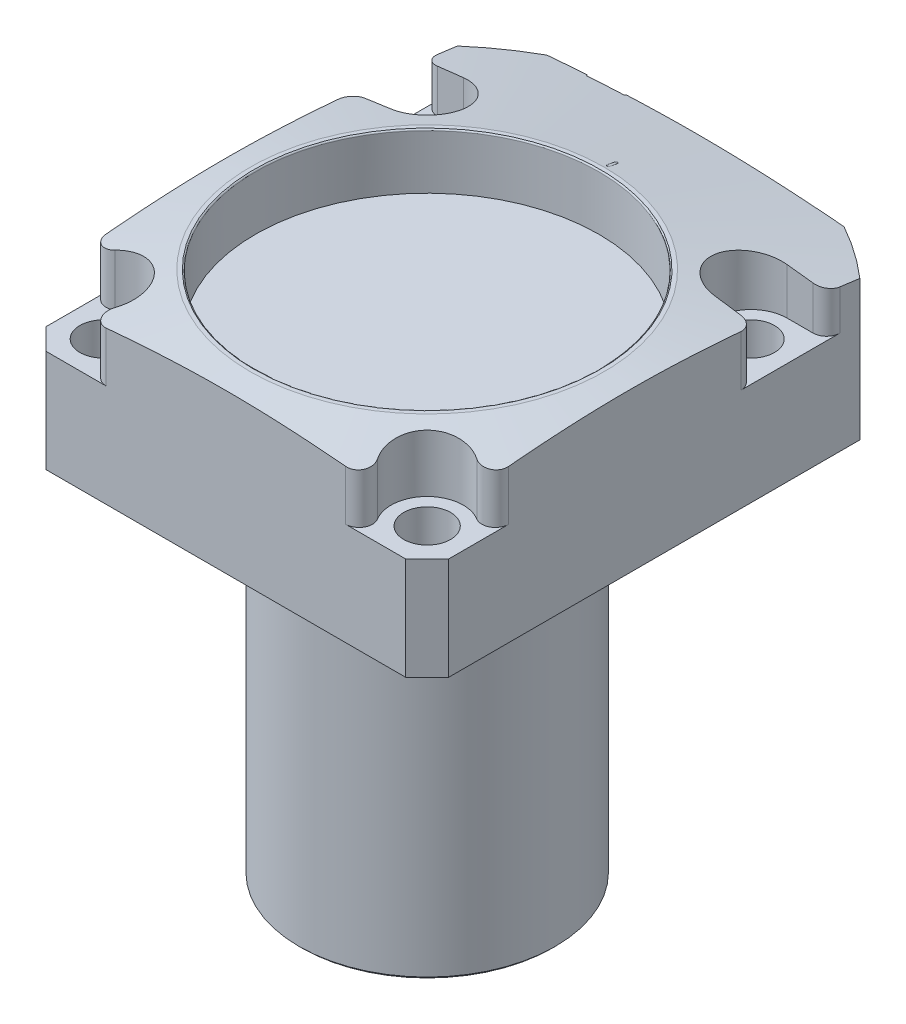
ISO-10303-21;
HEADER;
FILE_DESCRIPTION(('STEP AP214'),'2;1');
FILE_NAME('part.step','',(''),(''),'','','');
FILE_SCHEMA(('AUTOMOTIVE_DESIGN { 1 0 10303 214 1 1 1 1 }'));
ENDSEC;
DATA;
#1=APPLICATION_CONTEXT('core data for automotive mechanical design processes');
#2=APPLICATION_PROTOCOL_DEFINITION('international standard','automotive_design',2000,#1);
#3=PRODUCT_CONTEXT('',#1,'mechanical');
#4=PRODUCT('Part','Part','',(#3));
#5=PRODUCT_RELATED_PRODUCT_CATEGORY('part','',(#4));
#6=PRODUCT_DEFINITION_FORMATION('','',#4);
#7=PRODUCT_DEFINITION_CONTEXT('part definition',#1,'design');
#8=PRODUCT_DEFINITION('design','',#6,#7);
#9=PRODUCT_DEFINITION_SHAPE('','',#8);
#10=(LENGTH_UNIT() NAMED_UNIT(*) SI_UNIT(.MILLI.,.METRE.));
#11=(NAMED_UNIT(*) PLANE_ANGLE_UNIT() SI_UNIT($,.RADIAN.));
#12=(NAMED_UNIT(*) SI_UNIT($,.STERADIAN.) SOLID_ANGLE_UNIT());
#13=UNCERTAINTY_MEASURE_WITH_UNIT(LENGTH_MEASURE(1.E-05),#10,'distance_accuracy_value','');
#14=(GEOMETRIC_REPRESENTATION_CONTEXT(3) GLOBAL_UNCERTAINTY_ASSIGNED_CONTEXT((#13)) GLOBAL_UNIT_ASSIGNED_CONTEXT((#10,
#11,#12)) REPRESENTATION_CONTEXT('',''));
#15=CARTESIAN_POINT('',(0.,0.,0.));
#16=DIRECTION('',(0.,0.,1.));
#17=DIRECTION('',(1.,0.,0.));
#18=AXIS2_PLACEMENT_3D('',#15,#16,#17);
#19=CARTESIAN_POINT('',(0.,26.0693034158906,0.));
#20=DIRECTION('',(0.,-1.,0.));
#21=DIRECTION('',(0.,0.,-1.));
#22=AXIS2_PLACEMENT_3D('',#19,#20,#21);
#23=CONICAL_SURFACE('',#22,57.15,1.39626340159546);
#24=CARTESIAN_POINT('',(-0.10219128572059,30.1578063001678,-33.9627941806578));
#25=CARTESIAN_POINT('',(-0.115003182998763,30.1587991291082,-33.9571251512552));
#26=CARTESIAN_POINT('',(-0.127314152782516,30.1599824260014,-33.9503698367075));
#27=CARTESIAN_POINT('',(-0.150605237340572,30.1626879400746,-33.9349305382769));
#28=CARTESIAN_POINT('',(-0.161586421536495,30.1642098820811,-33.9262481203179));
#29=CARTESIAN_POINT('',(-0.181915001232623,30.1675531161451,-33.9071845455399));
#30=CARTESIAN_POINT('',(-0.191261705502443,30.1693745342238,-33.8968026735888));
#31=CARTESIAN_POINT('',(-0.208052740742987,30.173264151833,-33.874644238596));
#32=CARTESIAN_POINT('',(-0.215497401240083,30.1753323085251,-33.8628679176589));
#33=CARTESIAN_POINT('',(-0.228279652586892,30.1796586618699,-33.8382476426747));
#34=CARTESIAN_POINT('',(-0.233616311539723,30.1819169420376,-33.8254032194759));
#35=CARTESIAN_POINT('',(-0.242029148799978,30.1865595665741,-33.7990137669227));
#36=CARTESIAN_POINT('',(-0.245104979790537,30.188943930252,-33.785468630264));
#37=CARTESIAN_POINT('',(-0.248911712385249,30.1937749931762,-33.7580417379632));
#38=CARTESIAN_POINT('',(-0.249639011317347,30.1962217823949,-33.7441594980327));
#39=CARTESIAN_POINT('',(-0.248718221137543,30.2011047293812,-33.7164729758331));
#40=CARTESIAN_POINT('',(-0.247070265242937,30.2035408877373,-33.7026686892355));
#41=CARTESIAN_POINT('',(-0.241443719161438,30.2083349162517,-33.67552047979));
#42=CARTESIAN_POINT('',(-0.237463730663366,30.2106927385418,-33.6621768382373));
#43=CARTESIAN_POINT('',(-0.227283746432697,30.2152611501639,-33.6363377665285));
#44=CARTESIAN_POINT('',(-0.221083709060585,30.2174717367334,-33.6238423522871));
#45=CARTESIAN_POINT('',(-0.206643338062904,30.2216805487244,-33.6000643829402));
#46=CARTESIAN_POINT('',(-0.198404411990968,30.2236789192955,-33.58878099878));
#47=CARTESIAN_POINT('',(-0.180116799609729,30.2274071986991,-33.5677396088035));
#48=CARTESIAN_POINT('',(-0.170068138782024,30.2291371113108,-33.5579815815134));
#49=CARTESIAN_POINT('',(-0.148463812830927,30.2322755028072,-33.5402852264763));
#50=CARTESIAN_POINT('',(-0.136910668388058,30.2336845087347,-33.5323439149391));
#51=CARTESIAN_POINT('',(-0.112612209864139,30.2361435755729,-33.5184881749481));
#52=CARTESIAN_POINT('',(-0.0998669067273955,30.2371936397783,-33.5125737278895));
#53=CARTESIAN_POINT('',(-0.0735720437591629,30.2389023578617,-33.5029511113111));
#54=CARTESIAN_POINT('',(-0.0600240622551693,30.23956175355,-33.4992387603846));
#55=CARTESIAN_POINT('',(-0.0324870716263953,30.2404728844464,-33.4941094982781));
#56=CARTESIAN_POINT('',(-0.0184980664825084,30.2407246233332,-33.4926925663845));
#57=CARTESIAN_POINT('',(0.00950441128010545,30.2408129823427,-33.4921952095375));
#58=CARTESIAN_POINT('',(0.0235178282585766,30.2406501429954,-33.4931117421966));
#59=CARTESIAN_POINT('',(0.0511893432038,30.2399152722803,-33.4972485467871));
#60=CARTESIAN_POINT('',(0.0648474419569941,30.2393432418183,-33.5004688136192));
#61=CARTESIAN_POINT('',(0.0914193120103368,30.2378068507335,-33.5091201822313));
#62=CARTESIAN_POINT('',(0.104333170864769,30.2368425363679,-33.5145510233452));
#63=CARTESIAN_POINT('',(0.129052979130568,30.2345497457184,-33.5274681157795));
#64=CARTESIAN_POINT('',(0.140858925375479,30.2332212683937,-33.5349543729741));
#65=CARTESIAN_POINT('',(0.163042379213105,30.2302370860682,-33.5517782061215));
#66=CARTESIAN_POINT('',(0.173418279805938,30.2285810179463,-33.5611178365));
#67=CARTESIAN_POINT('',(0.192434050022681,30.2249905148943,-33.5813772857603));
#68=CARTESIAN_POINT('',(0.201073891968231,30.2230560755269,-33.592297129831));
#69=CARTESIAN_POINT('',(0.216389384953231,30.218960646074,-33.6154287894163));
#70=CARTESIAN_POINT('',(0.223061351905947,30.2167992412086,-33.6276429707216));
#71=CARTESIAN_POINT('',(0.234232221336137,30.212314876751,-33.6529997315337));
#72=CARTESIAN_POINT('',(0.238731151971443,30.2099919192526,-33.6661422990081));
#73=CARTESIAN_POINT('',(0.245436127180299,30.2052464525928,-33.6930076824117));
#74=CARTESIAN_POINT('',(0.247638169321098,30.2028237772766,-33.7067314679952));
#75=CARTESIAN_POINT('',(0.249673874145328,30.1979513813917,-33.7343499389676));
#76=CARTESIAN_POINT('',(0.249507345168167,30.1955016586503,-33.7482446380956));
#77=CARTESIAN_POINT('',(0.24680871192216,30.1906423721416,-33.7758235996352));
#78=CARTESIAN_POINT('',(0.244274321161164,30.1882328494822,-33.7895076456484));
#79=CARTESIAN_POINT('',(0.236908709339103,30.1835250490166,-33.8162600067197));
#80=CARTESIAN_POINT('',(0.232077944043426,30.1812267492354,-33.8293284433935));
#81=CARTESIAN_POINT('',(0.220257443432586,30.1768067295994,-33.8544751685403));
#82=CARTESIAN_POINT('',(0.213268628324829,30.1746849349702,-33.8665538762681));
#83=CARTESIAN_POINT('',(0.19732795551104,30.1706759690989,-33.8893868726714));
#84=CARTESIAN_POINT('',(0.188375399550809,30.1687888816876,-33.9001406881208));
#85=CARTESIAN_POINT('',(0.167675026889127,30.1651121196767,-33.9211018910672));
#86=CARTESIAN_POINT('',(0.15572819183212,30.1633559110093,-33.9311195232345));
#87=CARTESIAN_POINT('',(0.130128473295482,30.1602553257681,-33.9488119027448));
#88=CARTESIAN_POINT('',(0.116472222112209,30.1589117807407,-33.9564819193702));
#89=CARTESIAN_POINT('',(0.102191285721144,30.1578063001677,-33.9627941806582));
#90=B_SPLINE_CURVE_WITH_KNOTS('',3,(#24,#25,#26,#27,#28,#29,#30,#31,#32,#33,#34,#35,#36,#37,#38,
#39,#40,#41,#42,#43,#44,#45,#46,#47,#48,#49,#50,#51,#52,#53,#54,#55,#56,#57,#58,#59,#60,#61,#62,
#63,#64,#65,#66,#67,#68,#69,#70,#71,#72,#73,#74,#75,#76,#77,#78,#79,#80,#81,#82,#83,#84,#85,#86,
#87,#88,#89),.UNSPECIFIED.,.F.,.F.,(4,2,2,2,2,2,2,2,2,2,2,2,2,2,2,2,2,2,2,2,2,2,2,2,2,2,2,2,2,2,
2,2,4),(0.,0.0420788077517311,0.0841235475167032,0.126186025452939,0.168241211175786,
0.210314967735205,0.252395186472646,0.294539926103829,0.336682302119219,0.378849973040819,
0.421018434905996,0.463157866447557,0.505296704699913,0.547365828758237,0.589434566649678,
0.631423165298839,0.673411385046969,0.715344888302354,0.757278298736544,0.799206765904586,
0.84113535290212,0.883110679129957,0.925086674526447,0.967140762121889,1.00919430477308,
1.05132100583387,1.09345111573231,1.13562195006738,1.17778441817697,1.21992893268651,
1.2620884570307,1.30887867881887,1.35576257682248),.UNSPECIFIED.);
#91=CARTESIAN_POINT('',(-0.249312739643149,30.1972410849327,-33.7383809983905));
#92=VERTEX_POINT('',#91);
#93=CARTESIAN_POINT('',(0.249312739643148,30.1972410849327,-33.7383809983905));
#94=VERTEX_POINT('',#93);
#95=EDGE_CURVE('E13',#92,#94,#90,.T.);
#96=ORIENTED_EDGE('',*,*,#95,.F.);
#97=CARTESIAN_POINT('',(-0.249336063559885,29.8972645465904,-35.4396765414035));
#98=CARTESIAN_POINT('',(-0.24933235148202,29.9474698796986,-35.1549409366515));
#99=CARTESIAN_POINT('',(-0.249328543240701,29.9976751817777,-34.8702053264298));
#100=CARTESIAN_POINT('',(-0.249320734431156,30.0980857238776,-34.3007340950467));
#101=CARTESIAN_POINT('',(-0.249316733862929,30.1482909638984,-34.0159984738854));
#102=CARTESIAN_POINT('',(-0.24931263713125,30.19849617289,-33.7312628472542));
#103=B_SPLINE_CURVE_WITH_KNOTS('',3,(#97,#98,#99,#100,#101,#102),.UNSPECIFIED.,.F.,.F.,(4,2,4),
(0.,0.867383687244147,1.7347673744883),.UNSPECIFIED.);
#104=CARTESIAN_POINT('',(-0.249333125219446,29.936705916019,-35.2159878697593));
#105=VERTEX_POINT('',#104);
#106=EDGE_CURVE('E53',#105,#92,#103,.T.);
#107=ORIENTED_EDGE('',*,*,#106,.F.);
#108=CARTESIAN_POINT('',(0.249228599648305,29.9379613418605,-35.2088685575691));
#109=CARTESIAN_POINT('',(0.24964677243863,29.9355199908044,-35.2227112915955));
#110=CARTESIAN_POINT('',(0.248857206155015,29.9330747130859,-35.2365853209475));
#111=CARTESIAN_POINT('',(0.244937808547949,29.9282456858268,-35.264000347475));
#112=CARTESIAN_POINT('',(0.241809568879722,29.9258618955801,-35.277541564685));
#113=CARTESIAN_POINT('',(0.233286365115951,29.9212206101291,-35.3039215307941));
#114=CARTESIAN_POINT('',(0.227890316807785,29.91896317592,-35.3167599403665));
#115=CARTESIAN_POINT('',(0.214988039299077,29.9146398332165,-35.3413601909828));
#116=CARTESIAN_POINT('',(0.207482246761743,29.912573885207,-35.3531222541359));
#117=CARTESIAN_POINT('',(0.190570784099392,29.9086912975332,-35.375237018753));
#118=CARTESIAN_POINT('',(0.181165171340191,29.906874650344,-35.385589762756));
#119=CARTESIAN_POINT('',(0.160718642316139,29.9035415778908,-35.4045915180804));
#120=CARTESIAN_POINT('',(0.149677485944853,29.9020251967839,-35.413240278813));
#121=CARTESIAN_POINT('',(0.126295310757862,29.8993382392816,-35.4285699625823));
#122=CARTESIAN_POINT('',(0.113956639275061,29.8981670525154,-35.4352543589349));
#123=CARTESIAN_POINT('',(0.0883145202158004,29.8961999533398,-35.4464835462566));
#124=CARTESIAN_POINT('',(0.0750111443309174,29.8954040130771,-35.4510284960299));
#125=CARTESIAN_POINT('',(0.04784023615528,29.8942107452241,-35.4578429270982));
#126=CARTESIAN_POINT('',(0.0339736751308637,29.8938127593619,-35.4601161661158));
#127=CARTESIAN_POINT('',(0.00604962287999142,29.893424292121,-35.4623350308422));
#128=CARTESIAN_POINT('',(-0.00800787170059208,29.8934338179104,-35.4622806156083));
#129=CARTESIAN_POINT('',(-0.0359010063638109,29.8938599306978,-35.4598467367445));
#130=CARTESIAN_POINT('',(-0.0497368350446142,29.8942761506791,-35.4574693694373));
#131=CARTESIAN_POINT('',(-0.0768069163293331,29.8955033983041,-35.4504609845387));
#132=CARTESIAN_POINT('',(-0.0900411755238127,29.8963144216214,-35.4458299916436));
#133=CARTESIAN_POINT('',(-0.115537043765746,29.898308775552,-35.4344454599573));
#134=CARTESIAN_POINT('',(-0.127798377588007,29.8994922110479,-35.4276913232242));
#135=CARTESIAN_POINT('',(-0.150997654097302,29.902198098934,-35.4122540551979));
#136=CARTESIAN_POINT('',(-0.161935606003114,29.9037205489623,-35.4035709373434));
#137=CARTESIAN_POINT('',(-0.182192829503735,29.9070638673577,-35.3845113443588));
#138=CARTESIAN_POINT('',(-0.191510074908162,29.9088851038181,-35.3741327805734));
#139=CARTESIAN_POINT('',(-0.208248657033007,29.912774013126,-35.3519827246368));
#140=CARTESIAN_POINT('',(-0.21566966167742,29.9148417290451,-35.3402109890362));
#141=CARTESIAN_POINT('',(-0.228419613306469,29.9191697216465,-35.315585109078));
#142=CARTESIAN_POINT('',(-0.233743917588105,29.9214304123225,-35.3027286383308));
#143=CARTESIAN_POINT('',(-0.242124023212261,29.9260761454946,-35.2763242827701));
#144=CARTESIAN_POINT('',(-0.245181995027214,29.9284610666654,-35.2627770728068));
#145=CARTESIAN_POINT('',(-0.247984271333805,29.9320470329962,-35.2424198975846));
#146=CARTESIAN_POINT('',(-0.24862371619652,29.9332278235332,-35.2357186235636));
#147=CARTESIAN_POINT('',(-0.24934385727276,29.9355930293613,-35.2222994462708));
#148=CARTESIAN_POINT('',(-0.249425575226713,29.9367774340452,-35.215581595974));
#149=CARTESIAN_POINT('',(-0.249228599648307,29.9379613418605,-35.2088685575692));
#150=B_SPLINE_CURVE_WITH_KNOTS('',3,(#108,#109,#110,#111,#112,#113,#114,#115,#116,#117,#118,
#119,#120,#121,#122,#123,#124,#125,#126,#127,#128,#129,#130,#131,#132,#133,#134,#135,#136,#137,
#138,#139,#140,#141,#142,#143,#144,#145,#146,#147,#148,#149),.UNSPECIFIED.,.F.,.F.,(4,2,2,2,2,2,
2,2,2,2,2,2,2,2,2,2,2,2,2,2,4),(0.,0.0421320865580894,0.0842355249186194,0.126359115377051,
0.168473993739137,0.210587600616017,0.252707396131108,0.294752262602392,0.336794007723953,
0.37876609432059,0.420738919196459,0.462673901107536,0.504608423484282,0.546554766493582,
0.58850081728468,0.630498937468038,0.672504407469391,0.714602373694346,0.756659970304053,
0.777143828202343,0.797590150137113),.UNSPECIFIED.);
#151=CARTESIAN_POINT('',(0.249333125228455,29.9367059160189,-35.2159878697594));
#152=VERTEX_POINT('',#151);
#153=EDGE_CURVE('E288',#152,#105,#150,.T.);
#154=ORIENTED_EDGE('',*,*,#153,.F.);
#155=CARTESIAN_POINT('',(0.249277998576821,30.5943474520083,-31.4862132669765));
#156=CARTESIAN_POINT('',(0.249286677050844,30.5017378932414,-32.0114445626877));
#157=CARTESIAN_POINT('',(0.249294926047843,30.4091281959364,-32.5366758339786));
#158=CARTESIAN_POINT('',(0.249306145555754,30.2771776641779,-33.2850256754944));
#159=CARTESIAN_POINT('',(0.249309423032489,30.2378369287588,-33.5081442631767));
#160=CARTESIAN_POINT('',(0.249320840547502,30.0980857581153,-34.300734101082));
#161=CARTESIAN_POINT('',(0.249328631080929,29.9976752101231,-34.8702053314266));
#162=CARTESIAN_POINT('',(0.249342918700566,29.8046536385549,-35.9649120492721));
#163=CARTESIAN_POINT('',(0.249349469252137,29.7120426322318,-36.4901475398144));
#164=CARTESIAN_POINT('',(0.249355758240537,29.6194315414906,-37.0153830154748));
#165=B_SPLINE_CURVE_WITH_KNOTS('',3,(#155,#156,#157,#158,#159,#160,#161,#162,#163,#164),
.UNSPECIFIED.,.F.,.F.,(4,2,2,2,4),(0.,1.60000000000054,2.27968108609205,4.01444846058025,
5.6144616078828),.UNSPECIFIED.);
#166=EDGE_CURVE('E293',#94,#152,#165,.T.);
#167=ORIENTED_EDGE('',*,*,#166,.F.);
#168=EDGE_LOOP('',(#96,#107,#154,#167));
#169=FACE_BOUND('',#168,.T.);
#170=CARTESIAN_POINT('',(-13.0797404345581,27.0803103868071,-49.7248000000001));
#171=CARTESIAN_POINT('',(-13.0543765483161,27.0729461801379,-49.7746559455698));
#172=CARTESIAN_POINT('',(-13.029234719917,27.0655471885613,-49.8246172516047));
#173=CARTESIAN_POINT('',(-12.9793951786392,27.0506796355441,-49.9247505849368));
#174=CARTESIAN_POINT('',(-12.9546974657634,27.043211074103,-49.9749226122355));
#175=CARTESIAN_POINT('',(-12.9302218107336,27.0357077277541,-50.0252000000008));
#176=B_SPLINE_CURVE_WITH_KNOTS('',3,(#170,#171,#172,#173,#174,#175),.UNSPECIFIED.,.F.,.F.,(4,2,
4),(0.,0.169253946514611,0.338507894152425),.UNSPECIFIED.);
#177=CARTESIAN_POINT('',(-13.066940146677,27.0765866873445,-49.75));
#178=VERTEX_POINT('',#177);
#179=CARTESIAN_POINT('',(-12.9425156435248,27.039466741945,-50.));
#180=VERTEX_POINT('',#179);
#181=EDGE_CURVE('E67',#178,#180,#176,.T.);
#182=ORIENTED_EDGE('',*,*,#181,.F.);
#183=CARTESIAN_POINT('',(-39.0797864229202,24.9912980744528,-49.75));
#184=CARTESIAN_POINT('',(-38.1215465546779,25.0956678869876,-49.75));
#185=CARTESIAN_POINT('',(-37.1630525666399,25.1976993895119,-49.75));
#186=CARTESIAN_POINT('',(-35.245527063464,25.3966493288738,-49.75));
#187=CARTESIAN_POINT('',(-34.2864955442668,25.4935677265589,-49.75));
#188=CARTESIAN_POINT('',(-31.4084331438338,25.7760099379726,-49.75));
#189=CARTESIAN_POINT('',(-29.4885738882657,25.9532054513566,-49.75));
#190=CARTESIAN_POINT('',(-25.6489140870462,26.2813503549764,-49.75));
#191=CARTESIAN_POINT('',(-23.7291162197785,26.4323308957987,-49.75));
#192=CARTESIAN_POINT('',(-19.8874171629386,26.704284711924,-49.75));
#193=CARTESIAN_POINT('',(-17.9655160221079,26.8252586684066,-49.75));
#194=CARTESIAN_POINT('',(-14.1190365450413,27.0334081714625,-49.75));
#195=CARTESIAN_POINT('',(-12.1944574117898,27.1205691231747,-49.75));
#196=CARTESIAN_POINT('',(-8.34395059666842,27.2578101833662,-49.75));
#197=CARTESIAN_POINT('',(-6.41802291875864,27.3078904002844,-49.75));
#198=CARTESIAN_POINT('',(-3.52757368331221,27.353733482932,-49.75));
#199=CARTESIAN_POINT('',(-2.56326583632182,27.3641324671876,-49.75));
#200=CARTESIAN_POINT('',(-0.634589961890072,27.3750548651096,-49.75));
#201=CARTESIAN_POINT('',(0.329778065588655,27.3755782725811,-49.75));
#202=CARTESIAN_POINT('',(2.25851193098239,27.3667329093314,-49.75));
#203=CARTESIAN_POINT('',(3.22287776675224,27.3573636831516,-49.75));
#204=CARTESIAN_POINT('',(5.15146486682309,27.3288527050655,-49.75));
#205=CARTESIAN_POINT('',(6.1156861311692,27.3097109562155,-49.75));
#206=CARTESIAN_POINT('',(7.07978642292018,27.2857431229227,-49.75));
#207=B_SPLINE_CURVE_WITH_KNOTS('',3,(#183,#184,#185,#186,#187,#188,#189,#190,#191,#192,#193,
#194,#195,#196,#197,#198,#199,#200,#201,#202,#203,#204,#205,#206),.UNSPECIFIED.,.F.,.F.,(4,2,2,
2,2,2,2,2,2,2,2,4),(0.,2.89171570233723,5.78345354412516,11.5673501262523,17.3443261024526,
23.1211709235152,28.9005064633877,34.6798251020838,37.5728747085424,40.4659261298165,
43.3591107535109,46.2522944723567),.UNSPECIFIED.);
#208=CARTESIAN_POINT('',(-20.0289341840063,26.6899023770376,-49.75));
#209=VERTEX_POINT('',#208);
#210=EDGE_CURVE('E430',#209,#178,#207,.T.);
#211=ORIENTED_EDGE('',*,*,#210,.F.);
#212=CARTESIAN_POINT('',(-20.1545426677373,26.6366164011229,-50.0252000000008));
#213=CARTESIAN_POINT('',(-20.1320898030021,26.6463175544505,-49.9749306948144));
#214=CARTESIAN_POINT('',(-20.1094145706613,26.6560167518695,-49.9247627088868));
#215=CARTESIAN_POINT('',(-20.0636193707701,26.6754112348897,-49.8246293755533));
#216=CARTESIAN_POINT('',(-20.0404994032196,26.6851065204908,-49.7746640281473));
#217=CARTESIAN_POINT('',(-20.0171570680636,26.6947998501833,-49.7248000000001));
#218=B_SPLINE_CURVE_WITH_KNOTS('',3,(#212,#213,#214,#215,#216,#217),.UNSPECIFIED.,.F.,.F.,(4,2,
4),(0.,0.167706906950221,0.335413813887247),.UNSPECIFIED.);
#219=CARTESIAN_POINT('',(-20.1432613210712,26.641481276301,-50.));
#220=VERTEX_POINT('',#219);
#221=EDGE_CURVE('E871',#220,#209,#218,.T.);
#222=ORIENTED_EDGE('',*,*,#221,.F.);
#223=CARTESIAN_POINT('',(-85.2368907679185,18.7218159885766,-50.));
#224=CARTESIAN_POINT('',(-84.0454143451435,18.9030257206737,-50.));
#225=CARTESIAN_POINT('',(-82.8537943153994,19.0832907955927,-50.));
#226=CARTESIAN_POINT('',(-80.4702381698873,19.4417269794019,-50.));
#227=CARTESIAN_POINT('',(-79.2783020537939,19.6198980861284,-50.));
#228=CARTESIAN_POINT('',(-75.7019505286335,20.1509672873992,-50.));
#229=CARTESIAN_POINT('',(-73.317021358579,20.5004167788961,-50.));
#230=CARTESIAN_POINT('',(-68.545046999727,21.1881526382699,-50.));
#231=CARTESIAN_POINT('',(-66.1580014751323,21.526436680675,-50.));
#232=CARTESIAN_POINT('',(-61.3819894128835,22.189158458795,-50.));
#233=CARTESIAN_POINT('',(-58.9930228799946,22.5135962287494,-50.));
#234=CARTESIAN_POINT('',(-54.2198650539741,23.1443780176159,-50.));
#235=CARTESIAN_POINT('',(-51.8356804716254,23.4507726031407,-50.));
#236=CARTESIAN_POINT('',(-47.0646649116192,24.0423355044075,-50.));
#237=CARTESIAN_POINT('',(-44.6778339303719,24.3275037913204,-50.));
#238=CARTESIAN_POINT('',(-39.9009659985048,24.8714411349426,-50.));
#239=CARTESIAN_POINT('',(-37.5109288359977,25.1302083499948,-50.));
#240=CARTESIAN_POINT('',(-33.9233890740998,25.4937873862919,-50.));
#241=CARTESIAN_POINT('',(-32.7271294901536,25.610885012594,-50.));
#242=CARTESIAN_POINT('',(-30.3337334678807,25.8359950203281,-50.));
#243=CARTESIAN_POINT('',(-29.1365970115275,25.9440072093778,-50.));
#244=CARTESIAN_POINT('',(-25.5316695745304,26.2540685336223,-50.));
#245=CARTESIAN_POINT('',(-23.1225260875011,26.4408901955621,-50.));
#246=CARTESIAN_POINT('',(-19.5064127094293,26.684907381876,-50.));
#247=CARTESIAN_POINT('',(-18.3006465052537,26.7602103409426,-50.));
#248=CARTESIAN_POINT('',(-15.8883754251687,26.897812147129,-50.));
#249=CARTESIAN_POINT('',(-14.6818705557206,26.9601111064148,-50.));
#250=CARTESIAN_POINT('',(-12.2685943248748,27.0708394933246,-50.));
#251=CARTESIAN_POINT('',(-11.0618231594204,27.1192731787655,-50.));
#252=CARTESIAN_POINT('',(-8.64779194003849,27.2015847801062,-50.));
#253=CARTESIAN_POINT('',(-7.44053189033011,27.2354628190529,-50.));
#254=CARTESIAN_POINT('',(-5.02568383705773,27.2881362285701,-50.));
#255=CARTESIAN_POINT('',(-3.81809583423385,27.3069316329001,-50.));
#256=CARTESIAN_POINT('',(-1.4027753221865,27.3291362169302,-50.));
#257=CARTESIAN_POINT('',(-0.195042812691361,27.3325453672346,-50.));
#258=CARTESIAN_POINT('',(2.22236287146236,27.3239141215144,-50.));
#259=CARTESIAN_POINT('',(3.43203595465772,27.3118481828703,-50.));
#260=CARTESIAN_POINT('',(5.85113066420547,27.272420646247,-50.));
#261=CARTESIAN_POINT('',(7.0605522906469,27.2450590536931,-50.));
#262=CARTESIAN_POINT('',(9.47897521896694,27.1754743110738,-50.));
#263=CARTESIAN_POINT('',(10.6879765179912,27.1332510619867,-50.));
#264=CARTESIAN_POINT('',(13.1053913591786,27.0345874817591,-50.));
#265=CARTESIAN_POINT('',(14.3138049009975,26.9781471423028,-50.));
#266=CARTESIAN_POINT('',(17.9388404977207,26.7886296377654,-50.));
#267=CARTESIAN_POINT('',(20.354433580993,26.6353807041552,-50.));
#268=CARTESIAN_POINT('',(23.9751960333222,26.3708109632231,-50.));
#269=CARTESIAN_POINT('',(25.1816846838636,26.2768378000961,-50.));
#270=CARTESIAN_POINT('',(27.5937968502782,26.0783186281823,-50.));
#271=CARTESIAN_POINT('',(28.7994203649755,25.9737726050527,-50.));
#272=CARTESIAN_POINT('',(32.8291175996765,25.6081747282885,-50.));
#273=CARTESIAN_POINT('',(35.6512447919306,25.3255768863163,-50.));
#274=CARTESIAN_POINT('',(41.2910817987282,24.7191533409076,-50.));
#275=CARTESIAN_POINT('',(44.1087914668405,24.3953262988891,-50.));
#276=CARTESIAN_POINT('',(49.7406720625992,23.7157523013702,-50.));
#277=CARTESIAN_POINT('',(52.5548425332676,23.3600015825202,-50.));
#278=CARTESIAN_POINT('',(58.1799090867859,22.6238805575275,-50.));
#279=CARTESIAN_POINT('',(60.9908052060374,22.2435105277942,-50.));
#280=CARTESIAN_POINT('',(66.6111105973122,21.4634911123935,-50.));
#281=CARTESIAN_POINT('',(69.4205187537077,21.0638337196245,-50.));
#282=CARTESIAN_POINT('',(75.0371617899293,20.249535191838,-50.));
#283=CARTESIAN_POINT('',(77.8443966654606,19.8348940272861,-50.));
#284=CARTESIAN_POINT('',(83.4568882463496,18.9937829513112,-50.));
#285=CARTESIAN_POINT('',(86.2621450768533,18.5673138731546,-50.));
#286=CARTESIAN_POINT('',(91.8711948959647,17.7048869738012,-50.));
#287=CARTESIAN_POINT('',(94.6749878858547,17.26892916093,-50.));
#288=CARTESIAN_POINT('',(100.269253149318,16.3912349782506,-50.));
#289=CARTESIAN_POINT('',(103.05973062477,15.949531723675,-50.));
#290=CARTESIAN_POINT('',(108.63969131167,15.0598927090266,-50.));
#291=CARTESIAN_POINT('',(111.429174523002,14.6119569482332,-50.));
#292=CARTESIAN_POINT('',(117.007364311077,13.7109228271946,-50.));
#293=CARTESIAN_POINT('',(119.796070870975,13.2578243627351,-50.));
#294=CARTESIAN_POINT('',(125.372781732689,12.3473255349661,-50.));
#295=CARTESIAN_POINT('',(128.160786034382,11.8899251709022,-50.));
#296=CARTESIAN_POINT('',(133.732915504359,10.9720431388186,-50.));
#297=CARTESIAN_POINT('',(136.517041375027,10.5115657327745,-50.));
#298=CARTESIAN_POINT('',(142.084783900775,9.58754199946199,-50.));
#299=CARTESIAN_POINT('',(144.868400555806,9.12399567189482,-50.));
#300=CARTESIAN_POINT('',(150.435120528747,8.19429389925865,-50.));
#301=CARTESIAN_POINT('',(153.21822385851,7.72813852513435,-50.));
#302=CARTESIAN_POINT('',(158.784048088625,6.79355692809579,-50.));
#303=CARTESIAN_POINT('',(161.566768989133,6.32513070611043,-50.));
#304=CARTESIAN_POINT('',(164.349327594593,5.85574422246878,-50.));
#305=B_SPLINE_CURVE_WITH_KNOTS('',3,(#223,#224,#225,#226,#227,#228,#229,#230,#231,#232,#233,
#234,#235,#236,#237,#238,#239,#240,#241,#242,#243,#244,#245,#246,#247,#248,#249,#250,#251,#252,
#253,#254,#255,#256,#257,#258,#259,#260,#261,#262,#263,#264,#265,#266,#267,#268,#269,#270,#271,
#272,#273,#274,#275,#276,#277,#278,#279,#280,#281,#282,#283,#284,#285,#286,#287,#288,#289,#290,
#291,#292,#293,#294,#295,#296,#297,#298,#299,#300,#301,#302,#303,#304),.UNSPECIFIED.,.F.,.F.,(4,
2,2,2,2,2,2,2,2,2,2,2,2,2,2,2,2,2,2,2,2,2,2,2,2,2,2,2,2,2,2,2,2,2,2,2,2,2,2,2,4),(0.,
3.61553207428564,7.23106788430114,14.4622287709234,21.6948863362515,28.9275260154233,
36.1388233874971,43.3501305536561,50.5619404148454,54.1678392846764,57.7738144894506,
65.0224506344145,68.6467410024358,72.2710001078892,75.8941450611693,79.5172593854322,
83.1403656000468,86.7634787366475,90.3925797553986,94.0216794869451,97.6508033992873,
101.279929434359,108.54065387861,112.17105041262,115.801451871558,124.309730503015,
132.818285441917,141.327844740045,149.837308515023,158.350335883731,166.863380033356,
175.37582596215,183.888264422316,192.363915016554,200.839566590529,209.315389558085,
217.791214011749,226.257059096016,234.722905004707,243.188521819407,251.654135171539),.UNSPECIFIED.);
#306=CARTESIAN_POINT('',(-27.6789179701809,26.0693034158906,-50.));
#307=VERTEX_POINT('',#306);
#308=EDGE_CURVE('E676',#220,#307,#305,.F.);
#309=ORIENTED_EDGE('',*,*,#308,.T.);
#310=CARTESIAN_POINT('',(0.,26.0693034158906,0.));
#311=DIRECTION('',(0.,-1.,0.));
#312=DIRECTION('',(0.,0.,-1.));
#313=AXIS2_PLACEMENT_3D('',#310,#311,#312);
#314=CIRCLE('',#313,57.15);
#315=CARTESIAN_POINT('',(-37.5,26.0693034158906,-43.1262391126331));
#316=VERTEX_POINT('',#315);
#317=EDGE_CURVE('E648',#316,#307,#314,.T.);
#318=ORIENTED_EDGE('',*,*,#317,.F.);
#319=CARTESIAN_POINT('',(-37.5,18.5160654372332,-92.687962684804));
#320=CARTESIAN_POINT('',(-37.5,18.8820838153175,-90.4484674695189));
#321=CARTESIAN_POINT('',(-37.5,19.2463601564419,-88.2086855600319));
#322=CARTESIAN_POINT('',(-37.5,19.9704864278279,-83.7283984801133));
#323=CARTESIAN_POINT('',(-37.5,20.3303363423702,-81.4878933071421));
#324=CARTESIAN_POINT('',(-37.5,21.0445750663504,-77.0065888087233));
#325=CARTESIAN_POINT('',(-37.5,21.3989652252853,-74.7657896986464));
#326=CARTESIAN_POINT('',(-37.5,22.1010751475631,-70.2831467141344));
#327=CARTESIAN_POINT('',(-37.5,22.4487949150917,-68.0413028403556));
#328=CARTESIAN_POINT('',(-37.5,23.135619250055,-63.5579562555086));
#329=CARTESIAN_POINT('',(-37.5,23.4747298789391,-61.3164544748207));
#330=CARTESIAN_POINT('',(-37.5,24.1423354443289,-56.8318649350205));
#331=CARTESIAN_POINT('',(-37.5,24.4708303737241,-54.5887771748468));
#332=CARTESIAN_POINT('',(-37.5,25.1142650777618,-50.0999127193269));
#333=CARTESIAN_POINT('',(-37.5,25.4292004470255,-47.8541353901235));
#334=CARTESIAN_POINT('',(-37.5,26.0412792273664,-43.3601418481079));
#335=CARTESIAN_POINT('',(-37.5,26.3384226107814,-41.1119256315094));
#336=CARTESIAN_POINT('',(-37.5,26.9106853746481,-36.6019060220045));
#337=CARTESIAN_POINT('',(-37.5,27.1856944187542,-34.3400885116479));
#338=CARTESIAN_POINT('',(-37.5,27.7045883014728,-29.8128422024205));
#339=CARTESIAN_POINT('',(-37.5,27.9484729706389,-27.5474133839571));
#340=CARTESIAN_POINT('',(-37.5,28.395307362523,-23.0137706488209));
#341=CARTESIAN_POINT('',(-37.5,28.5982810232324,-20.7455591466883));
#342=CARTESIAN_POINT('',(-37.5,28.8636447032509,-17.340193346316));
#343=CARTESIAN_POINT('',(-37.5,28.9455836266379,-16.204554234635));
#344=CARTESIAN_POINT('',(-37.5,29.0949677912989,-13.9323284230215));
#345=CARTESIAN_POINT('',(-37.5,29.1624132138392,-12.7957417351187));
#346=CARTESIAN_POINT('',(-37.5,29.2815400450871,-10.5200552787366));
#347=CARTESIAN_POINT('',(-37.5,29.3331980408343,-9.38095427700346));
#348=CARTESIAN_POINT('',(-37.5,29.4194487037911,-7.10210221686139));
#349=CARTESIAN_POINT('',(-37.5,29.4540413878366,-5.96235115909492));
#350=CARTESIAN_POINT('',(-37.5,29.5053148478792,-3.68247263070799));
#351=CARTESIAN_POINT('',(-37.5,29.5219960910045,-2.5423451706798));
#352=CARTESIAN_POINT('',(-37.5,29.5370198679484,-0.26196876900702));
#353=CARTESIAN_POINT('',(-37.5,29.5353624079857,0.87828017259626));
#354=CARTESIAN_POINT('',(-37.5,29.5137476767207,3.15905463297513));
#355=CARTESIAN_POINT('',(-37.5,29.4937831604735,4.29958008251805));
#356=CARTESIAN_POINT('',(-37.5,29.436053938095,6.58017834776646));
#357=CARTESIAN_POINT('',(-37.5,29.3982892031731,7.72025116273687));
#358=CARTESIAN_POINT('',(-37.5,29.3058724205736,9.99971033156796));
#359=CARTESIAN_POINT('',(-37.5,29.2512203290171,11.1390966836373));
#360=CARTESIAN_POINT('',(-37.5,29.1262424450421,13.4169972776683));
#361=CARTESIAN_POINT('',(-37.5,29.0559167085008,14.5555115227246));
#362=CARTESIAN_POINT('',(-37.5,28.8665597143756,17.3372639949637));
#363=CARTESIAN_POINT('',(-37.5,28.7397718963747,18.9799751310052));
#364=CARTESIAN_POINT('',(-37.5,28.4608166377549,22.2632465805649));
#365=CARTESIAN_POINT('',(-37.5,28.3086486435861,23.9038068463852));
#366=CARTESIAN_POINT('',(-37.5,27.9831374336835,27.1830187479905));
#367=CARTESIAN_POINT('',(-37.5,27.8097915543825,28.8216701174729));
#368=CARTESIAN_POINT('',(-37.5,27.4456731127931,32.0970088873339));
#369=CARTESIAN_POINT('',(-37.5,27.2549006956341,33.7336963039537));
#370=CARTESIAN_POINT('',(-37.5,26.8589865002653,37.0061155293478));
#371=CARTESIAN_POINT('',(-37.5,26.6538379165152,38.6418465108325));
#372=CARTESIAN_POINT('',(-37.5,26.2318460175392,41.9117960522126));
#373=CARTESIAN_POINT('',(-37.5,26.0150026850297,43.5460146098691));
#374=CARTESIAN_POINT('',(-37.5,25.5717345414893,46.8130459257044));
#375=CARTESIAN_POINT('',(-37.5,25.3453103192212,48.4458587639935));
#376=CARTESIAN_POINT('',(-37.5,24.8845545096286,51.7103646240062));
#377=CARTESIAN_POINT('',(-37.5,24.6502229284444,53.3420576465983));
#378=CARTESIAN_POINT('',(-37.5,24.1745232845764,56.607792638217));
#379=CARTESIAN_POINT('',(-37.5,23.9331419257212,58.2418326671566));
#380=CARTESIAN_POINT('',(-37.5,23.4448898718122,61.5090913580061));
#381=CARTESIAN_POINT('',(-37.5,23.1980191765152,63.1423100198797));
#382=CARTESIAN_POINT('',(-37.5,22.6996677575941,66.4080596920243));
#383=CARTESIAN_POINT('',(-37.5,22.4481869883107,68.0405906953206));
#384=CARTESIAN_POINT('',(-37.5,21.9413257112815,71.3050475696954));
#385=CARTESIAN_POINT('',(-37.5,21.6859452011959,72.9369734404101));
#386=CARTESIAN_POINT('',(-37.5,20.9150011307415,77.8310378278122));
#387=CARTESIAN_POINT('',(-37.5,20.3944917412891,81.0923973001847));
#388=CARTESIAN_POINT('',(-37.5,19.3437761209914,87.6135370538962));
#389=CARTESIAN_POINT('',(-37.5,18.8135699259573,90.8733173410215));
#390=CARTESIAN_POINT('',(-37.5,17.7437518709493,97.4042709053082));
#391=CARTESIAN_POINT('',(-37.5,17.2041115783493,100.675439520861));
#392=CARTESIAN_POINT('',(-37.5,16.1191310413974,107.216833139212));
#393=CARTESIAN_POINT('',(-37.5,15.5737907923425,110.487058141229));
#394=CARTESIAN_POINT('',(-37.5,14.4785854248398,117.02705207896));
#395=CARTESIAN_POINT('',(-37.5,13.9287199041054,120.296820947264));
#396=CARTESIAN_POINT('',(-37.5,12.8254167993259,126.835756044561));
#397=CARTESIAN_POINT('',(-37.5,12.2719792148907,130.104922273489));
#398=CARTESIAN_POINT('',(-37.5,11.1642429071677,136.630799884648));
#399=CARTESIAN_POINT('',(-37.5,10.6099547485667,139.887513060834));
#400=CARTESIAN_POINT('',(-37.5,9.49902123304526,146.400537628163));
#401=CARTESIAN_POINT('',(-37.5,8.94237587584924,149.656849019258));
#402=CARTESIAN_POINT('',(-37.5,7.82718471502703,156.168828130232));
#403=CARTESIAN_POINT('',(-37.5,7.26863909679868,159.424495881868));
#404=CARTESIAN_POINT('',(-37.5,6.14989688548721,165.9355468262));
#405=CARTESIAN_POINT('',(-37.5,5.58970029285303,169.190930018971));
#406=CARTESIAN_POINT('',(-37.5,5.02882907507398,172.446196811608));
#407=B_SPLINE_CURVE_WITH_KNOTS('',3,(#319,#320,#321,#322,#323,#324,#325,#326,#327,#328,#329,
#330,#331,#332,#333,#334,#335,#336,#337,#338,#339,#340,#341,#342,#343,#344,#345,#346,#347,#348,
#349,#350,#351,#352,#353,#354,#355,#356,#357,#358,#359,#360,#361,#362,#363,#364,#365,#366,#367,
#368,#369,#370,#371,#372,#373,#374,#375,#376,#377,#378,#379,#380,#381,#382,#383,#384,#385,#386,
#387,#388,#389,#390,#391,#392,#393,#394,#395,#396,#397,#398,#399,#400,#401,#402,#403,#404,#405,
#406),.UNSPECIFIED.,.F.,.F.,(4,2,2,2,2,2,2,2,2,2,2,2,2,2,2,2,2,2,2,2,2,2,2,2,2,2,2,2,2,2,2,2,2,
2,2,2,2,2,2,2,2,2,2,4),(0.,6.80762843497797,13.6152810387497,20.4212230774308,27.2271608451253,
34.0281658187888,40.8291753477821,47.6323780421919,54.4355913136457,61.2708508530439,
68.1061476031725,74.9374331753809,78.3531305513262,81.7687852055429,85.1894810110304,
88.6101734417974,92.0307766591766,95.451378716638,98.8733350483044,102.295296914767,
105.717267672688,109.139226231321,114.081766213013,119.024414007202,123.9676840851,
128.910912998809,133.856498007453,138.802090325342,143.747379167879,148.69266417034,
153.647970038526,158.603276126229,163.558631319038,168.513989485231,178.421870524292,
188.329714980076,198.275853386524,208.222000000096,218.169040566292,228.116082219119,
238.026719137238,247.937357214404,257.847054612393,267.756749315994),.UNSPECIFIED.);
#408=CARTESIAN_POINT('',(-37.5,26.5546262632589,-39.4061999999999));
#409=VERTEX_POINT('',#408);
#410=EDGE_CURVE('E649',#316,#409,#407,.T.);
#411=ORIENTED_EDGE('',*,*,#410,.T.);
#412=CARTESIAN_POINT('',(-37.5,26.5546262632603,-39.4062000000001));
#413=CARTESIAN_POINT('',(-37.5000067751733,26.5637123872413,-39.3350597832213));
#414=CARTESIAN_POINT('',(-37.4969635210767,26.5731511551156,-39.2639699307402));
#415=CARTESIAN_POINT('',(-37.4848533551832,26.5926656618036,-39.1224011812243));
#416=CARTESIAN_POINT('',(-37.4757871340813,26.6027413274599,-39.0519222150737));
#417=CARTESIAN_POINT('',(-37.4517209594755,26.6234517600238,-38.9121476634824));
#418=CARTESIAN_POINT('',(-37.4367276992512,26.6340858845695,-38.8428508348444));
#419=CARTESIAN_POINT('',(-37.400948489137,26.6558471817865,-38.7058683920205));
#420=CARTESIAN_POINT('',(-37.3801625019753,26.6669743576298,-38.6381827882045));
#421=CARTESIAN_POINT('',(-37.3093269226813,26.7009897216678,-38.4382332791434));
#422=CARTESIAN_POINT('',(-37.2507818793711,26.7245269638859,-38.3089739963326));
#423=CARTESIAN_POINT('',(-37.1128670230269,26.772640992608,-38.0624081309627));
#424=CARTESIAN_POINT('',(-37.0334978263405,26.7972177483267,-37.9451011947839));
#425=CARTESIAN_POINT('',(-36.8554611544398,26.8469566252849,-37.7246885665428));
#426=CARTESIAN_POINT('',(-36.7566448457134,26.8721218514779,-37.6217035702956));
#427=CARTESIAN_POINT('',(-36.5428860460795,26.9221405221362,-37.4339563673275));
#428=CARTESIAN_POINT('',(-36.4279394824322,26.9469938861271,-37.3491987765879));
#429=CARTESIAN_POINT('',(-36.1847564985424,26.9957426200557,-37.2001248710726));
#430=CARTESIAN_POINT('',(-36.0564769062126,27.0196345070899,-37.1358778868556));
#431=CARTESIAN_POINT('',(-35.7906006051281,27.0656374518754,-37.030200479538));
#432=CARTESIAN_POINT('',(-35.6530119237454,27.0877500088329,-36.9887506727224));
#433=CARTESIAN_POINT('',(-35.4286207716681,27.1211444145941,-36.941711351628));
#434=CARTESIAN_POINT('',(-35.3434802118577,27.1332249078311,-36.9284114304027));
#435=CARTESIAN_POINT('',(-35.1722643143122,27.1563392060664,-36.9106589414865));
#436=CARTESIAN_POINT('',(-35.0861904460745,27.16737444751,-36.9061940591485));
#437=CARTESIAN_POINT('',(-35.,27.1778315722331,-36.9062000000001));
#438=B_SPLINE_CURVE_WITH_KNOTS('',3,(#412,#413,#414,#415,#416,#417,#418,#419,#420,#421,#422,
#423,#424,#425,#426,#427,#428,#429,#430,#431,#432,#433,#434,#435,#436,#437),.UNSPECIFIED.,.F.,
.F.,(4,2,2,2,2,2,2,2,2,2,2,2,4),(0.,0.215080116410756,0.430135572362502,0.644948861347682,
0.859763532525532,1.2890808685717,1.71838549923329,2.15111330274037,2.58395056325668,
3.01823579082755,3.45215118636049,3.71277745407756,3.97304019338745),.UNSPECIFIED.);
#439=CARTESIAN_POINT('',(-35.,27.1778315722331,-36.9062000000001));
#440=VERTEX_POINT('',#439);
#441=EDGE_CURVE('E480',#409,#440,#438,.T.);
#442=ORIENTED_EDGE('',*,*,#441,.T.);
#443=CARTESIAN_POINT('',(-20.036788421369,28.741621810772,-36.9062000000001));
#444=CARTESIAN_POINT('',(-21.4173840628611,28.6254309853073,-36.9062000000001));
#445=CARTESIAN_POINT('',(-22.7971797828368,28.5001115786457,-36.9062000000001));
#446=CARTESIAN_POINT('',(-25.5551909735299,28.2336517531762,-36.9062000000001));
#447=CARTESIAN_POINT('',(-26.9334065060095,28.0925119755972,-36.9062000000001));
#448=CARTESIAN_POINT('',(-29.6881033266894,27.7968683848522,-36.9062000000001));
#449=CARTESIAN_POINT('',(-31.0645849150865,27.6423673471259,-36.9062000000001));
#450=CARTESIAN_POINT('',(-33.8162414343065,27.3220440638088,-36.9062000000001));
#451=CARTESIAN_POINT('',(-35.1914163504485,27.1562216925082,-36.9062000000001));
#452=CARTESIAN_POINT('',(-37.9403927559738,26.8150640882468,-36.9062000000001));
#453=CARTESIAN_POINT('',(-39.3141944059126,26.6397301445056,-36.9062000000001));
#454=CARTESIAN_POINT('',(-42.0607426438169,26.2810212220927,-36.9062000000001));
#455=CARTESIAN_POINT('',(-43.4334892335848,26.0976462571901,-36.9062000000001));
#456=CARTESIAN_POINT('',(-46.1783494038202,25.7240716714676,-36.9062000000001));
#457=CARTESIAN_POINT('',(-47.5504627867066,25.5338706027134,-36.9062000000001));
#458=CARTESIAN_POINT('',(-50.2938649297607,25.1476788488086,-36.9062000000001));
#459=CARTESIAN_POINT('',(-51.6651536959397,24.9516882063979,-36.9062000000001));
#460=CARTESIAN_POINT('',(-53.0360910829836,24.7533004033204,-36.9062000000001));
#461=B_SPLINE_CURVE_WITH_KNOTS('',3,(#443,#444,#445,#446,#447,#448,#449,#450,#451,#452,#453,
#454,#455,#456,#457,#458,#459,#460),.UNSPECIFIED.,.F.,.F.,(4,2,2,2,2,2,2,2,4),(0.,
4.15635304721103,8.31253769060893,12.4678610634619,16.6232305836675,20.7780382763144,
24.9328388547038,29.088526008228,33.2441824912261),.UNSPECIFIED.);
#462=CARTESIAN_POINT('',(-30.1751999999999,27.740547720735,-36.9062000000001));
#463=VERTEX_POINT('',#462);
#464=EDGE_CURVE('E1462',#463,#440,#461,.T.);
#465=ORIENTED_EDGE('',*,*,#464,.F.);
#466=CARTESIAN_POINT('',(-30.1753999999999,29.4085184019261,-23.4442000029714));
#467=CARTESIAN_POINT('',(-29.9884638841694,29.4345500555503,-23.4441752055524));
#468=CARTESIAN_POINT('',(-29.8013953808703,29.459663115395,-23.4519757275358));
#469=CARTESIAN_POINT('',(-29.4282832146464,29.5078117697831,-23.4831558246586));
#470=CARTESIAN_POINT('',(-29.2422396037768,29.530847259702,-23.5065361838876));
#471=CARTESIAN_POINT('',(-28.8724918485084,29.574597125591,-23.5688033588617));
#472=CARTESIAN_POINT('',(-28.688787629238,29.5953115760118,-23.6076896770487));
#473=CARTESIAN_POINT('',(-28.3250248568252,29.6341938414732,-23.7007538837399));
#474=CARTESIAN_POINT('',(-28.1449661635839,29.6523617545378,-23.754931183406));
#475=CARTESIAN_POINT('',(-27.7896427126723,29.6859578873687,-23.8783058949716));
#476=CARTESIAN_POINT('',(-27.6143818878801,29.7013839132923,-23.9475152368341));
#477=CARTESIAN_POINT('',(-27.2700213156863,29.7293003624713,-24.1005141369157));
#478=CARTESIAN_POINT('',(-27.1009238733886,29.7417896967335,-24.1843090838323));
#479=CARTESIAN_POINT('',(-26.7703473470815,29.7636626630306,-24.3658225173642));
#480=CARTESIAN_POINT('',(-26.6088620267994,29.7730488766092,-24.4635293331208));
#481=CARTESIAN_POINT('',(-26.2945021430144,29.7886143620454,-24.6722774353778));
#482=CARTESIAN_POINT('',(-26.1416307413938,29.7947924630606,-24.7833235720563));
#483=CARTESIAN_POINT('',(-25.8475729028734,29.8037998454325,-25.0164439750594));
#484=CARTESIAN_POINT('',(-25.706263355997,29.8066704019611,-25.1383613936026));
#485=CARTESIAN_POINT('',(-25.4342377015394,29.8091661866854,-25.3935252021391));
#486=CARTESIAN_POINT('',(-25.3035216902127,29.8087913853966,-25.5267716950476));
#487=CARTESIAN_POINT('',(-25.0536078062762,29.8048008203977,-25.8036511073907));
#488=CARTESIAN_POINT('',(-24.9344116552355,29.8011845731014,-25.9472855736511));
#489=CARTESIAN_POINT('',(-24.7084027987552,29.7907561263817,-26.2438831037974));
#490=CARTESIAN_POINT('',(-24.6015903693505,29.7839438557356,-26.3968463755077));
#491=CARTESIAN_POINT('',(-24.4017482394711,29.7672631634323,-26.7099603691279));
#492=CARTESIAN_POINT('',(-24.308633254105,29.7574149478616,-26.8700577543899));
#493=CARTESIAN_POINT('',(-24.1359518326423,29.7347634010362,-27.1972685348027));
#494=CARTESIAN_POINT('',(-24.0563900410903,29.721959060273,-27.3643843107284));
#495=CARTESIAN_POINT('',(-23.9113945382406,29.6935536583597,-27.7043228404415));
#496=CARTESIAN_POINT('',(-23.8459550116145,29.6779537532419,-27.8771432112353));
#497=CARTESIAN_POINT('',(-23.7295394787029,29.6441247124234,-28.227407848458));
#498=CARTESIAN_POINT('',(-23.6785688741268,29.6258945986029,-28.404853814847));
#499=CARTESIAN_POINT('',(-23.5910069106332,29.5868275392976,-28.7647467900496));
#500=CARTESIAN_POINT('',(-23.5545538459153,29.5659679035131,-28.9472249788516));
#501=CARTESIAN_POINT('',(-23.4968858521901,29.5219918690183,-29.3143718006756));
#502=CARTESIAN_POINT('',(-23.4756765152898,29.4988746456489,-29.4990412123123));
#503=CARTESIAN_POINT('',(-23.4485980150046,29.4506271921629,-29.8692188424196));
#504=CARTESIAN_POINT('',(-23.4427272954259,29.4254971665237,-30.0547269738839));
#505=CARTESIAN_POINT('',(-23.4462973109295,29.3734640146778,-30.4253515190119));
#506=CARTESIAN_POINT('',(-23.4557386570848,29.3465608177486,-30.6104679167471));
#507=CARTESIAN_POINT('',(-23.4901275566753,29.2907160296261,-30.982481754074));
#508=CARTESIAN_POINT('',(-23.5153590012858,29.2617459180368,-31.1693487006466));
#509=CARTESIAN_POINT('',(-23.5813509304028,29.2024842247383,-31.5401069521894));
#510=CARTESIAN_POINT('',(-23.6221115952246,29.1721926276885,-31.7239982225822));
#511=CARTESIAN_POINT('',(-23.7188391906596,29.1105448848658,-32.0875685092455));
#512=CARTESIAN_POINT('',(-23.7748072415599,29.0791886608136,-32.2672472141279));
#513=CARTESIAN_POINT('',(-23.901528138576,29.0156688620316,-32.62116226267));
#514=CARTESIAN_POINT('',(-23.9722808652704,28.9835052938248,-32.7953986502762));
#515=CARTESIAN_POINT('',(-24.129344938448,28.9180852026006,-33.1400693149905));
#516=CARTESIAN_POINT('',(-24.215892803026,28.8848194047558,-33.3103940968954));
#517=CARTESIAN_POINT('',(-24.4030817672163,28.8179746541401,-33.6429674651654));
#518=CARTESIAN_POINT('',(-24.5037179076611,28.7843958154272,-33.8052188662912));
#519=CARTESIAN_POINT('',(-24.7184337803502,28.7171447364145,-34.120637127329));
#520=CARTESIAN_POINT('',(-24.8325183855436,28.6834724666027,-34.2738006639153));
#521=CARTESIAN_POINT('',(-25.0732587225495,28.6162936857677,-34.5698494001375));
#522=CARTESIAN_POINT('',(-25.1999098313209,28.5827871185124,-34.7127383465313));
#523=CARTESIAN_POINT('',(-25.4658722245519,28.515916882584,-34.9882563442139));
#524=CARTESIAN_POINT('',(-25.6052663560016,28.4825558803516,-35.1208060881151));
#525=CARTESIAN_POINT('',(-25.894912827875,28.4164481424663,-35.37351009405));
#526=CARTESIAN_POINT('',(-26.0451611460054,28.3837011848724,-35.4936689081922));
#527=CARTESIAN_POINT('',(-26.3556106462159,28.3189950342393,-35.7208396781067));
#528=CARTESIAN_POINT('',(-26.5158185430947,28.287036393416,-35.827842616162));
#529=CARTESIAN_POINT('',(-26.8448991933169,28.2241402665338,-36.0277642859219));
#530=CARTESIAN_POINT('',(-27.0137686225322,28.1932023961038,-36.1206883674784));
#531=CARTESIAN_POINT('',(-27.3586018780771,28.1325973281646,-36.2915774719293));
#532=CARTESIAN_POINT('',(-27.5345472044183,28.1029271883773,-36.36957877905));
#533=CARTESIAN_POINT('',(-27.8925987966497,28.0449634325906,-36.5102671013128));
#534=CARTESIAN_POINT('',(-28.0747026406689,28.0166692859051,-36.5729600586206));
#535=CARTESIAN_POINT('',(-28.4436173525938,27.961640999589,-36.6825012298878));
#536=CARTESIAN_POINT('',(-28.6304227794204,27.934905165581,-36.7293669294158));
#537=CARTESIAN_POINT('',(-29.0075113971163,27.8831229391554,-36.8069336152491));
#538=CARTESIAN_POINT('',(-29.1977928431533,27.8580757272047,-36.8376424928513));
#539=CARTESIAN_POINT('',(-29.519584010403,27.8174859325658,-36.875482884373));
#540=CARTESIAN_POINT('',(-29.6505319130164,27.8014547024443,-36.8870071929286));
#541=CARTESIAN_POINT('',(-29.9127648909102,27.7703048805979,-36.9023627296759));
#542=CARTESIAN_POINT('',(-30.0440490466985,27.7551848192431,-36.9062066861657));
#543=CARTESIAN_POINT('',(-30.1753999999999,27.7405253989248,-36.9061999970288));
#544=B_SPLINE_CURVE_WITH_KNOTS('',3,(#466,#467,#468,#469,#470,#471,#472,#473,#474,#475,#476,
#477,#478,#479,#480,#481,#482,#483,#484,#485,#486,#487,#488,#489,#490,#491,#492,#493,#494,#495,
#496,#497,#498,#499,#500,#501,#502,#503,#504,#505,#506,#507,#508,#509,#510,#511,#512,#513,#514,
#515,#516,#517,#518,#519,#520,#521,#522,#523,#524,#525,#526,#527,#528,#529,#530,#531,#532,#533,
#534,#535,#536,#537,#538,#539,#540,#541,#542,#543),.UNSPECIFIED.,.F.,.F.,(4,2,2,2,2,2,2,2,2,2,2,
2,2,2,2,2,2,2,2,2,2,2,2,2,2,2,2,2,2,2,2,2,2,2,2,2,2,2,4),(0.,0.566062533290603,1.13215355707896,
1.6982264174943,2.26427748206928,2.83077943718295,3.39749113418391,3.96373017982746,
4.53017573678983,5.08947327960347,5.64877590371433,6.20816198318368,6.76756052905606,
7.32331350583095,7.87925655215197,8.43497023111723,8.99089110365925,9.5519877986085,
10.1132902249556,10.674535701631,11.2358035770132,11.8074644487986,12.3791319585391,
12.9508415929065,13.5225466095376,14.1036442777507,14.6845379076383,15.2656426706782,
15.8465344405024,16.4315154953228,17.0162808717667,17.601444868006,18.1863859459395,
18.7698861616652,19.3531595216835,19.9357863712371,20.5181283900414,20.9151995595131,
21.3116121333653),.UNSPECIFIED.);
#545=CARTESIAN_POINT('',(-30.1751999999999,29.4085462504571,-23.4442000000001));
#546=VERTEX_POINT('',#545);
#547=EDGE_CURVE('E597',#546,#463,#544,.T.);
#548=ORIENTED_EDGE('',*,*,#547,.F.);
#549=CARTESIAN_POINT('',(-52.8935755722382,25.9447493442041,-23.4442000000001));
#550=CARTESIAN_POINT('',(-51.5261339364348,26.165150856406,-23.4442000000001));
#551=CARTESIAN_POINT('',(-50.1584797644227,26.3842459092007,-23.4442000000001));
#552=CARTESIAN_POINT('',(-47.4226366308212,26.8190756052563,-23.4442000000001));
#553=CARTESIAN_POINT('',(-46.054447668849,27.0348102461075,-23.4442000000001));
#554=CARTESIAN_POINT('',(-43.3175823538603,27.4621470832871,-23.4442000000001));
#555=CARTESIAN_POINT('',(-41.9489060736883,27.6737497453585,-23.4442000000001));
#556=CARTESIAN_POINT('',(-39.2107607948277,28.0918083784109,-23.4442000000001));
#557=CARTESIAN_POINT('',(-37.8412917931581,28.2982643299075,-23.4442000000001));
#558=CARTESIAN_POINT('',(-35.1012466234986,28.7046834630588,-23.4442000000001));
#559=CARTESIAN_POINT('',(-33.7306703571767,28.9046459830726,-23.4442000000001));
#560=CARTESIAN_POINT('',(-30.9883367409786,29.2962307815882,-23.4442000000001));
#561=CARTESIAN_POINT('',(-29.6165794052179,29.4878531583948,-23.4442000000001));
#562=CARTESIAN_POINT('',(-27.5577629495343,29.7671795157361,-23.4442000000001));
#563=CARTESIAN_POINT('',(-26.8712541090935,29.8589421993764,-23.4442000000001));
#564=CARTESIAN_POINT('',(-25.4978299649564,30.0393648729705,-23.4442000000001));
#565=CARTESIAN_POINT('',(-24.8109146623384,30.1280248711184,-23.4442000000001));
#566=CARTESIAN_POINT('',(-23.4366079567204,30.301808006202,-23.4442000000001));
#567=CARTESIAN_POINT('',(-22.7492165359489,30.38693100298,-23.4442000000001));
#568=CARTESIAN_POINT('',(-21.3739363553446,30.5531103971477,-23.4442000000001));
#569=CARTESIAN_POINT('',(-20.6860475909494,30.6341667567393,-23.4442000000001));
#570=CARTESIAN_POINT('',(-19.997892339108,30.7129259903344,-23.4442000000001));
#571=B_SPLINE_CURVE_WITH_KNOTS('',3,(#549,#550,#551,#552,#553,#554,#555,#556,#557,#558,#559,
#560,#561,#562,#563,#564,#565,#566,#567,#568,#569,#570),.UNSPECIFIED.,.F.,.F.,(4,2,2,2,2,2,2,2,
2,2,4),(0.,4.15527135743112,8.31054569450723,12.4653489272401,16.6201678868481,20.7754088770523,
24.9306008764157,27.0084384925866,29.0862706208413,31.1641850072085,33.2421187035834),.UNSPECIFIED.);
#572=CARTESIAN_POINT('',(-35.,28.71837585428,-23.4442000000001));
#573=VERTEX_POINT('',#572);
#574=EDGE_CURVE('E1469',#573,#546,#571,.T.);
#575=ORIENTED_EDGE('',*,*,#574,.F.);
#576=CARTESIAN_POINT('',(-35.,28.71837585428,-23.4442000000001));
#577=CARTESIAN_POINT('',(-35.0699835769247,28.7081227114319,-23.4442064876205));
#578=CARTESIAN_POINT('',(-35.1400060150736,28.6981440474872,-23.4412613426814));
#579=CARTESIAN_POINT('',(-35.2796420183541,28.6787968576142,-23.4294970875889));
#580=CARTESIAN_POINT('',(-35.3492555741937,28.6694283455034,-23.4206778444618));
#581=CARTESIAN_POINT('',(-35.4875669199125,28.6513653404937,-23.3971975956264));
#582=CARTESIAN_POINT('',(-35.5562649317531,28.6426706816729,-23.3825380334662));
#583=CARTESIAN_POINT('',(-35.6922473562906,28.626011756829,-23.3474750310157));
#584=CARTESIAN_POINT('',(-35.7595318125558,28.618047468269,-23.3270717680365));
#585=CARTESIAN_POINT('',(-35.958654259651,28.5953175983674,-23.2573627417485));
#586=CARTESIAN_POINT('',(-36.0877687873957,28.5817140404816,-23.1995564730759));
#587=CARTESIAN_POINT('',(-36.3345478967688,28.5580149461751,-23.0629013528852));
#588=CARTESIAN_POINT('',(-36.4522165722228,28.547918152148,-22.9840600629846));
#589=CARTESIAN_POINT('',(-36.671683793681,28.5315641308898,-22.8083441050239));
#590=CARTESIAN_POINT('',(-36.7736237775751,28.525270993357,-22.7116497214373));
#591=CARTESIAN_POINT('',(-36.9599706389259,28.5165431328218,-22.5024491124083));
#592=CARTESIAN_POINT('',(-37.0443749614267,28.5141089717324,-22.3899405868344));
#593=CARTESIAN_POINT('',(-37.1925193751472,28.5131681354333,-22.1534034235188));
#594=CARTESIAN_POINT('',(-37.2564306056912,28.5146279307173,-22.0294819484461));
#595=CARTESIAN_POINT('',(-37.3627507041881,28.521367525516,-21.7728574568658));
#596=CARTESIAN_POINT('',(-37.4051700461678,28.5266454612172,-21.6401587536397));
#597=CARTESIAN_POINT('',(-37.4574759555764,28.5386015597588,-21.4129777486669));
#598=CARTESIAN_POINT('',(-37.4734217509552,28.5442977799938,-21.3197902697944));
#599=CARTESIAN_POINT('',(-37.4946840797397,28.5573120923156,-21.132457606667));
#600=CARTESIAN_POINT('',(-37.5000157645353,28.5646278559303,-21.038313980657));
#601=CARTESIAN_POINT('',(-37.5,28.5727216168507,-20.9442000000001));
#602=B_SPLINE_CURVE_WITH_KNOTS('',3,(#576,#577,#578,#579,#580,#581,#582,#583,#584,#585,#586,
#587,#588,#589,#590,#591,#592,#593,#594,#595,#596,#597,#598,#599,#600,#601),.UNSPECIFIED.,.F.,
.F.,(4,2,2,2,2,2,2,2,2,2,2,2,4),(0.,0.212127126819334,0.424259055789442,0.636338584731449,
0.84841156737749,1.27253493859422,1.69650605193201,2.11640925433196,2.53637359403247,
2.95273346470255,3.36889022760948,3.65245173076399,3.93560816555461),.UNSPECIFIED.);
#603=CARTESIAN_POINT('',(-37.5,28.5727216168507,-20.9442000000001));
#604=VERTEX_POINT('',#603);
#605=EDGE_CURVE('E473',#573,#604,#602,.T.);
#606=ORIENTED_EDGE('',*,*,#605,.T.);
#607=CARTESIAN_POINT('',(-37.5,28.452825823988,22.3054690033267));
#608=VERTEX_POINT('',#607);
#609=EDGE_CURVE('E1434',#604,#608,#407,.T.);
#610=ORIENTED_EDGE('',*,*,#609,.T.);
#611=CARTESIAN_POINT('',(-37.5,28.452825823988,22.3054690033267));
#612=CARTESIAN_POINT('',(-37.5000069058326,28.4465715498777,22.3748426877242));
#613=CARTESIAN_POINT('',(-37.4971123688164,28.4407318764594,22.4442520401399));
#614=CARTESIAN_POINT('',(-37.4855544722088,28.4299153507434,22.5826560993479));
#615=CARTESIAN_POINT('',(-37.4768911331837,28.4249384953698,22.6516508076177));
#616=CARTESIAN_POINT('',(-37.453835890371,28.4158836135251,22.7887032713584));
#617=CARTESIAN_POINT('',(-37.4394470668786,28.4118051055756,22.8567615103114));
#618=CARTESIAN_POINT('',(-37.4050451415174,28.4045702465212,22.9914700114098));
#619=CARTESIAN_POINT('',(-37.3850321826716,28.4014138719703,23.0581203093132));
#620=CARTESIAN_POINT('',(-37.316692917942,28.3933589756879,23.2553387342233));
#621=CARTESIAN_POINT('',(-37.2600615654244,28.3898728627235,23.3832019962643));
#622=CARTESIAN_POINT('',(-37.126328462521,28.3867796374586,23.6276490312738));
#623=CARTESIAN_POINT('',(-37.0492326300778,28.3871714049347,23.744236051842));
#624=CARTESIAN_POINT('',(-36.8771061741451,28.3918061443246,23.9624836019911));
#625=CARTESIAN_POINT('',(-36.7821495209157,28.3960334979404,24.064202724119));
#626=CARTESIAN_POINT('',(-36.5768209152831,28.4082091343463,24.2504250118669));
#627=CARTESIAN_POINT('',(-36.4664461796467,28.4161580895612,24.3349250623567));
#628=CARTESIAN_POINT('',(-36.2332100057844,28.4355913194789,24.4845586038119));
#629=CARTESIAN_POINT('',(-36.1103217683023,28.4470832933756,24.549649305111));
#630=CARTESIAN_POINT('',(-35.8557817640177,28.4732983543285,24.6585092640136));
#631=CARTESIAN_POINT('',(-35.7241306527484,28.4880211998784,24.7022801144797));
#632=CARTESIAN_POINT('',(-35.454460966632,28.5204775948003,24.7677651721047));
#633=CARTESIAN_POINT('',(-35.3163935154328,28.5382386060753,24.7892643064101));
#634=CARTESIAN_POINT('',(-35.0388943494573,28.5762220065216,24.8090347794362));
#635=CARTESIAN_POINT('',(-34.8994621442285,28.5964453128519,24.8072974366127));
#636=CARTESIAN_POINT('',(-34.6211772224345,28.6391264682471,24.7806092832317));
#637=CARTESIAN_POINT('',(-34.4823604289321,28.6616118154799,24.7553313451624));
#638=CARTESIAN_POINT('',(-34.2112597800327,28.7079715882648,24.6819274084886));
#639=CARTESIAN_POINT('',(-34.0789675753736,28.7318441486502,24.6338314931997));
#640=CARTESIAN_POINT('',(-33.907383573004,28.7645437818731,24.5546020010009));
#641=CARTESIAN_POINT('',(-33.8635597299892,28.7730592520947,24.5327777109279));
#642=CARTESIAN_POINT('',(-33.7773536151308,28.7901411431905,24.4866419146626));
#643=CARTESIAN_POINT('',(-33.7349689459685,28.7987074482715,24.4623348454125));
#644=CARTESIAN_POINT('',(-33.6933160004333,28.8072962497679,24.4368011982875));
#645=B_SPLINE_CURVE_WITH_KNOTS('',3,(#611,#612,#613,#614,#615,#616,#617,#618,#619,#620,#621,
#622,#623,#624,#625,#626,#627,#628,#629,#630,#631,#632,#633,#634,#635,#636,#637,#638,#639,#640,
#641,#642,#643,#644),.UNSPECIFIED.,.F.,.F.,(4,2,2,2,2,2,2,2,2,2,2,2,2,2,2,2,4),(0.,
0.208900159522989,0.417799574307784,0.626586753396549,0.83536862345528,1.25284926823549,
1.6702093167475,2.08587748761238,2.50162079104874,2.9182739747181,3.3348960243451,
3.75550481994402,4.17627076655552,4.60297247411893,5.02911317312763,5.17812887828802,
5.32688279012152),.UNSPECIFIED.);
#646=CARTESIAN_POINT('',(-33.6933160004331,28.8072962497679,24.4368011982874));
#647=VERTEX_POINT('',#646);
#648=EDGE_CURVE('E728',#608,#647,#645,.T.);
#649=ORIENTED_EDGE('',*,*,#648,.T.);
#650=CARTESIAN_POINT('',(-25.4158642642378,28.5287058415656,34.9349357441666));
#651=CARTESIAN_POINT('',(-25.2800900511,28.5621424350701,34.7991997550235));
#652=CARTESIAN_POINT('',(-25.150179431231,28.5957963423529,34.6576585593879));
#653=CARTESIAN_POINT('',(-24.9029374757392,28.6633029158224,34.3640392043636));
#654=CARTESIAN_POINT('',(-24.7856056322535,28.6971555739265,34.2119614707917));
#655=CARTESIAN_POINT('',(-24.5644044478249,28.7648136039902,33.8983912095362));
#656=CARTESIAN_POINT('',(-24.4605299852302,28.7986189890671,33.7369022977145));
#657=CARTESIAN_POINT('',(-24.2669288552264,28.8659483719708,33.4056021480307));
#658=CARTESIAN_POINT('',(-24.1772020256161,28.8994723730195,33.2357910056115));
#659=CARTESIAN_POINT('',(-24.0125206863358,28.9659951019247,32.8889809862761));
#660=CARTESIAN_POINT('',(-23.937571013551,28.9989936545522,32.7119797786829));
#661=CARTESIAN_POINT('',(-23.8030144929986,29.0642023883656,32.3520199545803));
#662=CARTESIAN_POINT('',(-23.7434133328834,29.0964122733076,32.1690591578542));
#663=CARTESIAN_POINT('',(-23.6400848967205,29.159740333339,31.7986468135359));
#664=CARTESIAN_POINT('',(-23.5963479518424,29.190859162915,31.6111980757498));
#665=CARTESIAN_POINT('',(-23.525045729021,29.251760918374,31.2329612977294));
#666=CARTESIAN_POINT('',(-23.4974863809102,29.2815433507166,31.042172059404));
#667=CARTESIAN_POINT('',(-23.4589121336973,29.3393450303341,30.6595861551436));
#668=CARTESIAN_POINT('',(-23.4478203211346,29.3673718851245,30.4677983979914));
#669=CARTESIAN_POINT('',(-23.4420819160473,29.421538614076,30.0837084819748));
#670=CARTESIAN_POINT('',(-23.4474353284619,29.4476784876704,29.8914063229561));
#671=CARTESIAN_POINT('',(-23.4746205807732,29.4978026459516,29.5076688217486));
#672=CARTESIAN_POINT('',(-23.4964538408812,29.5217867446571,29.316233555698));
#673=CARTESIAN_POINT('',(-23.5565142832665,29.5673353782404,28.9356551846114));
#674=CARTESIAN_POINT('',(-23.5947416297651,29.588899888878,28.746512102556));
#675=CARTESIAN_POINT('',(-23.6866399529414,29.6290391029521,28.3749235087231));
#676=CARTESIAN_POINT('',(-23.7400552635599,29.6476559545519,28.1924193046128));
#677=CARTESIAN_POINT('',(-23.8622545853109,29.6820963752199,27.8322852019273));
#678=CARTESIAN_POINT('',(-23.9310439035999,29.6979189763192,27.6546570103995));
#679=CARTESIAN_POINT('',(-24.0834927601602,29.7265637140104,27.3057597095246));
#680=CARTESIAN_POINT('',(-24.1671444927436,29.7393874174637,27.1344873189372));
#681=CARTESIAN_POINT('',(-24.3488045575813,29.7618885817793,26.7994327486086));
#682=CARTESIAN_POINT('',(-24.4468180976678,29.7715648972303,26.6356533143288));
#683=CARTESIAN_POINT('',(-24.6544743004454,29.7874864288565,26.3199488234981));
#684=CARTESIAN_POINT('',(-24.7638586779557,29.7937937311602,26.1678569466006));
#685=CARTESIAN_POINT('',(-24.9949783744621,29.8031757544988,25.8732567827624));
#686=CARTESIAN_POINT('',(-25.1167137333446,29.806250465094,25.7307485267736));
#687=CARTESIAN_POINT('',(-25.3716524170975,29.809127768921,25.4563697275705));
#688=CARTESIAN_POINT('',(-25.5048550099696,29.8089305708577,25.3244985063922));
#689=CARTESIAN_POINT('',(-25.7817693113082,29.8052670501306,25.0723385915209));
#690=CARTESIAN_POINT('',(-25.9254812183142,29.8018006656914,24.952050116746));
#691=CARTESIAN_POINT('',(-26.2208068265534,29.7916961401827,24.7251125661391));
#692=CARTESIAN_POINT('',(-26.3723223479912,29.7850914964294,24.6183341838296));
#693=CARTESIAN_POINT('',(-26.6835722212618,29.7688033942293,24.417666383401));
#694=CARTESIAN_POINT('',(-26.8433091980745,29.7591189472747,24.3237811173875));
#695=CARTESIAN_POINT('',(-27.1697857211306,29.7367910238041,24.1495818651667));
#696=CARTESIAN_POINT('',(-27.3365241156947,29.7241480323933,24.0692656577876));
#697=CARTESIAN_POINT('',(-27.6758451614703,29.6960509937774,23.9227011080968));
#698=CARTESIAN_POINT('',(-27.8484278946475,29.6805969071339,23.856452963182));
#699=CARTESIAN_POINT('',(-28.1992574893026,29.6469545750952,23.7380820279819));
#700=CARTESIAN_POINT('',(-28.377531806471,29.6287507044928,23.6860450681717));
#701=CARTESIAN_POINT('',(-28.7374534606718,29.5898849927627,23.5969322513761));
#702=CARTESIAN_POINT('',(-28.9190996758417,29.569223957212,23.5598515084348));
#703=CARTESIAN_POINT('',(-29.2846300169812,29.5256505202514,23.5008061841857));
#704=CARTESIAN_POINT('',(-29.4685149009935,29.5027373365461,23.4788468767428));
#705=CARTESIAN_POINT('',(-29.8371423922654,29.4549057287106,23.4501539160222));
#706=CARTESIAN_POINT('',(-30.021884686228,29.429987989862,23.4434150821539));
#707=CARTESIAN_POINT('',(-30.3942871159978,29.3779271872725,23.4451452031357));
#708=CARTESIAN_POINT('',(-30.5819416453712,29.3507527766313,23.4538827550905));
#709=CARTESIAN_POINT('',(-30.9555661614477,29.2948349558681,23.4869602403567));
#710=CARTESIAN_POINT('',(-31.1415366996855,29.2660920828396,23.5112948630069));
#711=CARTESIAN_POINT('',(-31.510735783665,29.2072639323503,23.5753640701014));
#712=CARTESIAN_POINT('',(-31.6939621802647,29.1771776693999,23.6151101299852));
#713=CARTESIAN_POINT('',(-32.0562329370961,29.115949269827,23.7096675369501));
#714=CARTESIAN_POINT('',(-32.2352787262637,29.0848075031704,23.7644736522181));
#715=CARTESIAN_POINT('',(-32.5913691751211,29.0211168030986,23.8899166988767));
#716=CARTESIAN_POINT('',(-32.7683133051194,28.9885524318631,23.9608312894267));
#717=CARTESIAN_POINT('',(-33.1154018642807,28.9228486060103,24.1173290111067));
#718=CARTESIAN_POINT('',(-33.2855486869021,28.8897093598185,24.2029069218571));
#719=CARTESIAN_POINT('',(-33.6177552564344,28.823131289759,24.3880333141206));
#720=CARTESIAN_POINT('',(-33.7798233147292,28.7896928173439,24.4875670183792));
#721=CARTESIAN_POINT('',(-34.0948834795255,28.7227356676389,24.6999367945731));
#722=CARTESIAN_POINT('',(-34.2478799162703,28.6892170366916,24.8127664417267));
#723=CARTESIAN_POINT('',(-34.4900002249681,28.634482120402,25.0076585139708));
#724=CARTESIAN_POINT('',(-34.582132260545,28.6132212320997,25.0860031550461));
#725=CARTESIAN_POINT('',(-34.7619098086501,28.5708480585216,25.2474189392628));
#726=CARTESIAN_POINT('',(-34.8495625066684,28.5497355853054,25.3304820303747));
#727=CARTESIAN_POINT('',(-34.9349357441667,28.5287058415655,25.415864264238));
#728=B_SPLINE_CURVE_WITH_KNOTS('',3,(#650,#651,#652,#653,#654,#655,#656,#657,#658,#659,#660,
#661,#662,#663,#664,#665,#666,#667,#668,#669,#670,#671,#672,#673,#674,#675,#676,#677,#678,#679,
#680,#681,#682,#683,#684,#685,#686,#687,#688,#689,#690,#691,#692,#693,#694,#695,#696,#697,#698,
#699,#700,#701,#702,#703,#704,#705,#706,#707,#708,#709,#710,#711,#712,#713,#714,#715,#716,#717,
#718,#719,#720,#721,#722,#723,#724,#725,#726,#727),.UNSPECIFIED.,.F.,.F.,(4,2,2,2,2,2,2,2,2,2,2,
2,2,2,2,2,2,2,2,2,2,2,2,2,2,2,2,2,2,2,2,2,2,2,2,2,2,2,4),(0.,0.584450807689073,1.16887800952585,
1.75308213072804,2.33727955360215,2.9216678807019,3.5062724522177,4.09052012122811,
4.67498181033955,5.25670502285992,5.83842841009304,6.42020193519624,7.00198128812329,
7.57449470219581,8.14720605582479,8.71961750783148,9.29223704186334,9.85390417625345,
10.4155731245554,10.9772062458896,11.5388499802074,12.0946290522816,12.6505866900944,
13.2064532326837,13.7623275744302,14.3214884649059,14.8804665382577,15.4396394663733,
15.9986220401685,16.567401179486,17.1359867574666,17.7049965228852,18.2738088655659,
18.8532905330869,19.4325663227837,20.0112333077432,20.5896218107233,20.9578424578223,
21.3254525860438),.UNSPECIFIED.);
#729=CARTESIAN_POINT('',(-24.4368011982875,28.8072962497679,33.6933160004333));
#730=VERTEX_POINT('',#729);
#731=EDGE_CURVE('E589',#730,#647,#728,.T.);
#732=ORIENTED_EDGE('',*,*,#731,.F.);
#733=CARTESIAN_POINT('',(-24.4368011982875,28.8072962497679,33.6933160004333));
#734=CARTESIAN_POINT('',(-24.4739207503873,28.7948108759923,33.7538637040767));
#735=CARTESIAN_POINT('',(-24.5084466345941,28.7823716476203,33.8159705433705));
#736=CARTESIAN_POINT('',(-24.5721034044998,28.7576586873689,33.9429207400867));
#737=CARTESIAN_POINT('',(-24.6012343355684,28.7453849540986,34.0077640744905));
#738=CARTESIAN_POINT('',(-24.6801643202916,28.7089490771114,34.2056779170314));
#739=CARTESIAN_POINT('',(-24.7215857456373,28.6851435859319,34.342271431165));
#740=CARTESIAN_POINT('',(-24.7806489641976,28.6391726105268,34.6208020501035));
#741=CARTESIAN_POINT('',(-24.7982750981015,28.6170082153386,34.7627426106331));
#742=CARTESIAN_POINT('',(-24.8090745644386,28.5749239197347,35.0478620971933));
#743=CARTESIAN_POINT('',(-24.8022560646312,28.5550032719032,35.1910405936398));
#744=CARTESIAN_POINT('',(-24.7643400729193,28.5180850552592,35.4733791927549));
#745=CARTESIAN_POINT('',(-24.7334317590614,28.5010659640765,35.6125618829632));
#746=CARTESIAN_POINT('',(-24.6482817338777,28.4702168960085,35.8840012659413));
#747=CARTESIAN_POINT('',(-24.5940375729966,28.4563872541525,36.01625722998));
#748=CARTESIAN_POINT('',(-24.464566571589,28.4324636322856,36.268096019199));
#749=CARTESIAN_POINT('',(-24.3896412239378,28.4223204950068,36.3878291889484));
#750=CARTESIAN_POINT('',(-24.2205764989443,28.4057763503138,36.6131309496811));
#751=CARTESIAN_POINT('',(-24.1264408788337,28.3993746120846,36.7187023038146));
#752=CARTESIAN_POINT('',(-23.9228543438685,28.3905358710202,36.9114082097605));
#753=CARTESIAN_POINT('',(-23.813597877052,28.3880528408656,36.9987461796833));
#754=CARTESIAN_POINT('',(-23.5820048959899,28.3869727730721,37.154041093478));
#755=CARTESIAN_POINT('',(-23.4596641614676,28.3883769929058,37.2219917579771));
#756=CARTESIAN_POINT('',(-23.2060617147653,28.395018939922,37.3362806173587));
#757=CARTESIAN_POINT('',(-23.0748422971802,28.4002395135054,37.3827140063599));
#758=CARTESIAN_POINT('',(-22.8068263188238,28.4143575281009,37.4531151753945));
#759=CARTESIAN_POINT('',(-22.6700390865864,28.4232490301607,37.477119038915));
#760=CARTESIAN_POINT('',(-22.4947371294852,28.4367549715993,37.4931160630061));
#761=CARTESIAN_POINT('',(-22.4568827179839,28.439795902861,37.4956996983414));
#762=CARTESIAN_POINT('',(-22.381176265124,28.4461255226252,37.4991392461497));
#763=CARTESIAN_POINT('',(-22.3433243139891,28.4494138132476,37.4999978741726));
#764=CARTESIAN_POINT('',(-22.3054690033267,28.452825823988,37.5));
#765=B_SPLINE_CURVE_WITH_KNOTS('',3,(#733,#734,#735,#736,#737,#738,#739,#740,#741,#742,#743,
#744,#745,#746,#747,#748,#749,#750,#751,#752,#753,#754,#755,#756,#757,#758,#759,#760,#761,#762,
#763,#764),.UNSPECIFIED.,.F.,.F.,(4,2,2,2,2,2,2,2,2,2,2,2,2,2,2,4),(0.,0.21619686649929,
0.432391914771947,0.864291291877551,1.29647475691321,1.72851382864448,2.15719385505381,
2.58591889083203,3.00869698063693,3.43139246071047,3.84908519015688,4.2669130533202,
4.68287433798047,5.09816528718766,5.21233256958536,5.32631998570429),.UNSPECIFIED.);
#766=CARTESIAN_POINT('',(-22.3054690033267,28.452825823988,37.5));
#767=VERTEX_POINT('',#766);
#768=EDGE_CURVE('E1522',#730,#767,#765,.T.);
#769=ORIENTED_EDGE('',*,*,#768,.T.);
#770=CARTESIAN_POINT('',(-74.8809419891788,21.3796973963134,37.5));
#771=CARTESIAN_POINT('',(-73.9076406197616,21.5331477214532,37.5));
#772=CARTESIAN_POINT('',(-72.9342475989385,21.6860165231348,37.5));
#773=CARTESIAN_POINT('',(-70.9872594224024,21.9904650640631,37.5));
#774=CARTESIAN_POINT('',(-70.0136642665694,22.1420448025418,37.5));
#775=CARTESIAN_POINT('',(-67.09253526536,22.5946632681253,37.5));
#776=CARTESIAN_POINT('',(-65.1446717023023,22.8935790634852,37.5));
#777=CARTESIAN_POINT('',(-61.2480082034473,23.4844681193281,37.5));
#778=CARTESIAN_POINT('',(-59.2992083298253,23.776441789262,37.5));
#779=CARTESIAN_POINT('',(-55.4003451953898,24.3518294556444,37.5));
#780=CARTESIAN_POINT('',(-53.4502819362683,24.6352434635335,37.5));
#781=CARTESIAN_POINT('',(-49.5529654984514,25.1907749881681,37.5));
#782=CARTESIAN_POINT('',(-47.6057157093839,25.4629162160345,37.5));
#783=CARTESIAN_POINT('',(-43.7093852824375,25.9938283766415,37.5));
#784=CARTESIAN_POINT('',(-41.7603046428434,26.2525992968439,37.5));
#785=CARTESIAN_POINT('',(-37.8595135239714,26.7532694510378,37.5));
#786=CARTESIAN_POINT('',(-35.9078025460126,26.9951648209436,37.5));
#787=CARTESIAN_POINT('',(-32.0018109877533,27.4574417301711,37.5));
#788=CARTESIAN_POINT('',(-30.0475304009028,27.6778232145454,37.5));
#789=CARTESIAN_POINT('',(-26.1258235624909,28.092408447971,37.5));
#790=CARTESIAN_POINT('',(-24.1583820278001,28.2864692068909,37.5));
#791=CARTESIAN_POINT('',(-20.2203656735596,28.6400719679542,37.5));
#792=CARTESIAN_POINT('',(-18.2497908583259,28.7996140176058,37.5));
#793=CARTESIAN_POINT('',(-14.3065999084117,29.076434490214,37.5));
#794=CARTESIAN_POINT('',(-12.3339853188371,29.1937343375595,37.5));
#795=CARTESIAN_POINT('',(-9.3733596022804,29.3327660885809,37.5));
#796=CARTESIAN_POINT('',(-8.38619748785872,29.3729570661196,37.5));
#797=CARTESIAN_POINT('',(-6.4114239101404,29.4403558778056,37.5));
#798=CARTESIAN_POINT('',(-5.42381244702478,29.467563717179,37.5));
#799=CARTESIAN_POINT('',(-3.44662028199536,29.5085199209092,37.5));
#800=CARTESIAN_POINT('',(-2.45703910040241,29.5222451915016,37.5));
#801=CARTESIAN_POINT('',(-0.477780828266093,29.5358909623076,37.5));
#802=CARTESIAN_POINT('',(0.511896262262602,29.5358114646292,37.5));
#803=CARTESIAN_POINT('',(2.49115441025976,29.5218488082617,37.5));
#804=CARTESIAN_POINT('',(3.48073546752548,29.5079656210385,37.5));
#805=CARTESIAN_POINT('',(5.45961375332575,29.466664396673,37.5));
#806=CARTESIAN_POINT('',(6.44891098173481,29.4392463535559,37.5));
#807=CARTESIAN_POINT('',(8.42750533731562,29.3713703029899,37.5));
#808=CARTESIAN_POINT('',(9.4168022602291,29.3309063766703,37.5));
#809=CARTESIAN_POINT('',(11.3948157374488,29.2376493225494,37.5));
#810=CARTESIAN_POINT('',(12.3835322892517,29.1848561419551,37.5));
#811=CARTESIAN_POINT('',(14.3602742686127,29.0677884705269,37.5));
#812=CARTESIAN_POINT('',(15.3482997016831,29.0035140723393,37.5));
#813=CARTESIAN_POINT('',(17.3236023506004,28.8644121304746,37.5));
#814=CARTESIAN_POINT('',(18.3108795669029,28.7895845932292,37.5));
#815=CARTESIAN_POINT('',(20.710986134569,28.5959391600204,37.5));
#816=CARTESIAN_POINT('',(22.1234093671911,28.472081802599,37.5));
#817=CARTESIAN_POINT('',(24.9466791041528,28.207451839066,37.5));
#818=CARTESIAN_POINT('',(26.3575255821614,28.0666789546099,37.5));
#819=CARTESIAN_POINT('',(29.1778006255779,27.7707482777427,37.5));
#820=CARTESIAN_POINT('',(30.5872290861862,27.615589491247,37.5));
#821=CARTESIAN_POINT('',(33.4046839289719,27.2931349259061,37.5));
#822=CARTESIAN_POINT('',(34.8127103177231,27.1258392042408,37.5));
#823=CARTESIAN_POINT('',(37.62789778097,26.780981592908,37.5));
#824=CARTESIAN_POINT('',(39.0350585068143,26.6034168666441,37.5));
#825=CARTESIAN_POINT('',(41.8482654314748,26.2396809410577,37.5));
#826=CARTESIAN_POINT('',(43.2543116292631,26.0535097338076,37.5));
#827=CARTESIAN_POINT('',(46.0653740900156,25.6739155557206,37.5));
#828=CARTESIAN_POINT('',(47.4703903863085,25.4804928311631,37.5));
#829=CARTESIAN_POINT('',(50.2795617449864,25.0875064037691,37.5));
#830=CARTESIAN_POINT('',(51.6837168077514,24.8879427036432,37.5));
#831=CARTESIAN_POINT('',(54.4927222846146,24.483391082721,37.5));
#832=CARTESIAN_POINT('',(55.8975719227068,24.2783977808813,37.5));
#833=CARTESIAN_POINT('',(58.7066129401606,23.8639460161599,37.5));
#834=CARTESIAN_POINT('',(60.1108043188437,23.6544875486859,37.5));
#835=CARTESIAN_POINT('',(64.322529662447,23.0203959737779,37.5));
#836=CARTESIAN_POINT('',(67.1292034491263,22.5900483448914,37.5));
#837=CARTESIAN_POINT('',(72.7403154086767,21.7180893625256,37.5));
#838=CARTESIAN_POINT('',(75.5447538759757,21.2764798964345,37.5));
#839=CARTESIAN_POINT('',(81.1522485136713,20.3846193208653,37.5));
#840=CARTESIAN_POINT('',(83.9553046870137,19.9343682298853,37.5));
#841=CARTESIAN_POINT('',(89.5523517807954,19.0284585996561,37.5));
#842=CARTESIAN_POINT('',(92.3463457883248,18.5728191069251,37.5));
#843=CARTESIAN_POINT('',(97.93347198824,17.6562835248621,37.5));
#844=CARTESIAN_POINT('',(100.726604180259,17.1953874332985,37.5));
#845=CARTESIAN_POINT('',(106.312312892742,16.2693620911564,37.5));
#846=CARTESIAN_POINT('',(109.104889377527,15.8042326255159,37.5));
#847=CARTESIAN_POINT('',(114.689471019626,14.8705559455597,37.5));
#848=CARTESIAN_POINT('',(117.481476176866,14.4020087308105,37.5));
#849=CARTESIAN_POINT('',(123.058884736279,13.4631377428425,37.5));
#850=CARTESIAN_POINT('',(125.84428917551,12.9928201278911,37.5));
#851=CARTESIAN_POINT('',(131.414704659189,12.0498600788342,37.5));
#852=CARTESIAN_POINT('',(134.199715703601,11.5772176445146,37.5));
#853=CARTESIAN_POINT('',(139.769249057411,10.6300111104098,37.5));
#854=CARTESIAN_POINT('',(142.553771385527,10.155447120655,37.5));
#855=CARTESIAN_POINT('',(148.122531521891,9.20465737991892,37.5));
#856=CARTESIAN_POINT('',(150.90676933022,8.72843162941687,37.5));
#857=CARTESIAN_POINT('',(153.69088913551,8.25151807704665,37.5));
#858=B_SPLINE_CURVE_WITH_KNOTS('',3,(#770,#771,#772,#773,#774,#775,#776,#777,#778,#779,#780,
#781,#782,#783,#784,#785,#786,#787,#788,#789,#790,#791,#792,#793,#794,#795,#796,#797,#798,#799,
#800,#801,#802,#803,#804,#805,#806,#807,#808,#809,#810,#811,#812,#813,#814,#815,#816,#817,#818,
#819,#820,#821,#822,#823,#824,#825,#826,#827,#828,#829,#830,#831,#832,#833,#834,#835,#836,#837,
#838,#839,#840,#841,#842,#843,#844,#845,#846,#847,#848,#849,#850,#851,#852,#853,#854,#855,#856,
#857),.UNSPECIFIED.,.F.,.F.,(4,2,2,2,2,2,2,2,2,2,2,2,2,2,2,2,2,2,2,2,2,2,2,2,2,2,2,2,2,2,2,2,2,
2,2,2,2,2,2,2,2,2,2,4),(0.,2.95597040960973,5.91194257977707,11.823928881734,17.7355656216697,
23.6471944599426,29.5456819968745,35.4441750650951,41.3440143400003,47.2438686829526,
53.1745901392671,59.1053034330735,65.0330045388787,67.9968725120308,70.9607392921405,
73.9296739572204,76.8986081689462,79.8675485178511,82.8364901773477,85.8067807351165,
88.7770840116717,91.7473633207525,94.717640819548,98.9710435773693,103.224516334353,
107.478283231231,111.732030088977,115.986957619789,120.241889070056,124.496676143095,
128.751461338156,133.010633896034,137.269810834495,145.788199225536,154.305169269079,
162.822121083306,171.314822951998,179.807528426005,188.300667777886,196.79380820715,
205.268303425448,213.74279942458,222.216816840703,230.690831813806),.UNSPECIFIED.);
#859=CARTESIAN_POINT('',(22.3054690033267,28.452825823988,37.5));
#860=VERTEX_POINT('',#859);
#861=EDGE_CURVE('E640',#767,#860,#858,.T.);
#862=ORIENTED_EDGE('',*,*,#861,.T.);
#863=CARTESIAN_POINT('',(22.3054690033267,28.452825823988,37.5));
#864=CARTESIAN_POINT('',(22.3748426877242,28.4465715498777,37.5000069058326));
#865=CARTESIAN_POINT('',(22.4442520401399,28.4407318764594,37.4971123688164));
#866=CARTESIAN_POINT('',(22.582656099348,28.4299153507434,37.4855544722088));
#867=CARTESIAN_POINT('',(22.6516508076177,28.4249384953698,37.4768911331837));
#868=CARTESIAN_POINT('',(22.7887032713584,28.4158836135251,37.453835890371));
#869=CARTESIAN_POINT('',(22.8567615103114,28.4118051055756,37.4394470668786));
#870=CARTESIAN_POINT('',(22.9914700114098,28.4045702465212,37.4050451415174));
#871=CARTESIAN_POINT('',(23.0581203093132,28.4014138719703,37.3850321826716));
#872=CARTESIAN_POINT('',(23.2553387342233,28.3933589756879,37.316692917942));
#873=CARTESIAN_POINT('',(23.3832019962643,28.3898728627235,37.2600615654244));
#874=CARTESIAN_POINT('',(23.6276490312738,28.3867796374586,37.126328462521));
#875=CARTESIAN_POINT('',(23.744236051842,28.3871714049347,37.0492326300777));
#876=CARTESIAN_POINT('',(23.9624836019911,28.3918061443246,36.8771061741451));
#877=CARTESIAN_POINT('',(24.064202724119,28.3960334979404,36.7821495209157));
#878=CARTESIAN_POINT('',(24.2504250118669,28.4082091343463,36.5768209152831));
#879=CARTESIAN_POINT('',(24.3349250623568,28.4161580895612,36.4664461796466));
#880=CARTESIAN_POINT('',(24.4845586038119,28.4355913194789,36.2332100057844));
#881=CARTESIAN_POINT('',(24.549649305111,28.4470832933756,36.1103217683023));
#882=CARTESIAN_POINT('',(24.6585092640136,28.4732983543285,35.8557817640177));
#883=CARTESIAN_POINT('',(24.7022801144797,28.4880211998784,35.7241306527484));
#884=CARTESIAN_POINT('',(24.7677651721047,28.5204775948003,35.454460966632));
#885=CARTESIAN_POINT('',(24.7892643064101,28.5382386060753,35.3163935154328));
#886=CARTESIAN_POINT('',(24.8090347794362,28.5762220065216,35.0388943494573));
#887=CARTESIAN_POINT('',(24.8072974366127,28.5964453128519,34.8994621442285));
#888=CARTESIAN_POINT('',(24.7806092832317,28.6391264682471,34.6211772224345));
#889=CARTESIAN_POINT('',(24.7553313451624,28.6616118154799,34.4823604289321));
#890=CARTESIAN_POINT('',(24.6819274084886,28.7079715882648,34.2112597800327));
#891=CARTESIAN_POINT('',(24.6338314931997,28.7318441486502,34.0789675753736));
#892=CARTESIAN_POINT('',(24.5546020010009,28.7645437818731,33.907383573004));
#893=CARTESIAN_POINT('',(24.5327777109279,28.7730592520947,33.8635597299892));
#894=CARTESIAN_POINT('',(24.4866419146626,28.7901411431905,33.7773536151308));
#895=CARTESIAN_POINT('',(24.4623348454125,28.7987074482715,33.7349689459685));
#896=CARTESIAN_POINT('',(24.4368011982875,28.8072962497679,33.6933160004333));
#897=B_SPLINE_CURVE_WITH_KNOTS('',3,(#863,#864,#865,#866,#867,#868,#869,#870,#871,#872,#873,
#874,#875,#876,#877,#878,#879,#880,#881,#882,#883,#884,#885,#886,#887,#888,#889,#890,#891,#892,
#893,#894,#895,#896),.UNSPECIFIED.,.F.,.F.,(4,2,2,2,2,2,2,2,2,2,2,2,2,2,2,2,4),(0.,
0.208900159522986,0.417799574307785,0.626586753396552,0.835368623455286,1.2528492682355,
1.67020931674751,2.08587748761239,2.50162079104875,2.9182739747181,3.33489602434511,
3.75550481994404,4.17627076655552,4.60297247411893,5.02911317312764,5.17812887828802,
5.32688279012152),.UNSPECIFIED.);
#898=CARTESIAN_POINT('',(24.4368011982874,28.8072962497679,33.693316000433));
#899=VERTEX_POINT('',#898);
#900=EDGE_CURVE('E1517',#860,#899,#897,.T.);
#901=ORIENTED_EDGE('',*,*,#900,.T.);
#902=CARTESIAN_POINT('',(34.9349357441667,28.5287058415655,25.415864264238));
#903=CARTESIAN_POINT('',(34.7991997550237,28.56214243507,25.2800900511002));
#904=CARTESIAN_POINT('',(34.6576585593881,28.5957963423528,25.1501794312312));
#905=CARTESIAN_POINT('',(34.3640392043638,28.6633029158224,24.9029374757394));
#906=CARTESIAN_POINT('',(34.2119614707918,28.6971555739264,24.7856056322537));
#907=CARTESIAN_POINT('',(33.8983912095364,28.7648136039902,24.564404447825));
#908=CARTESIAN_POINT('',(33.7369022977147,28.798618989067,24.4605299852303));
#909=CARTESIAN_POINT('',(33.4056021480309,28.8659483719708,24.2669288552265));
#910=CARTESIAN_POINT('',(33.2357910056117,28.8994723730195,24.1772020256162));
#911=CARTESIAN_POINT('',(32.8889809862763,28.9659951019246,24.0125206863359));
#912=CARTESIAN_POINT('',(32.7119797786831,28.9989936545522,23.937571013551));
#913=CARTESIAN_POINT('',(32.3520199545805,29.0642023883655,23.8030144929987));
#914=CARTESIAN_POINT('',(32.1690591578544,29.0964122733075,23.7434133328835));
#915=CARTESIAN_POINT('',(31.7986468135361,29.159740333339,23.6400848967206));
#916=CARTESIAN_POINT('',(31.61119807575,29.1908591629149,23.5963479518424));
#917=CARTESIAN_POINT('',(31.2329612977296,29.251760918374,23.5250457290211));
#918=CARTESIAN_POINT('',(31.0421720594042,29.2815433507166,23.4974863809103));
#919=CARTESIAN_POINT('',(30.6595861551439,29.3393450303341,23.4589121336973));
#920=CARTESIAN_POINT('',(30.4677983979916,29.3673718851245,23.4478203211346));
#921=CARTESIAN_POINT('',(30.0837084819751,29.421538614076,23.4420819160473));
#922=CARTESIAN_POINT('',(29.8914063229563,29.4476784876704,23.4474353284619));
#923=CARTESIAN_POINT('',(29.5076688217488,29.4978026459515,23.4746205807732));
#924=CARTESIAN_POINT('',(29.3162335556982,29.5217867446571,23.4964538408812));
#925=CARTESIAN_POINT('',(28.9356551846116,29.5673353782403,23.5565142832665));
#926=CARTESIAN_POINT('',(28.7465121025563,29.588899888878,23.5947416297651));
#927=CARTESIAN_POINT('',(28.3749235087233,29.6290391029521,23.6866399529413));
#928=CARTESIAN_POINT('',(28.1924193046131,29.6476559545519,23.7400552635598));
#929=CARTESIAN_POINT('',(27.8322852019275,29.6820963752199,23.8622545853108));
#930=CARTESIAN_POINT('',(27.6546570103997,29.6979189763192,23.9310439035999));
#931=CARTESIAN_POINT('',(27.3057597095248,29.7265637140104,24.0834927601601));
#932=CARTESIAN_POINT('',(27.1344873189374,29.7393874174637,24.1671444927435));
#933=CARTESIAN_POINT('',(26.7994327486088,29.7618885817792,24.3488045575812));
#934=CARTESIAN_POINT('',(26.635653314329,29.7715648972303,24.4468180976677));
#935=CARTESIAN_POINT('',(26.3199488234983,29.7874864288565,24.6544743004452));
#936=CARTESIAN_POINT('',(26.1678569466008,29.7937937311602,24.7638586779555));
#937=CARTESIAN_POINT('',(25.8732567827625,29.8031757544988,24.994978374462));
#938=CARTESIAN_POINT('',(25.7307485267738,29.806250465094,25.1167137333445));
#939=CARTESIAN_POINT('',(25.4563697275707,29.809127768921,25.3716524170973));
#940=CARTESIAN_POINT('',(25.3244985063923,29.8089305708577,25.5048550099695));
#941=CARTESIAN_POINT('',(25.072338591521,29.8052670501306,25.7817693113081));
#942=CARTESIAN_POINT('',(24.9520501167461,29.8018006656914,25.925481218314));
#943=CARTESIAN_POINT('',(24.7251125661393,29.7916961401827,26.2208068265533));
#944=CARTESIAN_POINT('',(24.6183341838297,29.7850914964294,26.372322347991));
#945=CARTESIAN_POINT('',(24.4176663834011,29.7688033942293,26.6835722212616));
#946=CARTESIAN_POINT('',(24.3237811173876,29.7591189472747,26.8433091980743));
#947=CARTESIAN_POINT('',(24.1495818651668,29.7367910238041,27.1697857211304));
#948=CARTESIAN_POINT('',(24.0692656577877,29.7241480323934,27.3365241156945));
#949=CARTESIAN_POINT('',(23.9227011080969,29.6960509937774,27.6758451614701));
#950=CARTESIAN_POINT('',(23.8564529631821,29.6805969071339,27.8484278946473));
#951=CARTESIAN_POINT('',(23.738082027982,29.6469545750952,28.1992574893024));
#952=CARTESIAN_POINT('',(23.6860450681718,29.6287507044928,28.3775318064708));
#953=CARTESIAN_POINT('',(23.5969322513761,29.5898849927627,28.7374534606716));
#954=CARTESIAN_POINT('',(23.5598515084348,29.569223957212,28.9190996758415));
#955=CARTESIAN_POINT('',(23.5008061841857,29.5256505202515,29.284630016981));
#956=CARTESIAN_POINT('',(23.4788468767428,29.5027373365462,29.4685149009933));
#957=CARTESIAN_POINT('',(23.4501539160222,29.4549057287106,29.8371423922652));
#958=CARTESIAN_POINT('',(23.4434150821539,29.4299879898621,30.0218846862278));
#959=CARTESIAN_POINT('',(23.4451452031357,29.3779271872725,30.3942871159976));
#960=CARTESIAN_POINT('',(23.4538827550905,29.3507527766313,30.581941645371));
#961=CARTESIAN_POINT('',(23.4869602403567,29.2948349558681,30.9555661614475));
#962=CARTESIAN_POINT('',(23.5112948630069,29.2660920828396,31.1415366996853));
#963=CARTESIAN_POINT('',(23.5753640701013,29.2072639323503,31.5107357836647));
#964=CARTESIAN_POINT('',(23.6151101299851,29.1771776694,31.6939621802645));
#965=CARTESIAN_POINT('',(23.70966753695,29.115949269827,32.0562329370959));
#966=CARTESIAN_POINT('',(23.7644736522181,29.0848075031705,32.2352787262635));
#967=CARTESIAN_POINT('',(23.8899166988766,29.0211168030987,32.5913691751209));
#968=CARTESIAN_POINT('',(23.9608312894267,28.9885524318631,32.7683133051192));
#969=CARTESIAN_POINT('',(24.1173290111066,28.9228486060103,33.1154018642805));
#970=CARTESIAN_POINT('',(24.2029069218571,28.8897093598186,33.2855486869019));
#971=CARTESIAN_POINT('',(24.3880333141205,28.823131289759,33.6177552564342));
#972=CARTESIAN_POINT('',(24.487567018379,28.7896928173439,33.7798233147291));
#973=CARTESIAN_POINT('',(24.699936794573,28.7227356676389,34.0948834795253));
#974=CARTESIAN_POINT('',(24.8127664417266,28.6892170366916,34.2478799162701));
#975=CARTESIAN_POINT('',(25.0076585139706,28.6344821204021,34.4900002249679));
#976=CARTESIAN_POINT('',(25.086003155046,28.6132212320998,34.5821322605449));
#977=CARTESIAN_POINT('',(25.2474189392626,28.5708480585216,34.7619098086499));
#978=CARTESIAN_POINT('',(25.3304820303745,28.5497355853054,34.8495625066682));
#979=CARTESIAN_POINT('',(25.4158642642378,28.5287058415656,34.9349357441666));
#980=B_SPLINE_CURVE_WITH_KNOTS('',3,(#902,#903,#904,#905,#906,#907,#908,#909,#910,#911,#912,
#913,#914,#915,#916,#917,#918,#919,#920,#921,#922,#923,#924,#925,#926,#927,#928,#929,#930,#931,
#932,#933,#934,#935,#936,#937,#938,#939,#940,#941,#942,#943,#944,#945,#946,#947,#948,#949,#950,
#951,#952,#953,#954,#955,#956,#957,#958,#959,#960,#961,#962,#963,#964,#965,#966,#967,#968,#969,
#970,#971,#972,#973,#974,#975,#976,#977,#978,#979),.UNSPECIFIED.,.F.,.F.,(4,2,2,2,2,2,2,2,2,2,2,
2,2,2,2,2,2,2,2,2,2,2,2,2,2,2,2,2,2,2,2,2,2,2,2,2,2,2,4),(0.,0.584450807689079,1.16887800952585,
1.75308213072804,2.33727955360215,2.9216678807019,3.50627245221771,4.09052012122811,
4.67498181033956,5.25670502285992,5.83842841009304,6.42020193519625,7.0019812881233,
7.57449470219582,8.1472060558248,8.71961750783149,9.29223704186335,9.85390417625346,
10.4155731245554,10.9772062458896,11.5388499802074,12.0946290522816,12.6505866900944,
13.2064532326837,13.7623275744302,14.3214884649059,14.8804665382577,15.4396394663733,
15.9986220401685,16.567401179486,17.1359867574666,17.7049965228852,18.2738088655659,
18.8532905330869,19.4325663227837,20.0112333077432,20.5896218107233,20.9578424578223,
21.3254525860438),.UNSPECIFIED.);
#981=CARTESIAN_POINT('',(33.6933160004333,28.8072962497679,24.4368011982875));
#982=VERTEX_POINT('',#981);
#983=EDGE_CURVE('E468',#982,#899,#980,.T.);
#984=ORIENTED_EDGE('',*,*,#983,.F.);
#985=CARTESIAN_POINT('',(33.6933160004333,28.8072962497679,24.4368011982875));
#986=CARTESIAN_POINT('',(33.7538637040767,28.7948108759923,24.4739207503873));
#987=CARTESIAN_POINT('',(33.8159705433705,28.7823716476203,24.5084466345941));
#988=CARTESIAN_POINT('',(33.9429207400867,28.7576586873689,24.5721034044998));
#989=CARTESIAN_POINT('',(34.0077640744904,28.7453849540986,24.6012343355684));
#990=CARTESIAN_POINT('',(34.2056779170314,28.7089490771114,24.6801643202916));
#991=CARTESIAN_POINT('',(34.342271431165,28.6851435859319,24.7215857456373));
#992=CARTESIAN_POINT('',(34.6208020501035,28.6391726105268,24.7806489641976));
#993=CARTESIAN_POINT('',(34.7627426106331,28.6170082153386,24.7982750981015));
#994=CARTESIAN_POINT('',(35.0478620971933,28.5749239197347,24.8090745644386));
#995=CARTESIAN_POINT('',(35.1910405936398,28.5550032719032,24.8022560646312));
#996=CARTESIAN_POINT('',(35.4733791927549,28.5180850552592,24.7643400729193));
#997=CARTESIAN_POINT('',(35.6125618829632,28.5010659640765,24.7334317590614));
#998=CARTESIAN_POINT('',(35.8840012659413,28.4702168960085,24.6482817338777));
#999=CARTESIAN_POINT('',(36.01625722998,28.4563872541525,24.5940375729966));
#1000=CARTESIAN_POINT('',(36.268096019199,28.4324636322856,24.4645665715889));
#1001=CARTESIAN_POINT('',(36.3878291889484,28.4223204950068,24.3896412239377));
#1002=CARTESIAN_POINT('',(36.6131309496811,28.4057763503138,24.2205764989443));
#1003=CARTESIAN_POINT('',(36.7187023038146,28.3993746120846,24.1264408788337));
#1004=CARTESIAN_POINT('',(36.9114082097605,28.3905358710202,23.9228543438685));
#1005=CARTESIAN_POINT('',(36.9987461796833,28.3880528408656,23.813597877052));
#1006=CARTESIAN_POINT('',(37.154041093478,28.3869727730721,23.5820048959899));
#1007=CARTESIAN_POINT('',(37.2219917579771,28.3883769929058,23.4596641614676));
#1008=CARTESIAN_POINT('',(37.3362806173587,28.3950189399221,23.2060617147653));
#1009=CARTESIAN_POINT('',(37.3827140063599,28.4002395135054,23.0748422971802));
#1010=CARTESIAN_POINT('',(37.4531151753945,28.4143575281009,22.8068263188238));
#1011=CARTESIAN_POINT('',(37.477119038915,28.4232490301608,22.6700390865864));
#1012=CARTESIAN_POINT('',(37.4931160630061,28.4367549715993,22.4947371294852));
#1013=CARTESIAN_POINT('',(37.4956996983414,28.439795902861,22.4568827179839));
#1014=CARTESIAN_POINT('',(37.4991392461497,28.4461255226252,22.381176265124));
#1015=CARTESIAN_POINT('',(37.4999978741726,28.4494138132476,22.343324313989));
#1016=CARTESIAN_POINT('',(37.5,28.452825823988,22.3054690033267));
#1017=B_SPLINE_CURVE_WITH_KNOTS('',3,(#985,#986,#987,#988,#989,#990,#991,#992,#993,#994,#995,
#996,#997,#998,#999,#1000,#1001,#1002,#1003,#1004,#1005,#1006,#1007,#1008,#1009,#1010,#1011,
#1012,#1013,#1014,#1015,#1016),.UNSPECIFIED.,.F.,.F.,(4,2,2,2,2,2,2,2,2,2,2,2,2,2,2,4),(0.,
0.21619686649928,0.432391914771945,0.864291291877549,1.29647475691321,1.72851382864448,
2.15719385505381,2.58591889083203,3.00869698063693,3.43139246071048,3.84908519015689,
4.2669130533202,4.68287433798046,5.09816528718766,5.21233256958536,5.32631998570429),.UNSPECIFIED.);
#1018=CARTESIAN_POINT('',(37.5,28.452825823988,22.3054690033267));
#1019=VERTEX_POINT('',#1018);
#1020=EDGE_CURVE('E1525',#982,#1019,#1017,.T.);
#1021=ORIENTED_EDGE('',*,*,#1020,.T.);
#1022=CARTESIAN_POINT('',(37.5,18.5160654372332,-92.687962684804));
#1023=CARTESIAN_POINT('',(37.5,18.8820838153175,-90.4484674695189));
#1024=CARTESIAN_POINT('',(37.5,19.2463601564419,-88.2086855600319));
#1025=CARTESIAN_POINT('',(37.5,19.9704864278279,-83.7283984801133));
#1026=CARTESIAN_POINT('',(37.5,20.3303363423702,-81.4878933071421));
#1027=CARTESIAN_POINT('',(37.5,21.0445750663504,-77.0065888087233));
#1028=CARTESIAN_POINT('',(37.5,21.3989652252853,-74.7657896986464));
#1029=CARTESIAN_POINT('',(37.5,22.1010751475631,-70.2831467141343));
#1030=CARTESIAN_POINT('',(37.5,22.4487949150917,-68.0413028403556));
#1031=CARTESIAN_POINT('',(37.5,23.135619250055,-63.5579562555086));
#1032=CARTESIAN_POINT('',(37.5,23.4747298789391,-61.3164544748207));
#1033=CARTESIAN_POINT('',(37.5,24.1423354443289,-56.8318649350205));
#1034=CARTESIAN_POINT('',(37.5,24.4708303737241,-54.5887771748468));
#1035=CARTESIAN_POINT('',(37.5,25.1142650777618,-50.0999127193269));
#1036=CARTESIAN_POINT('',(37.5,25.4292004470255,-47.8541353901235));
#1037=CARTESIAN_POINT('',(37.5,26.0412792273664,-43.3601418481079));
#1038=CARTESIAN_POINT('',(37.5,26.3384226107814,-41.1119256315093));
#1039=CARTESIAN_POINT('',(37.5,26.9106853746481,-36.6019060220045));
#1040=CARTESIAN_POINT('',(37.5,27.1856944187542,-34.3400885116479));
#1041=CARTESIAN_POINT('',(37.5,27.7045883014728,-29.8128422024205));
#1042=CARTESIAN_POINT('',(37.5,27.9484729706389,-27.5474133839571));
#1043=CARTESIAN_POINT('',(37.5,28.395307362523,-23.0137706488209));
#1044=CARTESIAN_POINT('',(37.5,28.5982810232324,-20.7455591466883));
#1045=CARTESIAN_POINT('',(37.5,28.8636447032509,-17.3401933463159));
#1046=CARTESIAN_POINT('',(37.5,28.9455836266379,-16.2045542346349));
#1047=CARTESIAN_POINT('',(37.5,29.0949677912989,-13.9323284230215));
#1048=CARTESIAN_POINT('',(37.5,29.1624132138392,-12.7957417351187));
#1049=CARTESIAN_POINT('',(37.5,29.2815400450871,-10.5200552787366));
#1050=CARTESIAN_POINT('',(37.5,29.3331980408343,-9.38095427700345));
#1051=CARTESIAN_POINT('',(37.5,29.4194487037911,-7.10210221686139));
#1052=CARTESIAN_POINT('',(37.5,29.4540413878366,-5.96235115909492));
#1053=CARTESIAN_POINT('',(37.5,29.5053148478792,-3.68247263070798));
#1054=CARTESIAN_POINT('',(37.5,29.5219960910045,-2.5423451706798));
#1055=CARTESIAN_POINT('',(37.5,29.5370198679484,-0.26196876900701));
#1056=CARTESIAN_POINT('',(37.5,29.5353624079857,0.878280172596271));
#1057=CARTESIAN_POINT('',(37.5,29.5137476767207,3.15905463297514));
#1058=CARTESIAN_POINT('',(37.5,29.4937831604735,4.29958008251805));
#1059=CARTESIAN_POINT('',(37.5,29.436053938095,6.58017834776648));
#1060=CARTESIAN_POINT('',(37.5,29.3982892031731,7.72025116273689));
#1061=CARTESIAN_POINT('',(37.5,29.3058724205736,9.99971033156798));
#1062=CARTESIAN_POINT('',(37.5,29.2512203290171,11.1390966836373));
#1063=CARTESIAN_POINT('',(37.5,29.1262424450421,13.4169972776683));
#1064=CARTESIAN_POINT('',(37.5,29.0559167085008,14.5555115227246));
#1065=CARTESIAN_POINT('',(37.5,28.8665597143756,17.3372639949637));
#1066=CARTESIAN_POINT('',(37.5,28.7397718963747,18.9799751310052));
#1067=CARTESIAN_POINT('',(37.5,28.4608166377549,22.2632465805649));
#1068=CARTESIAN_POINT('',(37.5,28.3086486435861,23.9038068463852));
#1069=CARTESIAN_POINT('',(37.5,27.9831374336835,27.1830187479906));
#1070=CARTESIAN_POINT('',(37.5,27.8097915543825,28.8216701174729));
#1071=CARTESIAN_POINT('',(37.5,27.4456731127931,32.097008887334));
#1072=CARTESIAN_POINT('',(37.5,27.2549006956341,33.7336963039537));
#1073=CARTESIAN_POINT('',(37.5,26.8589865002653,37.0061155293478));
#1074=CARTESIAN_POINT('',(37.5,26.6538379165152,38.6418465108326));
#1075=CARTESIAN_POINT('',(37.5,26.2318460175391,41.9117960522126));
#1076=CARTESIAN_POINT('',(37.5,26.0150026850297,43.5460146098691));
#1077=CARTESIAN_POINT('',(37.5,25.5717345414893,46.8130459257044));
#1078=CARTESIAN_POINT('',(37.5,25.3453103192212,48.4458587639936));
#1079=CARTESIAN_POINT('',(37.5,24.8845545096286,51.7103646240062));
#1080=CARTESIAN_POINT('',(37.5,24.6502229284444,53.3420576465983));
#1081=CARTESIAN_POINT('',(37.5,24.1745232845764,56.607792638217));
#1082=CARTESIAN_POINT('',(37.5,23.9331419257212,58.2418326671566));
#1083=CARTESIAN_POINT('',(37.5,23.4448898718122,61.5090913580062));
#1084=CARTESIAN_POINT('',(37.5,23.1980191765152,63.1423100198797));
#1085=CARTESIAN_POINT('',(37.5,22.6996677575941,66.4080596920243));
#1086=CARTESIAN_POINT('',(37.5,22.4481869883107,68.0405906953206));
#1087=CARTESIAN_POINT('',(37.5,21.9413257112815,71.3050475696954));
#1088=CARTESIAN_POINT('',(37.5,21.6859452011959,72.9369734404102));
#1089=CARTESIAN_POINT('',(37.5,20.9150011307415,77.8310378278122));
#1090=CARTESIAN_POINT('',(37.5,20.3944917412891,81.0923973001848));
#1091=CARTESIAN_POINT('',(37.5,19.3437761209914,87.6135370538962));
#1092=CARTESIAN_POINT('',(37.5,18.8135699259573,90.8733173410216));
#1093=CARTESIAN_POINT('',(37.5,17.7437518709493,97.4042709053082));
#1094=CARTESIAN_POINT('',(37.5,17.2041115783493,100.675439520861));
#1095=CARTESIAN_POINT('',(37.5,16.1191310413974,107.216833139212));
#1096=CARTESIAN_POINT('',(37.5,15.5737907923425,110.487058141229));
#1097=CARTESIAN_POINT('',(37.5,14.4785854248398,117.02705207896));
#1098=CARTESIAN_POINT('',(37.5,13.9287199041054,120.296820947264));
#1099=CARTESIAN_POINT('',(37.5,12.8254167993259,126.835756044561));
#1100=CARTESIAN_POINT('',(37.5,12.2719792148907,130.104922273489));
#1101=CARTESIAN_POINT('',(37.5,11.1642429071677,136.630799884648));
#1102=CARTESIAN_POINT('',(37.5,10.6099547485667,139.887513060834));
#1103=CARTESIAN_POINT('',(37.5,9.49902123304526,146.400537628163));
#1104=CARTESIAN_POINT('',(37.5,8.94237587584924,149.656849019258));
#1105=CARTESIAN_POINT('',(37.5,7.82718471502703,156.168828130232));
#1106=CARTESIAN_POINT('',(37.5,7.26863909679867,159.424495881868));
#1107=CARTESIAN_POINT('',(37.5,6.14989688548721,165.9355468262));
#1108=CARTESIAN_POINT('',(37.5,5.58970029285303,169.190930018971));
#1109=CARTESIAN_POINT('',(37.5,5.02882907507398,172.446196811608));
#1110=B_SPLINE_CURVE_WITH_KNOTS('',3,(#1022,#1023,#1024,#1025,#1026,#1027,#1028,#1029,#1030,
#1031,#1032,#1033,#1034,#1035,#1036,#1037,#1038,#1039,#1040,#1041,#1042,#1043,#1044,#1045,#1046,
#1047,#1048,#1049,#1050,#1051,#1052,#1053,#1054,#1055,#1056,#1057,#1058,#1059,#1060,#1061,#1062,
#1063,#1064,#1065,#1066,#1067,#1068,#1069,#1070,#1071,#1072,#1073,#1074,#1075,#1076,#1077,#1078,
#1079,#1080,#1081,#1082,#1083,#1084,#1085,#1086,#1087,#1088,#1089,#1090,#1091,#1092,#1093,#1094,
#1095,#1096,#1097,#1098,#1099,#1100,#1101,#1102,#1103,#1104,#1105,#1106,#1107,#1108,#1109),
.UNSPECIFIED.,.F.,.F.,(4,2,2,2,2,2,2,2,2,2,2,2,2,2,2,2,2,2,2,2,2,2,2,2,2,2,2,2,2,2,2,2,2,2,2,2,
2,2,2,2,2,2,2,4),(0.,6.80762843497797,13.6152810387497,20.4212230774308,27.2271608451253,
34.0281658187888,40.8291753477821,47.632378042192,54.4355913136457,61.2708508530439,
68.1061476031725,74.9374331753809,78.3531305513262,81.7687852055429,85.1894810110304,
88.6101734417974,92.0307766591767,95.451378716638,98.8733350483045,102.295296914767,
105.717267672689,109.139226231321,114.081766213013,119.024414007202,123.9676840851,
128.910912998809,133.856498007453,138.802090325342,143.747379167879,148.69266417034,
153.647970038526,158.603276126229,163.558631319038,168.513989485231,178.421870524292,
188.329714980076,198.275853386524,208.222000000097,218.169040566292,228.116082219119,
238.026719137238,247.937357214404,257.847054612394,267.756749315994),.UNSPECIFIED.);
#1111=CARTESIAN_POINT('',(37.5,28.5727216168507,-20.9442000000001));
#1112=VERTEX_POINT('',#1111);
#1113=EDGE_CURVE('E693',#1019,#1112,#1110,.F.);
#1114=ORIENTED_EDGE('',*,*,#1113,.T.);
#1115=CARTESIAN_POINT('',(37.5,28.5727216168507,-20.9442000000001));
#1116=CARTESIAN_POINT('',(37.5000069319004,28.5667570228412,-21.0135619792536));
#1117=CARTESIAN_POINT('',(37.4971133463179,28.561213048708,-21.0829583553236));
#1118=CARTESIAN_POINT('',(37.4855600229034,28.5509979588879,-21.2213335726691));
#1119=CARTESIAN_POINT('',(37.4769003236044,28.5463268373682,-21.2903124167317));
#1120=CARTESIAN_POINT('',(37.4538568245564,28.5378916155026,-21.427324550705));
#1121=CARTESIAN_POINT('',(37.4394765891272,28.5341269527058,-21.4953584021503));
#1122=CARTESIAN_POINT('',(37.4050971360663,28.5275253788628,-21.6300158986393));
#1123=CARTESIAN_POINT('',(37.3850980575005,28.5246884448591,-21.6966395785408));
#1124=CARTESIAN_POINT('',(37.3168099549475,28.5175975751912,-21.8937749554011));
#1125=CARTESIAN_POINT('',(37.260225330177,28.5147618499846,-22.0215790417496));
#1126=CARTESIAN_POINT('',(37.1266134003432,28.5129655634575,-22.2659136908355));
#1127=CARTESIAN_POINT('',(37.0495911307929,28.5140040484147,-22.3824470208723));
#1128=CARTESIAN_POINT('',(36.8776026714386,28.519911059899,-22.600649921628));
#1129=CARTESIAN_POINT('',(36.7827017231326,28.5247658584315,-22.7023712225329));
#1130=CARTESIAN_POINT('',(36.5774991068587,28.5381645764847,-22.8886022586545));
#1131=CARTESIAN_POINT('',(36.4671949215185,28.5467090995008,-22.9731091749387));
#1132=CARTESIAN_POINT('',(36.2340275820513,28.5672950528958,-23.1228313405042));
#1133=CARTESIAN_POINT('',(36.1111276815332,28.5793469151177,-23.187987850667));
#1134=CARTESIAN_POINT('',(35.8565484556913,28.606628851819,-23.2969598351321));
#1135=CARTESIAN_POINT('',(35.7248718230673,28.6218579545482,-23.3407818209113));
#1136=CARTESIAN_POINT('',(35.4938833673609,28.6504649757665,-23.3969584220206));
#1137=CARTESIAN_POINT('',(35.3957553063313,28.6631797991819,-23.4146750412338));
#1138=CARTESIAN_POINT('',(35.1984009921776,28.6898705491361,-23.4382972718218));
#1139=CARTESIAN_POINT('',(35.0991765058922,28.7038446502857,-23.4442197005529));
#1140=CARTESIAN_POINT('',(35.,28.71837585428,-23.4442000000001));
#1141=B_SPLINE_CURVE_WITH_KNOTS('',3,(#1115,#1116,#1117,#1118,#1119,#1120,#1121,#1122,#1123,
#1124,#1125,#1126,#1127,#1128,#1129,#1130,#1131,#1132,#1133,#1134,#1135,#1136,#1137,#1138,#1139,
#1140),.UNSPECIFIED.,.F.,.F.,(4,2,2,2,2,2,2,2,2,2,2,2,4),(0.,0.208788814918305,
0.417576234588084,0.626233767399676,0.834886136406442,1.25210645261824,1.6692240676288,
2.08484806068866,2.50054005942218,2.91748130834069,3.33429522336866,3.63518710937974,
3.93564964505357),.UNSPECIFIED.);
#1142=CARTESIAN_POINT('',(35.,28.71837585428,-23.4442000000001));
#1143=VERTEX_POINT('',#1142);
#1144=EDGE_CURVE('E1399',#1112,#1143,#1141,.T.);
#1145=ORIENTED_EDGE('',*,*,#1144,.T.);
#1146=CARTESIAN_POINT('',(14.5908481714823,31.277327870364,-23.4442000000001));
#1147=CARTESIAN_POINT('',(15.2806667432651,31.2130465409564,-23.4442000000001));
#1148=CARTESIAN_POINT('',(15.9701770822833,31.14553079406,-23.4442000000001));
#1149=CARTESIAN_POINT('',(17.3485986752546,31.0047496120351,-23.4442000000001));
#1150=CARTESIAN_POINT('',(18.037509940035,30.9314842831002,-23.4442000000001));
#1151=CARTESIAN_POINT('',(19.4147203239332,30.7799268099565,-23.4442000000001));
#1152=CARTESIAN_POINT('',(20.1030194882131,30.7016350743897,-23.4442000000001));
#1153=CARTESIAN_POINT('',(21.4791039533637,30.5406407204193,-23.4442000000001));
#1154=CARTESIAN_POINT('',(22.1668892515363,30.457938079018,-23.4442000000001));
#1155=CARTESIAN_POINT('',(24.2292265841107,30.2041071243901,-23.4442000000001));
#1156=CARTESIAN_POINT('',(25.6030706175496,30.0272210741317,-23.4442000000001));
#1157=CARTESIAN_POINT('',(28.3492191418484,29.6617302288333,-23.4442000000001));
#1158=CARTESIAN_POINT('',(29.7215235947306,29.473125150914,-23.4442000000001));
#1159=CARTESIAN_POINT('',(32.4645752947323,29.0869270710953,-23.4442000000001));
#1160=CARTESIAN_POINT('',(33.8353228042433,28.88933592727,-23.4442000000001));
#1161=CARTESIAN_POINT('',(36.5757735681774,28.4871362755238,-23.4442000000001));
#1162=CARTESIAN_POINT('',(37.9454768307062,28.2825278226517,-23.4442000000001));
#1163=CARTESIAN_POINT('',(40.6843462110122,27.8677406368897,-23.4442000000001));
#1164=CARTESIAN_POINT('',(42.0535121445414,27.6575606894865,-23.4442000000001));
#1165=CARTESIAN_POINT('',(44.1067464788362,27.3389851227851,-23.4442000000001));
#1166=CARTESIAN_POINT('',(44.7910720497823,27.2322423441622,-23.4442000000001));
#1167=CARTESIAN_POINT('',(46.159566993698,27.017763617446,-23.4442000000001));
#1168=CARTESIAN_POINT('',(46.843736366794,26.9100276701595,-23.4442000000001));
#1169=CARTESIAN_POINT('',(47.5278358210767,26.8018494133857,-23.4442000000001));
#1170=B_SPLINE_CURVE_WITH_KNOTS('',3,(#1146,#1147,#1148,#1149,#1150,#1151,#1152,#1153,#1154,
#1155,#1156,#1157,#1158,#1159,#1160,#1161,#1162,#1163,#1164,#1165,#1166,#1167,#1168,#1169),
.UNSPECIFIED.,.F.,.F.,(4,2,2,2,2,2,2,2,2,2,2,4),(0.,2.07840394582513,4.15676951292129,
6.23496632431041,8.31317397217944,12.4686518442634,16.6242300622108,20.7789528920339,
24.93364313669,29.0892466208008,31.1670476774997,33.2448470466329),.UNSPECIFIED.);
#1171=CARTESIAN_POINT('',(30.1751999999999,29.4085462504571,-23.4442000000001));
#1172=VERTEX_POINT('',#1171);
#1173=EDGE_CURVE('E1490',#1172,#1143,#1170,.T.);
#1174=ORIENTED_EDGE('',*,*,#1173,.F.);
#1175=CARTESIAN_POINT('',(30.1753999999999,27.7405253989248,-36.9061999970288));
#1176=CARTESIAN_POINT('',(29.9844292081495,27.7618366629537,-36.9062265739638));
#1177=CARTESIAN_POINT('',(29.7935754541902,27.7841277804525,-36.8980850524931));
#1178=CARTESIAN_POINT('',(29.4134865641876,27.8305359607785,-36.8656747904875));
#1179=CARTESIAN_POINT('',(29.2242512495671,27.8546528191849,-36.8414078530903));
#1180=CARTESIAN_POINT('',(28.8489556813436,27.9045549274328,-36.7769925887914));
#1181=CARTESIAN_POINT('',(28.6628920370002,27.9303382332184,-36.7368624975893));
#1182=CARTESIAN_POINT('',(28.2950340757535,27.983453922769,-36.6410685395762));
#1183=CARTESIAN_POINT('',(28.1132397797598,28.0107863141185,-36.5854045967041));
#1184=CARTESIAN_POINT('',(27.7552050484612,28.0668451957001,-36.4589909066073));
#1185=CARTESIAN_POINT('',(27.5789644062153,28.0955716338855,-36.3882417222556));
#1186=CARTESIAN_POINT('',(27.2331923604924,28.1542661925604,-36.2321748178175));
#1187=CARTESIAN_POINT('',(27.0636634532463,28.1842347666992,-36.1468517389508));
#1188=CARTESIAN_POINT('',(26.7326221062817,28.24521692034,-35.9623333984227));
#1189=CARTESIAN_POINT('',(26.5711064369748,28.2762300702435,-35.8631437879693));
#1190=CARTESIAN_POINT('',(26.2570671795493,28.339140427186,-35.6515544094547));
#1191=CARTESIAN_POINT('',(26.1045469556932,28.3710379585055,-35.539149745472));
#1192=CARTESIAN_POINT('',(25.8083855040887,28.43577852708,-35.3009875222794));
#1193=CARTESIAN_POINT('',(25.6648280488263,28.4686271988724,-35.1751273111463));
#1194=CARTESIAN_POINT('',(25.3889228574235,28.5348177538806,-34.9116867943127));
#1195=CARTESIAN_POINT('',(25.2565792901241,28.5681598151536,-34.7741021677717));
#1196=CARTESIAN_POINT('',(25.0041046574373,28.6350989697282,-34.4882602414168));
#1197=CARTESIAN_POINT('',(24.8839710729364,28.6686960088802,-34.3400051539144));
#1198=CARTESIAN_POINT('',(24.6566796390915,28.7359350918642,-34.0337834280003));
#1199=CARTESIAN_POINT('',(24.5495266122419,28.7695771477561,-33.8758132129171));
#1200=CARTESIAN_POINT('',(24.3483358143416,28.8368773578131,-33.5502371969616));
#1201=CARTESIAN_POINT('',(24.2543897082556,28.8705341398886,-33.3825744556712));
#1202=CARTESIAN_POINT('',(24.081110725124,28.9373968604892,-33.0396977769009));
#1203=CARTESIAN_POINT('',(24.0017829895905,28.9706026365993,-32.8644812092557));
#1204=CARTESIAN_POINT('',(23.8583837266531,29.0362822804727,-32.50782246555));
#1205=CARTESIAN_POINT('',(23.7943090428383,29.0687562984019,-32.3263815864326));
#1206=CARTESIAN_POINT('',(23.6818867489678,29.1327096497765,-31.9585209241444));
#1207=CARTESIAN_POINT('',(23.6335389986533,29.1641889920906,-31.7721011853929));
#1208=CARTESIAN_POINT('',(23.5530375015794,29.2258197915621,-31.3959565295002));
#1209=CARTESIAN_POINT('',(23.5208534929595,29.2559736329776,-31.2062384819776));
#1210=CARTESIAN_POINT('',(23.4728378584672,29.3147287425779,-30.8245716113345));
#1211=CARTESIAN_POINT('',(23.4570006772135,29.3433305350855,-30.6326235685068));
#1212=CARTESIAN_POINT('',(23.4418366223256,29.3987193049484,-30.2477810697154));
#1213=CARTESIAN_POINT('',(23.4425124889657,29.4255059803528,-30.0548864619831));
#1214=CARTESIAN_POINT('',(23.4604465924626,29.476983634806,-29.6695928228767));
#1215=CARTESIAN_POINT('',(23.4777042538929,29.5016746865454,-29.4771937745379));
#1216=CARTESIAN_POINT('',(23.528420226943,29.5483935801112,-29.0967600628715));
#1217=CARTESIAN_POINT('',(23.5616683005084,29.5704514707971,-28.9087010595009));
#1218=CARTESIAN_POINT('',(23.6440998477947,29.6120201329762,-28.5358260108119));
#1219=CARTESIAN_POINT('',(23.6932827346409,29.6315309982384,-28.3510098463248));
#1220=CARTESIAN_POINT('',(23.8072977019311,29.6677817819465,-27.9859650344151));
#1221=CARTESIAN_POINT('',(23.8721315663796,29.684521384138,-27.8057369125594));
#1222=CARTESIAN_POINT('',(24.0169979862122,29.7150180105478,-27.4513161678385));
#1223=CARTESIAN_POINT('',(24.0970244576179,29.7287762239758,-27.2771211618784));
#1224=CARTESIAN_POINT('',(24.2701084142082,29.7529175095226,-26.9392128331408));
#1225=CARTESIAN_POINT('',(24.3628939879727,29.7633589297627,-26.7753643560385));
#1226=CARTESIAN_POINT('',(24.5619159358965,29.7810784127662,-26.4559531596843));
#1227=CARTESIAN_POINT('',(24.6681472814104,29.7883576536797,-26.3003873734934));
#1228=CARTESIAN_POINT('',(24.8933438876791,29.7996660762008,-25.9986220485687));
#1229=CARTESIAN_POINT('',(25.0123099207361,29.8036950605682,-25.852423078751));
#1230=CARTESIAN_POINT('',(25.262108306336,29.8084501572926,-25.5704892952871));
#1231=CARTESIAN_POINT('',(25.3929402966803,29.8091763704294,-25.4347541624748));
#1232=CARTESIAN_POINT('',(25.6635462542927,29.8073302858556,-25.1766200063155));
#1233=CARTESIAN_POINT('',(25.8031641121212,29.8048053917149,-25.0540569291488));
#1234=CARTESIAN_POINT('',(26.0919905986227,29.7965704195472,-24.8209303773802));
#1235=CARTESIAN_POINT('',(26.2411990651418,29.7908603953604,-24.7103666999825));
#1236=CARTESIAN_POINT('',(26.5482047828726,29.7763228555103,-24.5019553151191));
#1237=CARTESIAN_POINT('',(26.7060060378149,29.7674938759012,-24.4041136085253));
#1238=CARTESIAN_POINT('',(27.0289393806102,29.7468306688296,-24.2219013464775));
#1239=CARTESIAN_POINT('',(27.1940688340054,29.7349975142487,-24.1375259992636));
#1240=CARTESIAN_POINT('',(27.5307710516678,29.7084465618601,-23.9826443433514));
#1241=CARTESIAN_POINT('',(27.7023526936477,29.6937246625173,-23.9121580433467));
#1242=CARTESIAN_POINT('',(28.0504572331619,29.6615830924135,-23.7856687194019));
#1243=CARTESIAN_POINT('',(28.2269783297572,29.6441643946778,-23.7296604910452));
#1244=CARTESIAN_POINT('',(28.5836037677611,29.6068385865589,-23.6324704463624));
#1245=CARTESIAN_POINT('',(28.7637044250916,29.586933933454,-23.5912741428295));
#1246=CARTESIAN_POINT('',(29.1263527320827,29.5448418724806,-23.5238639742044));
#1247=CARTESIAN_POINT('',(29.3088992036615,29.5226555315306,-23.4976431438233));
#1248=CARTESIAN_POINT('',(29.6057533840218,29.4850308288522,-23.4673566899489));
#1249=CARTESIAN_POINT('',(29.7196893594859,29.4702237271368,-23.458660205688));
#1250=CARTESIAN_POINT('',(29.9475624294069,29.439896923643,-23.4470846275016));
#1251=CARTESIAN_POINT('',(30.0614991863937,29.4243784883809,-23.4441955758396));
#1252=CARTESIAN_POINT('',(30.1753999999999,29.4085184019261,-23.4442000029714));
#1253=B_SPLINE_CURVE_WITH_KNOTS('',3,(#1175,#1176,#1177,#1178,#1179,#1180,#1181,#1182,#1183,
#1184,#1185,#1186,#1187,#1188,#1189,#1190,#1191,#1192,#1193,#1194,#1195,#1196,#1197,#1198,#1199,
#1200,#1201,#1202,#1203,#1204,#1205,#1206,#1207,#1208,#1209,#1210,#1211,#1212,#1213,#1214,#1215,
#1216,#1217,#1218,#1219,#1220,#1221,#1222,#1223,#1224,#1225,#1226,#1227,#1228,#1229,#1230,#1231,
#1232,#1233,#1234,#1235,#1236,#1237,#1238,#1239,#1240,#1241,#1242,#1243,#1244,#1245,#1246,#1247,
#1248,#1249,#1250,#1251,#1252),.UNSPECIFIED.,.F.,.F.,(4,2,2,2,2,2,2,2,2,2,2,2,2,2,2,2,2,2,2,2,2,
2,2,2,2,2,2,2,2,2,2,2,2,2,2,2,2,2,4),(0.,0.576282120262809,1.15249981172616,1.72805702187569,
2.30361705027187,2.87915560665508,3.45490624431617,4.03042291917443,4.60615348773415,
5.18664089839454,5.76734317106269,6.34792539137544,6.92872265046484,7.51337062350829,
8.09822383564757,8.68295591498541,9.26768277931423,9.85131079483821,10.4347404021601,
11.0182668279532,11.6017730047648,12.1778088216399,12.7538234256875,13.3299037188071,
13.9057538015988,14.4708266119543,15.0356887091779,15.6005850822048,16.1654642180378,
16.7221995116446,17.2789253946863,17.8359129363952,18.3927018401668,18.9502870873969,
19.5076716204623,20.064509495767,20.6210881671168,20.9666198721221,21.3115586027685),.UNSPECIFIED.);
#1254=CARTESIAN_POINT('',(30.1751999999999,27.740547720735,-36.9062000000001));
#1255=VERTEX_POINT('',#1254);
#1256=EDGE_CURVE('E460',#1255,#1172,#1253,.T.);
#1257=ORIENTED_EDGE('',*,*,#1256,.F.);
#1258=CARTESIAN_POINT('',(47.6341053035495,25.5212074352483,-36.9062000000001));
#1259=CARTESIAN_POINT('',(46.2620122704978,25.7124176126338,-36.9062000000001));
#1260=CARTESIAN_POINT('',(44.8894992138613,25.900664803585,-36.9062000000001));
#1261=CARTESIAN_POINT('',(42.1434884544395,26.269961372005,-36.9062000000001));
#1262=CARTESIAN_POINT('',(40.7699907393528,26.4510106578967,-36.9062000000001));
#1263=CARTESIAN_POINT('',(38.02235318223,26.8045764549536,-36.9062000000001));
#1264=CARTESIAN_POINT('',(36.6482137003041,26.9770957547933,-36.9062000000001));
#1265=CARTESIAN_POINT('',(33.8987024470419,27.3120718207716,-36.9062000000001));
#1266=CARTESIAN_POINT('',(32.5233306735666,27.474528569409,-36.9062000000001));
#1267=CARTESIAN_POINT('',(29.7709424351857,27.7875421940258,-36.9062000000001));
#1268=CARTESIAN_POINT('',(28.3939256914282,27.9380966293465,-36.9062000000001));
#1269=CARTESIAN_POINT('',(25.6384368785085,28.2250858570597,-36.9062000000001));
#1270=CARTESIAN_POINT('',(24.2599648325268,28.3615208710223,-36.9062000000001));
#1271=CARTESIAN_POINT('',(21.5010251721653,28.617854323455,-36.9062000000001));
#1272=CARTESIAN_POINT('',(20.1205570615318,28.7377474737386,-36.9062000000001));
#1273=CARTESIAN_POINT('',(17.3580087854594,28.9582758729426,-36.9062000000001));
#1274=CARTESIAN_POINT('',(15.9759285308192,29.0589099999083,-36.9062000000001));
#1275=CARTESIAN_POINT('',(14.5930949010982,29.1485724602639,-36.9062000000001));
#1276=B_SPLINE_CURVE_WITH_KNOTS('',3,(#1258,#1259,#1260,#1261,#1262,#1263,#1264,#1265,#1266,
#1267,#1268,#1269,#1270,#1271,#1272,#1273,#1274,#1275),.UNSPECIFIED.,.F.,.F.,(4,2,2,2,2,2,2,2,
4),(0.,4.15606378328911,8.31218042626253,12.4669292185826,16.6216852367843,20.7772910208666,
24.93283158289,29.0896975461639,33.2468055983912),.UNSPECIFIED.);
#1277=CARTESIAN_POINT('',(35.,27.1778315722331,-36.9062000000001));
#1278=VERTEX_POINT('',#1277);
#1279=EDGE_CURVE('E1499',#1278,#1255,#1276,.T.);
#1280=ORIENTED_EDGE('',*,*,#1279,.F.);
#1281=CARTESIAN_POINT('',(35.,27.1778315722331,-36.9062000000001));
#1282=CARTESIAN_POINT('',(35.0710646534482,27.1692098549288,-36.9061932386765));
#1283=CARTESIAN_POINT('',(35.1420755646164,27.1601914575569,-36.9092300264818));
#1284=CARTESIAN_POINT('',(35.2834806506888,27.1414401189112,-36.9213126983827));
#1285=CARTESIAN_POINT('',(35.3538749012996,27.1317072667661,-36.9303578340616));
#1286=CARTESIAN_POINT('',(35.4934729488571,27.1116155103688,-36.9543650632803));
#1287=CARTESIAN_POINT('',(35.5626780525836,27.1012573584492,-36.9693201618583));
#1288=CARTESIAN_POINT('',(35.6994766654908,27.079990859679,-37.0050052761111));
#1289=CARTESIAN_POINT('',(35.7670701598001,27.0690825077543,-37.0257353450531));
#1290=CARTESIAN_POINT('',(35.966740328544,27.0356530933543,-37.0963729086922));
#1291=CARTESIAN_POINT('',(36.0958160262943,27.0124118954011,-37.1547467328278));
#1292=CARTESIAN_POINT('',(36.3420545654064,26.9647567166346,-37.2922452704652));
#1293=CARTESIAN_POINT('',(36.4592174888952,26.9403427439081,-37.3713698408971));
#1294=CARTESIAN_POINT('',(36.679530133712,26.8908000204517,-37.5489529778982));
#1295=CARTESIAN_POINT('',(36.7825420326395,26.8656667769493,-37.6475815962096));
#1296=CARTESIAN_POINT('',(36.9703787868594,26.8156104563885,-37.8609441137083));
#1297=CARTESIAN_POINT('',(37.0551992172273,26.7906874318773,-37.9756819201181));
#1298=CARTESIAN_POINT('',(37.2045120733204,26.7416449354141,-38.2185392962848));
#1299=CARTESIAN_POINT('',(37.268916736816,26.7175293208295,-38.346713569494));
#1300=CARTESIAN_POINT('',(37.374924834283,26.6708892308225,-38.6123824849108));
#1301=CARTESIAN_POINT('',(37.4165468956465,26.6483634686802,-38.7498694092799));
#1302=CARTESIAN_POINT('',(37.4640094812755,26.6139993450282,-38.9747147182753));
#1303=CARTESIAN_POINT('',(37.4774895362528,26.6014538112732,-39.0604243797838));
#1304=CARTESIAN_POINT('',(37.4954816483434,26.5773087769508,-39.232786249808));
#1305=CARTESIAN_POINT('',(37.5000063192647,26.5657079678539,-39.3194369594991));
#1306=CARTESIAN_POINT('',(37.5,26.5546262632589,-39.4061999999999));
#1307=B_SPLINE_CURVE_WITH_KNOTS('',3,(#1281,#1282,#1283,#1284,#1285,#1286,#1287,#1288,#1289,
#1290,#1291,#1292,#1293,#1294,#1295,#1296,#1297,#1298,#1299,#1300,#1301,#1302,#1303,#1304,#1305,
#1306),.UNSPECIFIED.,.F.,.F.,(4,2,2,2,2,2,2,2,2,2,2,2,4),(0.,0.214682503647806,0.42933827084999,
0.643740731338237,0.858145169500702,1.28662199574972,1.71509586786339,2.14748477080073,
2.5799787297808,3.01430742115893,3.44828046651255,3.71084826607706,3.97304597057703),.UNSPECIFIED.);
#1308=CARTESIAN_POINT('',(37.5,26.5546262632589,-39.4061999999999));
#1309=VERTEX_POINT('',#1308);
#1310=EDGE_CURVE('E1391',#1278,#1309,#1307,.T.);
#1311=ORIENTED_EDGE('',*,*,#1310,.T.);
#1312=CARTESIAN_POINT('',(37.5,26.0693034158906,-43.126239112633));
#1313=VERTEX_POINT('',#1312);
#1314=EDGE_CURVE('E692',#1309,#1313,#1110,.F.);
#1315=ORIENTED_EDGE('',*,*,#1314,.T.);
#1316=CARTESIAN_POINT('',(27.6789179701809,26.0693034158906,-50.));
#1317=VERTEX_POINT('',#1316);
#1318=EDGE_CURVE('E655',#1317,#1313,#314,.T.);
#1319=ORIENTED_EDGE('',*,*,#1318,.F.);
#1320=EDGE_CURVE('E686',#1317,#180,#305,.F.);
#1321=ORIENTED_EDGE('',*,*,#1320,.T.);
#1322=EDGE_LOOP('',(#182,#211,#222,#309,#318,#411,#442,#465,#548,#575,#606,#610,#649,#732,#769,
#862,#901,#984,#1021,#1114,#1145,#1174,#1257,#1280,#1311,#1315,#1319,#1321));
#1323=FACE_BOUND('',#1322,.T.);
#1324=CARTESIAN_POINT('',(0.,30.3276,0.));
#1325=DIRECTION('',(0.,-1.,0.));
#1326=DIRECTION('',(0.,0.,-1.));
#1327=AXIS2_PLACEMENT_3D('',#1324,#1325,#1326);
#1328=CIRCLE('',#1327,33.);
#1329=CARTESIAN_POINT('',(0.,30.3276,-33.));
#1330=VERTEX_POINT('',#1329);
#1331=EDGE_CURVE('E550',#1330,#1330,#1328,.T.);
#1332=ORIENTED_EDGE('',*,*,#1331,.T.);
#1333=EDGE_LOOP('',(#1332));
#1334=FACE_BOUND('',#1333,.T.);
#1335=ADVANCED_FACE('F38',(#169,#1323,#1334),#23,.T.);
#1336=CARTESIAN_POINT('',(57.15,0.,0.));
#1337=DIRECTION('',(0.,-1.,0.));
#1338=DIRECTION('',(0.,0.,-1.));
#1339=AXIS2_PLACEMENT_3D('',#1336,#1337,#1338);
#1340=PLANE('',#1339);
#1341=CARTESIAN_POINT('',(-16.,0.,-41.7576));
#1342=DIRECTION('',(0.,1.,0.));
#1343=DIRECTION('',(-1.,0.,0.));
#1344=AXIS2_PLACEMENT_3D('',#1341,#1342,#1343);
#1345=CIRCLE('',#1344,5.6261);
#1346=CARTESIAN_POINT('',(-21.6261,0.,-41.7576));
#1347=VERTEX_POINT('',#1346);
#1348=EDGE_CURVE('E848',#1347,#1347,#1345,.T.);
#1349=ORIENTED_EDGE('',*,*,#1348,.T.);
#1350=EDGE_LOOP('',(#1349));
#1351=FACE_BOUND('',#1350,.T.);
#1352=CARTESIAN_POINT('',(0.,0.,0.));
#1353=DIRECTION('',(0.,-1.,0.));
#1354=DIRECTION('',(0.,0.,-1.));
#1355=AXIS2_PLACEMENT_3D('',#1352,#1353,#1354);
#1356=CIRCLE('',#1355,24.285);
#1357=CARTESIAN_POINT('',(0.,0.,-24.285));
#1358=VERTEX_POINT('',#1357);
#1359=EDGE_CURVE('E759',#1358,#1358,#1356,.F.);
#1360=ORIENTED_EDGE('',*,*,#1359,.T.);
#1361=EDGE_LOOP('',(#1360));
#1362=FACE_BOUND('',#1361,.T.);
#1363=CARTESIAN_POINT('',(30.1751999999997,0.,30.1752000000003));
#1364=DIRECTION('',(0.,-1.,0.));
#1365=DIRECTION('',(-1.,0.,0.));
#1366=AXIS2_PLACEMENT_3D('',#1363,#1364,#1365);
#1367=CIRCLE('',#1366,4.3688);
#1368=CARTESIAN_POINT('',(25.8063999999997,0.,30.1752000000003));
#1369=VERTEX_POINT('',#1368);
#1370=EDGE_CURVE('E1597',#1369,#1369,#1367,.T.);
#1371=ORIENTED_EDGE('',*,*,#1370,.F.);
#1372=EDGE_LOOP('',(#1371));
#1373=FACE_BOUND('',#1372,.T.);
#1374=CARTESIAN_POINT('',(30.1752000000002,0.,-30.1751999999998));
#1375=DIRECTION('',(0.,-1.,0.));
#1376=DIRECTION('',(0.,0.,1.));
#1377=AXIS2_PLACEMENT_3D('',#1374,#1375,#1376);
#1378=CIRCLE('',#1377,4.3688);
#1379=CARTESIAN_POINT('',(30.1752000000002,0.,-25.8063999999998));
#1380=VERTEX_POINT('',#1379);
#1381=EDGE_CURVE('E1600',#1380,#1380,#1378,.T.);
#1382=ORIENTED_EDGE('',*,*,#1381,.F.);
#1383=EDGE_LOOP('',(#1382));
#1384=FACE_BOUND('',#1383,.T.);
#1385=CARTESIAN_POINT('',(-30.1751999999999,0.,-30.1752000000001));
#1386=DIRECTION('',(0.,-1.,0.));
#1387=DIRECTION('',(1.,0.,0.));
#1388=AXIS2_PLACEMENT_3D('',#1385,#1386,#1387);
#1389=CIRCLE('',#1388,4.3688);
#1390=CARTESIAN_POINT('',(-25.8063999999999,0.,-30.1752000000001));
#1391=VERTEX_POINT('',#1390);
#1392=EDGE_CURVE('E1603',#1391,#1391,#1389,.T.);
#1393=ORIENTED_EDGE('',*,*,#1392,.F.);
#1394=EDGE_LOOP('',(#1393));
#1395=FACE_BOUND('',#1394,.T.);
#1396=CARTESIAN_POINT('',(-30.1752,0.,30.1752));
#1397=DIRECTION('',(0.,-1.,0.));
#1398=DIRECTION('',(0.,0.,-1.));
#1399=AXIS2_PLACEMENT_3D('',#1396,#1397,#1398);
#1400=CIRCLE('',#1399,4.3688);
#1401=CARTESIAN_POINT('',(-30.1752,0.,25.8064));
#1402=VERTEX_POINT('',#1401);
#1403=EDGE_CURVE('E681',#1402,#1402,#1400,.T.);
#1404=ORIENTED_EDGE('',*,*,#1403,.F.);
#1405=EDGE_LOOP('',(#1404));
#1406=FACE_BOUND('',#1405,.T.);
#1407=DIRECTION('',(-1.,0.,0.));
#1408=VECTOR('',#1407,1.);
#1409=CARTESIAN_POINT('',(-37.5,0.,37.5));
#1410=LINE('',#1409,#1408);
#1411=CARTESIAN_POINT('',(33.5,0.,37.5));
#1412=VERTEX_POINT('',#1411);
#1413=CARTESIAN_POINT('',(-33.5,0.,37.5));
#1414=VERTEX_POINT('',#1413);
#1415=EDGE_CURVE('E679',#1412,#1414,#1410,.T.);
#1416=ORIENTED_EDGE('',*,*,#1415,.T.);
#1417=DIRECTION('',(0.707106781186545,0.,0.70710678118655));
#1418=VECTOR('',#1417,1.);
#1419=CARTESIAN_POINT('',(-6.92500000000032,0.,64.0749999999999));
#1420=LINE('',#1419,#1418);
#1421=CARTESIAN_POINT('',(-37.5,0.,33.5));
#1422=VERTEX_POINT('',#1421);
#1423=EDGE_CURVE('E582',#1414,#1422,#1420,.F.);
#1424=ORIENTED_EDGE('',*,*,#1423,.T.);
#1425=DIRECTION('',(0.,0.,-1.));
#1426=VECTOR('',#1425,1.);
#1427=CARTESIAN_POINT('',(-37.5,0.,37.5));
#1428=LINE('',#1427,#1426);
#1429=CARTESIAN_POINT('',(-37.5,0.,-43.1262391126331));
#1430=VERTEX_POINT('',#1429);
#1431=EDGE_CURVE('E668',#1422,#1430,#1428,.T.);
#1432=ORIENTED_EDGE('',*,*,#1431,.T.);
#1433=CARTESIAN_POINT('',(0.,0.,0.));
#1434=DIRECTION('',(0.,-1.,0.));
#1435=DIRECTION('',(0.,0.,-1.));
#1436=AXIS2_PLACEMENT_3D('',#1433,#1434,#1435);
#1437=CIRCLE('',#1436,57.15);
#1438=CARTESIAN_POINT('',(-27.6789179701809,0.,-50.));
#1439=VERTEX_POINT('',#1438);
#1440=EDGE_CURVE('E657',#1430,#1439,#1437,.T.);
#1441=ORIENTED_EDGE('',*,*,#1440,.T.);
#1442=DIRECTION('',(1.,0.,0.));
#1443=VECTOR('',#1442,1.);
#1444=CARTESIAN_POINT('',(-37.5,0.,-50.));
#1445=LINE('',#1444,#1443);
#1446=CARTESIAN_POINT('',(27.6789179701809,0.,-50.));
#1447=VERTEX_POINT('',#1446);
#1448=EDGE_CURVE('E666',#1439,#1447,#1445,.T.);
#1449=ORIENTED_EDGE('',*,*,#1448,.T.);
#1450=CARTESIAN_POINT('',(37.5,0.,-43.126239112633));
#1451=VERTEX_POINT('',#1450);
#1452=EDGE_CURVE('E557',#1447,#1451,#1437,.T.);
#1453=ORIENTED_EDGE('',*,*,#1452,.T.);
#1454=DIRECTION('',(0.,0.,1.));
#1455=VECTOR('',#1454,1.);
#1456=CARTESIAN_POINT('',(37.5,0.,37.5));
#1457=LINE('',#1456,#1455);
#1458=CARTESIAN_POINT('',(37.5,0.,33.5));
#1459=VERTEX_POINT('',#1458);
#1460=EDGE_CURVE('E677',#1451,#1459,#1457,.T.);
#1461=ORIENTED_EDGE('',*,*,#1460,.T.);
#1462=DIRECTION('',(0.707106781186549,0.,-0.707106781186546));
#1463=VECTOR('',#1462,1.);
#1464=CARTESIAN_POINT('',(64.075,0.,6.92500000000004));
#1465=LINE('',#1464,#1463);
#1466=EDGE_CURVE('E580',#1459,#1412,#1465,.F.);
#1467=ORIENTED_EDGE('',*,*,#1466,.T.);
#1468=EDGE_LOOP('',(#1416,#1424,#1432,#1441,#1449,#1453,#1461,#1467));
#1469=FACE_BOUND('',#1468,.T.);
#1470=ADVANCED_FACE('F504',(#1351,#1362,#1373,#1384,#1395,#1406,#1469),#1340,.T.);
#1471=CARTESIAN_POINT('',(0.,-8.96894233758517,0.));
#1472=DIRECTION('',(0.,-1.,0.));
#1473=DIRECTION('',(0.,0.,-1.));
#1474=AXIS2_PLACEMENT_3D('',#1471,#1472,#1473);
#1475=CYLINDRICAL_SURFACE('',#1474,57.15);
#1476=ORIENTED_EDGE('',*,*,#1440,.F.);
#1477=DIRECTION('',(0.,-1.,0.));
#1478=VECTOR('',#1477,1.);
#1479=CARTESIAN_POINT('',(-37.5,-8.96894233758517,-43.1262391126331));
#1480=LINE('',#1479,#1478);
#1481=EDGE_CURVE('E572',#1430,#316,#1480,.F.);
#1482=ORIENTED_EDGE('',*,*,#1481,.T.);
#1483=ORIENTED_EDGE('',*,*,#317,.T.);
#1484=DIRECTION('',(0.,-1.,0.));
#1485=VECTOR('',#1484,1.);
#1486=CARTESIAN_POINT('',(-27.6789179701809,-8.96894233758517,-50.));
#1487=LINE('',#1486,#1485);
#1488=EDGE_CURVE('E563',#307,#1439,#1487,.T.);
#1489=ORIENTED_EDGE('',*,*,#1488,.T.);
#1490=EDGE_LOOP('',(#1476,#1482,#1483,#1489));
#1491=FACE_BOUND('',#1490,.T.);
#1492=ADVANCED_FACE('F508',(#1491),#1475,.T.);
#1493=ORIENTED_EDGE('',*,*,#1318,.T.);
#1494=DIRECTION('',(0.,-1.,0.));
#1495=VECTOR('',#1494,1.);
#1496=CARTESIAN_POINT('',(37.5,-8.96894233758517,-43.126239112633));
#1497=LINE('',#1496,#1495);
#1498=EDGE_CURVE('E569',#1313,#1451,#1497,.T.);
#1499=ORIENTED_EDGE('',*,*,#1498,.T.);
#1500=ORIENTED_EDGE('',*,*,#1452,.F.);
#1501=DIRECTION('',(0.,-1.,0.));
#1502=VECTOR('',#1501,1.);
#1503=CARTESIAN_POINT('',(27.6789179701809,-8.96894233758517,-50.));
#1504=LINE('',#1503,#1502);
#1505=EDGE_CURVE('E566',#1447,#1317,#1504,.F.);
#1506=ORIENTED_EDGE('',*,*,#1505,.T.);
#1507=EDGE_LOOP('',(#1493,#1499,#1500,#1506));
#1508=FACE_BOUND('',#1507,.T.);
#1509=ADVANCED_FACE('F514',(#1508),#1475,.T.);
#1510=CARTESIAN_POINT('',(32.015,30.3276,0.));
#1511=DIRECTION('',(0.,1.,0.));
#1512=DIRECTION('',(0.,0.,1.));
#1513=AXIS2_PLACEMENT_3D('',#1510,#1511,#1512);
#1514=PLANE('',#1513);
#1515=CARTESIAN_POINT('',(0.,30.3276,0.));
#1516=DIRECTION('',(0.,1.,0.));
#1517=DIRECTION('',(0.,0.,1.));
#1518=AXIS2_PLACEMENT_3D('',#1515,#1516,#1517);
#1519=CIRCLE('',#1518,32.265);
#1520=CARTESIAN_POINT('',(0.,30.3276,32.265));
#1521=VERTEX_POINT('',#1520);
#1522=EDGE_CURVE('E547',#1521,#1521,#1519,.F.);
#1523=ORIENTED_EDGE('',*,*,#1522,.T.);
#1524=EDGE_LOOP('',(#1523));
#1525=FACE_BOUND('',#1524,.T.);
#1526=ORIENTED_EDGE('',*,*,#1331,.F.);
#1527=EDGE_LOOP('',(#1526));
#1528=FACE_BOUND('',#1527,.T.);
#1529=ADVANCED_FACE('F536',(#1525,#1528),#1514,.T.);
#1530=CARTESIAN_POINT('',(0.,-8.96894233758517,0.));
#1531=DIRECTION('',(0.,-1.,0.));
#1532=DIRECTION('',(0.,0.,-1.));
#1533=AXIS2_PLACEMENT_3D('',#1530,#1531,#1532);
#1534=CYLINDRICAL_SURFACE('',#1533,32.015);
#1535=CARTESIAN_POINT('',(0.,30.0776,0.));
#1536=DIRECTION('',(0.,1.,0.));
#1537=DIRECTION('',(0.,0.,1.));
#1538=AXIS2_PLACEMENT_3D('',#1535,#1536,#1537);
#1539=CIRCLE('',#1538,32.015);
#1540=CARTESIAN_POINT('',(0.,30.0776,32.015));
#1541=VERTEX_POINT('',#1540);
#1542=EDGE_CURVE('E554',#1541,#1541,#1539,.T.);
#1543=ORIENTED_EDGE('',*,*,#1542,.T.);
#1544=EDGE_LOOP('',(#1543));
#1545=FACE_BOUND('',#1544,.T.);
#1546=CARTESIAN_POINT('',(0.,19.9898,0.));
#1547=DIRECTION('',(0.,-1.,0.));
#1548=DIRECTION('',(0.,0.,-1.));
#1549=AXIS2_PLACEMENT_3D('',#1546,#1547,#1548);
#1550=CIRCLE('',#1549,32.015);
#1551=CARTESIAN_POINT('',(0.,19.9898,-32.015));
#1552=VERTEX_POINT('',#1551);
#1553=EDGE_CURVE('E552',#1552,#1552,#1550,.T.);
#1554=ORIENTED_EDGE('',*,*,#1553,.T.);
#1555=EDGE_LOOP('',(#1554));
#1556=FACE_BOUND('',#1555,.T.);
#1557=ADVANCED_FACE('F533',(#1545,#1556),#1534,.F.);
#1558=CARTESIAN_POINT('',(32.015,19.9898,0.));
#1559=DIRECTION('',(0.,1.,0.));
#1560=DIRECTION('',(0.,0.,1.));
#1561=AXIS2_PLACEMENT_3D('',#1558,#1559,#1560);
#1562=PLANE('',#1561);
#1563=ORIENTED_EDGE('',*,*,#1553,.F.);
#1564=EDGE_LOOP('',(#1563));
#1565=FACE_BOUND('',#1564,.T.);
#1566=ADVANCED_FACE('F529',(#1565),#1562,.T.);
#1567=CARTESIAN_POINT('',(23.885,-67.4878,0.));
#1568=DIRECTION('',(0.,-1.,0.));
#1569=DIRECTION('',(0.,0.,-1.));
#1570=AXIS2_PLACEMENT_3D('',#1567,#1568,#1569);
#1571=PLANE('',#1570);
#1572=CARTESIAN_POINT('',(0.,-67.4878,0.));
#1573=DIRECTION('',(0.,-1.,0.));
#1574=DIRECTION('',(0.,0.,-1.));
#1575=AXIS2_PLACEMENT_3D('',#1572,#1573,#1574);
#1576=CIRCLE('',#1575,23.38500224);
#1577=CARTESIAN_POINT('',(0.,-67.4878,-23.38500224));
#1578=VERTEX_POINT('',#1577);
#1579=EDGE_CURVE('E762',#1578,#1578,#1576,.T.);
#1580=ORIENTED_EDGE('',*,*,#1579,.T.);
#1581=EDGE_LOOP('',(#1580));
#1582=FACE_BOUND('',#1581,.T.);
#1583=ADVANCED_FACE('F525',(#1582),#1571,.T.);
#1584=CARTESIAN_POINT('',(0.,-8.96894233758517,0.));
#1585=DIRECTION('',(0.,-1.,0.));
#1586=DIRECTION('',(0.,0.,-1.));
#1587=AXIS2_PLACEMENT_3D('',#1584,#1585,#1586);
#1588=CYLINDRICAL_SURFACE('',#1587,23.885);
#1589=CARTESIAN_POINT('',(0.,-66.98780224,0.));
#1590=DIRECTION('',(0.,-1.,0.));
#1591=DIRECTION('',(0.,0.,-1.));
#1592=AXIS2_PLACEMENT_3D('',#1589,#1590,#1591);
#1593=CIRCLE('',#1592,23.885);
#1594=CARTESIAN_POINT('',(0.,-66.98780224,-23.885));
#1595=VERTEX_POINT('',#1594);
#1596=EDGE_CURVE('E765',#1595,#1595,#1593,.F.);
#1597=ORIENTED_EDGE('',*,*,#1596,.T.);
#1598=EDGE_LOOP('',(#1597));
#1599=FACE_BOUND('',#1598,.T.);
#1600=CARTESIAN_POINT('',(0.,-0.400000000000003,0.));
#1601=DIRECTION('',(0.,-1.,0.));
#1602=DIRECTION('',(0.,0.,-1.));
#1603=AXIS2_PLACEMENT_3D('',#1600,#1601,#1602);
#1604=CIRCLE('',#1603,23.885);
#1605=CARTESIAN_POINT('',(0.,-0.400000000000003,-23.885));
#1606=VERTEX_POINT('',#1605);
#1607=EDGE_CURVE('E756',#1606,#1606,#1604,.T.);
#1608=ORIENTED_EDGE('',*,*,#1607,.T.);
#1609=EDGE_LOOP('',(#1608));
#1610=FACE_BOUND('',#1609,.T.);
#1611=ADVANCED_FACE('F521',(#1599,#1610),#1588,.T.);
#1612=CARTESIAN_POINT('',(0.,30.0776,0.));
#1613=DIRECTION('',(0.,1.,0.));
#1614=DIRECTION('',(0.,0.,1.));
#1615=AXIS2_PLACEMENT_3D('',#1612,#1613,#1614);
#1616=TOROIDAL_SURFACE('',#1615,32.265,0.25);
#1617=ORIENTED_EDGE('',*,*,#1542,.F.);
#1618=EDGE_LOOP('',(#1617));
#1619=FACE_BOUND('',#1618,.T.);
#1620=ORIENTED_EDGE('',*,*,#1522,.F.);
#1621=EDGE_LOOP('',(#1620));
#1622=FACE_BOUND('',#1621,.T.);
#1623=ADVANCED_FACE('F524',(#1619,#1622),#1616,.T.);
#1624=CARTESIAN_POINT('',(-37.5,30.3276,-50.));
#1625=DIRECTION('',(0.,0.,-1.));
#1626=DIRECTION('',(-1.,0.,0.));
#1627=AXIS2_PLACEMENT_3D('',#1624,#1625,#1626);
#1628=PLANE('',#1627);
#1629=CARTESIAN_POINT('',(-16.,17.018,-50.));
#1630=DIRECTION('',(0.,0.,-1.));
#1631=DIRECTION('',(-1.,0.,0.));
#1632=AXIS2_PLACEMENT_3D('',#1629,#1630,#1631);
#1633=CIRCLE('',#1632,10.4775);
#1634=EDGE_CURVE('E767',#180,#220,#1633,.T.);
#1635=ORIENTED_EDGE('',*,*,#1634,.F.);
#1636=ORIENTED_EDGE('',*,*,#1320,.F.);
#1637=ORIENTED_EDGE('',*,*,#1505,.F.);
#1638=ORIENTED_EDGE('',*,*,#1448,.F.);
#1639=ORIENTED_EDGE('',*,*,#1488,.F.);
#1640=ORIENTED_EDGE('',*,*,#308,.F.);
#1641=EDGE_LOOP('',(#1635,#1636,#1637,#1638,#1639,#1640));
#1642=FACE_BOUND('',#1641,.T.);
#1643=ADVANCED_FACE('F675',(#1642),#1628,.T.);
#1644=CARTESIAN_POINT('',(-37.5,30.3276,37.5));
#1645=DIRECTION('',(-1.,0.,0.));
#1646=DIRECTION('',(0.,0.,1.));
#1647=AXIS2_PLACEMENT_3D('',#1644,#1645,#1646);
#1648=PLANE('',#1647);
#1649=DIRECTION('',(0.,0.,1.));
#1650=VECTOR('',#1649,1.);
#1651=CARTESIAN_POINT('',(-37.5,19.1008,27.9809285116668));
#1652=LINE('',#1651,#1650);
#1653=CARTESIAN_POINT('',(-37.5,19.1008,22.3054690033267));
#1654=VERTEX_POINT('',#1653);
#1655=CARTESIAN_POINT('',(-37.5,19.1008,33.5));
#1656=VERTEX_POINT('',#1655);
#1657=EDGE_CURVE('E706',#1654,#1656,#1652,.T.);
#1658=ORIENTED_EDGE('',*,*,#1657,.F.);
#1659=DIRECTION('',(0.,-1.,0.));
#1660=VECTOR('',#1659,1.);
#1661=CARTESIAN_POINT('',(-37.5,27.896280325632,22.3054690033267));
#1662=LINE('',#1661,#1660);
#1663=EDGE_CURVE('E710',#1654,#608,#1662,.F.);
#1664=ORIENTED_EDGE('',*,*,#1663,.T.);
#1665=ORIENTED_EDGE('',*,*,#609,.F.);
#1666=DIRECTION('',(0.,1.,0.));
#1667=VECTOR('',#1666,1.);
#1668=CARTESIAN_POINT('',(-37.5,19.1008,-20.9442000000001));
#1669=LINE('',#1668,#1667);
#1670=CARTESIAN_POINT('',(-37.5,19.1008,-20.9442000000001));
#1671=VERTEX_POINT('',#1670);
#1672=EDGE_CURVE('E735',#604,#1671,#1669,.F.);
#1673=ORIENTED_EDGE('',*,*,#1672,.T.);
#1674=DIRECTION('',(0.,0.,1.));
#1675=VECTOR('',#1674,1.);
#1676=CARTESIAN_POINT('',(-37.5,19.1008,-36.9062000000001));
#1677=LINE('',#1676,#1675);
#1678=CARTESIAN_POINT('',(-37.5,19.1008,-39.4062000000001));
#1679=VERTEX_POINT('',#1678);
#1680=EDGE_CURVE('E1433',#1679,#1671,#1677,.T.);
#1681=ORIENTED_EDGE('',*,*,#1680,.F.);
#1682=DIRECTION('',(0.,1.,0.));
#1683=VECTOR('',#1682,1.);
#1684=CARTESIAN_POINT('',(-37.5,26.868980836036,-39.4062000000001));
#1685=LINE('',#1684,#1683);
#1686=EDGE_CURVE('E730',#1679,#409,#1685,.T.);
#1687=ORIENTED_EDGE('',*,*,#1686,.T.);
#1688=ORIENTED_EDGE('',*,*,#410,.F.);
#1689=ORIENTED_EDGE('',*,*,#1481,.F.);
#1690=ORIENTED_EDGE('',*,*,#1431,.F.);
#1691=DIRECTION('',(0.,1.,0.));
#1692=VECTOR('',#1691,1.);
#1693=CARTESIAN_POINT('',(-37.5,30.3276,33.5));
#1694=LINE('',#1693,#1692);
#1695=EDGE_CURVE('E584',#1422,#1656,#1694,.T.);
#1696=ORIENTED_EDGE('',*,*,#1695,.T.);
#1697=EDGE_LOOP('',(#1658,#1664,#1665,#1673,#1681,#1687,#1688,#1689,#1690,#1696));
#1698=FACE_BOUND('',#1697,.T.);
#1699=ADVANCED_FACE('F635',(#1698),#1648,.T.);
#1700=CARTESIAN_POINT('',(-37.5,30.3276,37.5));
#1701=DIRECTION('',(0.,0.,1.));
#1702=DIRECTION('',(1.,0.,0.));
#1703=AXIS2_PLACEMENT_3D('',#1700,#1701,#1702);
#1704=PLANE('',#1703);
#1705=DIRECTION('',(1.,0.,0.));
#1706=VECTOR('',#1705,1.);
#1707=CARTESIAN_POINT('',(33.5,19.1008,37.5));
#1708=LINE('',#1707,#1706);
#1709=CARTESIAN_POINT('',(22.3054690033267,19.1008,37.5));
#1710=VERTEX_POINT('',#1709);
#1711=CARTESIAN_POINT('',(33.5,19.1008,37.5));
#1712=VERTEX_POINT('',#1711);
#1713=EDGE_CURVE('E1508',#1710,#1712,#1708,.T.);
#1714=ORIENTED_EDGE('',*,*,#1713,.F.);
#1715=DIRECTION('',(0.,-1.,0.));
#1716=VECTOR('',#1715,1.);
#1717=CARTESIAN_POINT('',(22.3054690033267,27.896280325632,37.5));
#1718=LINE('',#1717,#1716);
#1719=EDGE_CURVE('E1423',#1710,#860,#1718,.F.);
#1720=ORIENTED_EDGE('',*,*,#1719,.T.);
#1721=ORIENTED_EDGE('',*,*,#861,.F.);
#1722=DIRECTION('',(0.,-1.,0.));
#1723=VECTOR('',#1722,1.);
#1724=CARTESIAN_POINT('',(-22.3054690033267,19.1008,37.5));
#1725=LINE('',#1724,#1723);
#1726=CARTESIAN_POINT('',(-22.3054690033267,19.1008,37.5));
#1727=VERTEX_POINT('',#1726);
#1728=EDGE_CURVE('E1420',#767,#1727,#1725,.T.);
#1729=ORIENTED_EDGE('',*,*,#1728,.T.);
#1730=DIRECTION('',(1.,0.,0.));
#1731=VECTOR('',#1730,1.);
#1732=CARTESIAN_POINT('',(-33.4999999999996,19.1008,37.5));
#1733=LINE('',#1732,#1731);
#1734=CARTESIAN_POINT('',(-33.4999999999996,19.1008,37.5));
#1735=VERTEX_POINT('',#1734);
#1736=EDGE_CURVE('E1590',#1735,#1727,#1733,.T.);
#1737=ORIENTED_EDGE('',*,*,#1736,.F.);
#1738=DIRECTION('',(0.,-1.,0.));
#1739=VECTOR('',#1738,1.);
#1740=CARTESIAN_POINT('',(-33.5,30.3276,37.5));
#1741=LINE('',#1740,#1739);
#1742=EDGE_CURVE('E578',#1735,#1414,#1741,.T.);
#1743=ORIENTED_EDGE('',*,*,#1742,.T.);
#1744=ORIENTED_EDGE('',*,*,#1415,.F.);
#1745=DIRECTION('',(0.,1.,0.));
#1746=VECTOR('',#1745,1.);
#1747=CARTESIAN_POINT('',(33.5,30.3276,37.5));
#1748=LINE('',#1747,#1746);
#1749=EDGE_CURVE('E575',#1412,#1712,#1748,.T.);
#1750=ORIENTED_EDGE('',*,*,#1749,.T.);
#1751=EDGE_LOOP('',(#1714,#1720,#1721,#1729,#1737,#1743,#1744,#1750));
#1752=FACE_BOUND('',#1751,.T.);
#1753=ADVANCED_FACE('F631',(#1752),#1704,.T.);
#1754=CARTESIAN_POINT('',(37.5,30.3276,37.5));
#1755=DIRECTION('',(1.,0.,0.));
#1756=DIRECTION('',(0.,0.,-1.));
#1757=AXIS2_PLACEMENT_3D('',#1754,#1755,#1756);
#1758=PLANE('',#1757);
#1759=ORIENTED_EDGE('',*,*,#1314,.F.);
#1760=DIRECTION('',(0.,1.,0.));
#1761=VECTOR('',#1760,1.);
#1762=CARTESIAN_POINT('',(37.5,19.1008,-39.4062000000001));
#1763=LINE('',#1762,#1761);
#1764=CARTESIAN_POINT('',(37.5,19.1008,-39.4062000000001));
#1765=VERTEX_POINT('',#1764);
#1766=EDGE_CURVE('E1410',#1309,#1765,#1763,.F.);
#1767=ORIENTED_EDGE('',*,*,#1766,.T.);
#1768=DIRECTION('',(0.,0.,-1.));
#1769=VECTOR('',#1768,1.);
#1770=CARTESIAN_POINT('',(37.5,19.1008,-36.9062000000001));
#1771=LINE('',#1770,#1769);
#1772=CARTESIAN_POINT('',(37.5,19.1008,-20.9442000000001));
#1773=VERTEX_POINT('',#1772);
#1774=EDGE_CURVE('E1560',#1773,#1765,#1771,.T.);
#1775=ORIENTED_EDGE('',*,*,#1774,.F.);
#1776=DIRECTION('',(0.,1.,0.));
#1777=VECTOR('',#1776,1.);
#1778=CARTESIAN_POINT('',(37.5,28.3482700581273,-20.9442000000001));
#1779=LINE('',#1778,#1777);
#1780=EDGE_CURVE('E1407',#1773,#1112,#1779,.T.);
#1781=ORIENTED_EDGE('',*,*,#1780,.T.);
#1782=ORIENTED_EDGE('',*,*,#1113,.F.);
#1783=DIRECTION('',(0.,-1.,0.));
#1784=VECTOR('',#1783,1.);
#1785=CARTESIAN_POINT('',(37.5,19.1008,22.3054690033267));
#1786=LINE('',#1785,#1784);
#1787=CARTESIAN_POINT('',(37.5,19.1008,22.3054690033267));
#1788=VERTEX_POINT('',#1787);
#1789=EDGE_CURVE('E1398',#1019,#1788,#1786,.T.);
#1790=ORIENTED_EDGE('',*,*,#1789,.T.);
#1791=DIRECTION('',(0.,0.,-1.));
#1792=VECTOR('',#1791,1.);
#1793=CARTESIAN_POINT('',(37.5,19.1008,27.9809285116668));
#1794=LINE('',#1793,#1792);
#1795=CARTESIAN_POINT('',(37.5,19.1008,33.5));
#1796=VERTEX_POINT('',#1795);
#1797=EDGE_CURVE('E1498',#1796,#1788,#1794,.T.);
#1798=ORIENTED_EDGE('',*,*,#1797,.F.);
#1799=DIRECTION('',(0.,-1.,0.));
#1800=VECTOR('',#1799,1.);
#1801=CARTESIAN_POINT('',(37.5,30.3276,33.5));
#1802=LINE('',#1801,#1800);
#1803=EDGE_CURVE('E587',#1796,#1459,#1802,.T.);
#1804=ORIENTED_EDGE('',*,*,#1803,.T.);
#1805=ORIENTED_EDGE('',*,*,#1460,.F.);
#1806=ORIENTED_EDGE('',*,*,#1498,.F.);
#1807=EDGE_LOOP('',(#1759,#1767,#1775,#1781,#1782,#1790,#1798,#1804,#1805,#1806));
#1808=FACE_BOUND('',#1807,.T.);
#1809=ADVANCED_FACE('F629',(#1808),#1758,.T.);
#1810=CARTESIAN_POINT('',(-30.1752,30.3276,30.1752));
#1811=DIRECTION('',(0.,-1.,0.));
#1812=DIRECTION('',(0.,0.,-1.));
#1813=AXIS2_PLACEMENT_3D('',#1810,#1811,#1812);
#1814=CYLINDRICAL_SURFACE('',#1813,4.3688);
#1815=CARTESIAN_POINT('',(-30.1752,19.1008,30.1752));
#1816=DIRECTION('',(0.,-1.,0.));
#1817=DIRECTION('',(0.,0.,-1.));
#1818=AXIS2_PLACEMENT_3D('',#1815,#1816,#1817);
#1819=CIRCLE('',#1818,4.3688);
#1820=CARTESIAN_POINT('',(-30.1752,19.1008,25.8064));
#1821=VERTEX_POINT('',#1820);
#1822=EDGE_CURVE('E714',#1821,#1821,#1819,.F.);
#1823=ORIENTED_EDGE('',*,*,#1822,.T.);
#1824=EDGE_LOOP('',(#1823));
#1825=FACE_BOUND('',#1824,.T.);
#1826=ORIENTED_EDGE('',*,*,#1403,.T.);
#1827=EDGE_LOOP('',(#1826));
#1828=FACE_BOUND('',#1827,.T.);
#1829=ADVANCED_FACE('F625',(#1825,#1828),#1814,.F.);
#1830=CARTESIAN_POINT('',(-30.1751999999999,30.3276,-30.1752000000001));
#1831=DIRECTION('',(0.,-1.,0.));
#1832=DIRECTION('',(0.,0.,-1.));
#1833=AXIS2_PLACEMENT_3D('',#1830,#1831,#1832);
#1834=CYLINDRICAL_SURFACE('',#1833,4.3688);
#1835=CARTESIAN_POINT('',(-30.1751999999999,19.1008,-30.1752000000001));
#1836=DIRECTION('',(0.,-1.,0.));
#1837=DIRECTION('',(0.,0.,-1.));
#1838=AXIS2_PLACEMENT_3D('',#1835,#1836,#1837);
#1839=CIRCLE('',#1838,4.3688);
#1840=CARTESIAN_POINT('',(-30.1751999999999,19.1008,-34.5440000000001));
#1841=VERTEX_POINT('',#1840);
#1842=EDGE_CURVE('E598',#1841,#1841,#1839,.F.);
#1843=ORIENTED_EDGE('',*,*,#1842,.T.);
#1844=EDGE_LOOP('',(#1843));
#1845=FACE_BOUND('',#1844,.T.);
#1846=ORIENTED_EDGE('',*,*,#1392,.T.);
#1847=EDGE_LOOP('',(#1846));
#1848=FACE_BOUND('',#1847,.T.);
#1849=ADVANCED_FACE('F621',(#1845,#1848),#1834,.F.);
#1850=CARTESIAN_POINT('',(30.1752000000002,30.3276,-30.1751999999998));
#1851=DIRECTION('',(0.,-1.,0.));
#1852=DIRECTION('',(0.,0.,-1.));
#1853=AXIS2_PLACEMENT_3D('',#1850,#1851,#1852);
#1854=CYLINDRICAL_SURFACE('',#1853,4.3688);
#1855=CARTESIAN_POINT('',(30.1752000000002,19.1008,-30.1751999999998));
#1856=DIRECTION('',(0.,-1.,0.));
#1857=DIRECTION('',(0.,0.,-1.));
#1858=AXIS2_PLACEMENT_3D('',#1855,#1856,#1857);
#1859=CIRCLE('',#1858,4.3688);
#1860=CARTESIAN_POINT('',(30.1752000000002,19.1008,-34.5439999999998));
#1861=VERTEX_POINT('',#1860);
#1862=EDGE_CURVE('E469',#1861,#1861,#1859,.F.);
#1863=ORIENTED_EDGE('',*,*,#1862,.T.);
#1864=EDGE_LOOP('',(#1863));
#1865=FACE_BOUND('',#1864,.T.);
#1866=ORIENTED_EDGE('',*,*,#1381,.T.);
#1867=EDGE_LOOP('',(#1866));
#1868=FACE_BOUND('',#1867,.T.);
#1869=ADVANCED_FACE('F617',(#1865,#1868),#1854,.F.);
#1870=CARTESIAN_POINT('',(30.1751999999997,30.3276,30.1752000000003));
#1871=DIRECTION('',(0.,-1.,0.));
#1872=DIRECTION('',(0.,0.,-1.));
#1873=AXIS2_PLACEMENT_3D('',#1870,#1871,#1872);
#1874=CYLINDRICAL_SURFACE('',#1873,4.3688);
#1875=CARTESIAN_POINT('',(30.1751999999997,19.1008,30.1752000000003));
#1876=DIRECTION('',(0.,-1.,0.));
#1877=DIRECTION('',(0.,0.,-1.));
#1878=AXIS2_PLACEMENT_3D('',#1875,#1876,#1877);
#1879=CIRCLE('',#1878,4.3688);
#1880=CARTESIAN_POINT('',(30.1751999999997,19.1008,25.8064000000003));
#1881=VERTEX_POINT('',#1880);
#1882=EDGE_CURVE('E1445',#1881,#1881,#1879,.F.);
#1883=ORIENTED_EDGE('',*,*,#1882,.T.);
#1884=EDGE_LOOP('',(#1883));
#1885=FACE_BOUND('',#1884,.T.);
#1886=ORIENTED_EDGE('',*,*,#1370,.T.);
#1887=EDGE_LOOP('',(#1886));
#1888=FACE_BOUND('',#1887,.T.);
#1889=ADVANCED_FACE('F613',(#1885,#1888),#1874,.F.);
#1890=CARTESIAN_POINT('',(-33.5,30.3276,37.5));
#1891=DIRECTION('',(0.70710678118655,0.,-0.707106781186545));
#1892=DIRECTION('',(-0.707106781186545,0.,-0.70710678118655));
#1893=AXIS2_PLACEMENT_3D('',#1890,#1891,#1892);
#1894=PLANE('',#1893);
#1895=DIRECTION('',(0.70710678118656,0.,0.707106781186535));
#1896=VECTOR('',#1895,1.);
#1897=CARTESIAN_POINT('',(-37.5,19.1008,33.4999999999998));
#1898=LINE('',#1897,#1896);
#1899=EDGE_CURVE('E1589',#1656,#1735,#1898,.T.);
#1900=ORIENTED_EDGE('',*,*,#1899,.F.);
#1901=ORIENTED_EDGE('',*,*,#1695,.F.);
#1902=ORIENTED_EDGE('',*,*,#1423,.F.);
#1903=ORIENTED_EDGE('',*,*,#1742,.F.);
#1904=EDGE_LOOP('',(#1900,#1901,#1902,#1903));
#1905=FACE_BOUND('',#1904,.T.);
#1906=ADVANCED_FACE('F616',(#1905),#1894,.F.);
#1907=CARTESIAN_POINT('',(37.5,30.3276,33.5));
#1908=DIRECTION('',(-0.707106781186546,0.,-0.707106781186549));
#1909=DIRECTION('',(-0.707106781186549,0.,0.707106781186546));
#1910=AXIS2_PLACEMENT_3D('',#1907,#1908,#1909);
#1911=PLANE('',#1910);
#1912=DIRECTION('',(0.707106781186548,0.,-0.707106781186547));
#1913=VECTOR('',#1912,1.);
#1914=CARTESIAN_POINT('',(37.5,19.1008,33.5));
#1915=LINE('',#1914,#1913);
#1916=EDGE_CURVE('E1450',#1712,#1796,#1915,.T.);
#1917=ORIENTED_EDGE('',*,*,#1916,.F.);
#1918=ORIENTED_EDGE('',*,*,#1749,.F.);
#1919=ORIENTED_EDGE('',*,*,#1466,.F.);
#1920=ORIENTED_EDGE('',*,*,#1803,.F.);
#1921=EDGE_LOOP('',(#1917,#1918,#1919,#1920));
#1922=FACE_BOUND('',#1921,.T.);
#1923=ADVANCED_FACE('F611',(#1922),#1911,.F.);
#1924=CARTESIAN_POINT('',(57.15,19.1008,0.));
#1925=DIRECTION('',(0.,-1.,0.));
#1926=DIRECTION('',(0.,0.,-1.));
#1927=AXIS2_PLACEMENT_3D('',#1924,#1925,#1926);
#1928=PLANE('',#1927);
#1929=ORIENTED_EDGE('',*,*,#1657,.T.);
#1930=ORIENTED_EDGE('',*,*,#1899,.T.);
#1931=ORIENTED_EDGE('',*,*,#1736,.T.);
#1932=CARTESIAN_POINT('',(-22.3054690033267,19.1008,35.));
#1933=DIRECTION('',(0.,-1.,0.));
#1934=DIRECTION('',(0.,0.,-1.));
#1935=AXIS2_PLACEMENT_3D('',#1932,#1933,#1934);
#1936=CIRCLE('',#1935,2.5);
#1937=CARTESIAN_POINT('',(-24.4368011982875,19.1008,33.6933160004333));
#1938=VERTEX_POINT('',#1937);
#1939=EDGE_CURVE('E725',#1727,#1938,#1936,.T.);
#1940=ORIENTED_EDGE('',*,*,#1939,.T.);
#1941=CARTESIAN_POINT('',(-30.1752,19.1008,30.1752));
#1942=DIRECTION('',(0.,-1.,0.));
#1943=DIRECTION('',(0.,0.,-1.));
#1944=AXIS2_PLACEMENT_3D('',#1941,#1942,#1943);
#1945=CIRCLE('',#1944,6.731);
#1946=CARTESIAN_POINT('',(-33.6933160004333,19.1008,24.4368011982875));
#1947=VERTEX_POINT('',#1946);
#1948=EDGE_CURVE('E715',#1938,#1947,#1945,.F.);
#1949=ORIENTED_EDGE('',*,*,#1948,.T.);
#1950=CARTESIAN_POINT('',(-35.,19.1008,22.3054690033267));
#1951=DIRECTION('',(0.,-1.,0.));
#1952=DIRECTION('',(0.,0.,-1.));
#1953=AXIS2_PLACEMENT_3D('',#1950,#1951,#1952);
#1954=CIRCLE('',#1953,2.5);
#1955=EDGE_CURVE('E719',#1947,#1654,#1954,.T.);
#1956=ORIENTED_EDGE('',*,*,#1955,.T.);
#1957=EDGE_LOOP('',(#1929,#1930,#1931,#1940,#1949,#1956));
#1958=FACE_BOUND('',#1957,.T.);
#1959=ORIENTED_EDGE('',*,*,#1822,.F.);
#1960=EDGE_LOOP('',(#1959));
#1961=FACE_BOUND('',#1960,.T.);
#1962=ADVANCED_FACE('F606',(#1958,#1961),#1928,.F.);
#1963=CARTESIAN_POINT('',(-30.1752,-19.8779029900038,30.1752));
#1964=DIRECTION('',(0.,1.,0.));
#1965=DIRECTION('',(0.,0.,1.));
#1966=AXIS2_PLACEMENT_3D('',#1963,#1964,#1965);
#1967=CYLINDRICAL_SURFACE('',#1966,6.731);
#1968=ORIENTED_EDGE('',*,*,#1948,.F.);
#1969=DIRECTION('',(0.,1.,0.));
#1970=VECTOR('',#1969,1.);
#1971=CARTESIAN_POINT('',(-24.4368011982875,-19.8779029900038,33.6933160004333));
#1972=LINE('',#1971,#1970);
#1973=EDGE_CURVE('E1428',#1938,#730,#1972,.T.);
#1974=ORIENTED_EDGE('',*,*,#1973,.T.);
#1975=ORIENTED_EDGE('',*,*,#731,.T.);
#1976=DIRECTION('',(0.,1.,0.));
#1977=VECTOR('',#1976,1.);
#1978=CARTESIAN_POINT('',(-33.6933160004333,-19.8779029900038,24.4368011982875));
#1979=LINE('',#1978,#1977);
#1980=EDGE_CURVE('E1426',#647,#1947,#1979,.F.);
#1981=ORIENTED_EDGE('',*,*,#1980,.T.);
#1982=EDGE_LOOP('',(#1968,#1974,#1975,#1981));
#1983=FACE_BOUND('',#1982,.T.);
#1984=ADVANCED_FACE('F600',(#1983),#1967,.F.);
#1985=CARTESIAN_POINT('',(57.15,19.1008,0.));
#1986=DIRECTION('',(0.,-1.,0.));
#1987=DIRECTION('',(0.,0.,-1.));
#1988=AXIS2_PLACEMENT_3D('',#1985,#1986,#1987);
#1989=PLANE('',#1988);
#1990=ORIENTED_EDGE('',*,*,#1680,.T.);
#1991=CARTESIAN_POINT('',(-35.,19.1008,-20.9442000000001));
#1992=DIRECTION('',(0.,-1.,0.));
#1993=DIRECTION('',(0.,0.,-1.));
#1994=AXIS2_PLACEMENT_3D('',#1991,#1992,#1993);
#1995=CIRCLE('',#1994,2.5);
#1996=CARTESIAN_POINT('',(-35.,19.1008,-23.4442000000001));
#1997=VERTEX_POINT('',#1996);
#1998=EDGE_CURVE('E754',#1671,#1997,#1995,.T.);
#1999=ORIENTED_EDGE('',*,*,#1998,.T.);
#2000=DIRECTION('',(1.,0.,0.));
#2001=VECTOR('',#2000,1.);
#2002=CARTESIAN_POINT('',(-37.5,19.1008,-23.4442000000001));
#2003=LINE('',#2002,#2001);
#2004=CARTESIAN_POINT('',(-30.1751999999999,19.1008,-23.4442000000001));
#2005=VERTEX_POINT('',#2004);
#2006=EDGE_CURVE('E1439',#1997,#2005,#2003,.T.);
#2007=ORIENTED_EDGE('',*,*,#2006,.T.);
#2008=CARTESIAN_POINT('',(-30.1751999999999,19.1008,-30.1752000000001));
#2009=DIRECTION('',(0.,-1.,0.));
#2010=DIRECTION('',(0.,0.,-1.));
#2011=AXIS2_PLACEMENT_3D('',#2008,#2009,#2010);
#2012=CIRCLE('',#2011,6.731);
#2013=CARTESIAN_POINT('',(-30.1751999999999,19.1008,-36.9062000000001));
#2014=VERTEX_POINT('',#2013);
#2015=EDGE_CURVE('E1447',#2005,#2014,#2012,.F.);
#2016=ORIENTED_EDGE('',*,*,#2015,.T.);
#2017=DIRECTION('',(-1.,0.,0.));
#2018=VECTOR('',#2017,1.);
#2019=CARTESIAN_POINT('',(-30.1751999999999,19.1008,-36.9062000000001));
#2020=LINE('',#2019,#2018);
#2021=CARTESIAN_POINT('',(-35.,19.1008,-36.9062000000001));
#2022=VERTEX_POINT('',#2021);
#2023=EDGE_CURVE('E1455',#2014,#2022,#2020,.T.);
#2024=ORIENTED_EDGE('',*,*,#2023,.T.);
#2025=CARTESIAN_POINT('',(-35.,19.1008,-39.4062000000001));
#2026=DIRECTION('',(0.,-1.,0.));
#2027=DIRECTION('',(0.,0.,-1.));
#2028=AXIS2_PLACEMENT_3D('',#2025,#2026,#2027);
#2029=CIRCLE('',#2028,2.5);
#2030=EDGE_CURVE('E724',#2022,#1679,#2029,.T.);
#2031=ORIENTED_EDGE('',*,*,#2030,.T.);
#2032=EDGE_LOOP('',(#1990,#1999,#2007,#2016,#2024,#2031));
#2033=FACE_BOUND('',#2032,.T.);
#2034=ORIENTED_EDGE('',*,*,#1842,.F.);
#2035=EDGE_LOOP('',(#2034));
#2036=FACE_BOUND('',#2035,.T.);
#2037=ADVANCED_FACE('F605',(#2033,#2036),#1989,.F.);
#2038=CARTESIAN_POINT('',(-37.5,-19.8779029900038,-23.4442000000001));
#2039=DIRECTION('',(0.,0.,1.));
#2040=DIRECTION('',(1.,0.,0.));
#2041=AXIS2_PLACEMENT_3D('',#2038,#2039,#2040);
#2042=PLANE('',#2041);
#2043=ORIENTED_EDGE('',*,*,#2006,.F.);
#2044=DIRECTION('',(0.,1.,0.));
#2045=VECTOR('',#2044,1.);
#2046=CARTESIAN_POINT('',(-35.,28.3482700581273,-23.4442000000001));
#2047=LINE('',#2046,#2045);
#2048=EDGE_CURVE('E732',#1997,#573,#2047,.T.);
#2049=ORIENTED_EDGE('',*,*,#2048,.T.);
#2050=ORIENTED_EDGE('',*,*,#574,.T.);
#2051=DIRECTION('',(0.,1.,0.));
#2052=VECTOR('',#2051,1.);
#2053=CARTESIAN_POINT('',(-30.1751999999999,-19.8779029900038,-23.4442000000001));
#2054=LINE('',#2053,#2052);
#2055=EDGE_CURVE('E1444',#2005,#546,#2054,.T.);
#2056=ORIENTED_EDGE('',*,*,#2055,.F.);
#2057=EDGE_LOOP('',(#2043,#2049,#2050,#2056));
#2058=FACE_BOUND('',#2057,.T.);
#2059=ADVANCED_FACE('F1196',(#2058),#2042,.F.);
#2060=CARTESIAN_POINT('',(-30.1751999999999,-19.8779029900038,-30.1752000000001));
#2061=DIRECTION('',(0.,1.,0.));
#2062=DIRECTION('',(0.,0.,1.));
#2063=AXIS2_PLACEMENT_3D('',#2060,#2061,#2062);
#2064=CYLINDRICAL_SURFACE('',#2063,6.731);
#2065=ORIENTED_EDGE('',*,*,#547,.T.);
#2066=DIRECTION('',(0.,1.,0.));
#2067=VECTOR('',#2066,1.);
#2068=CARTESIAN_POINT('',(-30.1751999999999,-19.8779029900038,-36.9062000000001));
#2069=LINE('',#2068,#2067);
#2070=EDGE_CURVE('E1458',#2014,#463,#2069,.T.);
#2071=ORIENTED_EDGE('',*,*,#2070,.F.);
#2072=ORIENTED_EDGE('',*,*,#2015,.F.);
#2073=ORIENTED_EDGE('',*,*,#2055,.T.);
#2074=EDGE_LOOP('',(#2065,#2071,#2072,#2073));
#2075=FACE_BOUND('',#2074,.T.);
#2076=ADVANCED_FACE('F1204',(#2075),#2064,.F.);
#2077=CARTESIAN_POINT('',(-30.1751999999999,-19.8779029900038,-36.9062000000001));
#2078=DIRECTION('',(0.,0.,-1.));
#2079=DIRECTION('',(-1.,0.,0.));
#2080=AXIS2_PLACEMENT_3D('',#2077,#2078,#2079);
#2081=PLANE('',#2080);
#2082=ORIENTED_EDGE('',*,*,#464,.T.);
#2083=DIRECTION('',(0.,1.,0.));
#2084=VECTOR('',#2083,1.);
#2085=CARTESIAN_POINT('',(-35.,19.1008,-36.9062000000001));
#2086=LINE('',#2085,#2084);
#2087=EDGE_CURVE('E729',#440,#2022,#2086,.F.);
#2088=ORIENTED_EDGE('',*,*,#2087,.T.);
#2089=ORIENTED_EDGE('',*,*,#2023,.F.);
#2090=ORIENTED_EDGE('',*,*,#2070,.T.);
#2091=EDGE_LOOP('',(#2082,#2088,#2089,#2090));
#2092=FACE_BOUND('',#2091,.T.);
#2093=ADVANCED_FACE('F1212',(#2092),#2081,.F.);
#2094=CARTESIAN_POINT('',(57.15,19.1008,0.));
#2095=DIRECTION('',(0.,-1.,0.));
#2096=DIRECTION('',(0.,0.,-1.));
#2097=AXIS2_PLACEMENT_3D('',#2094,#2095,#2096);
#2098=PLANE('',#2097);
#2099=ORIENTED_EDGE('',*,*,#1916,.T.);
#2100=ORIENTED_EDGE('',*,*,#1797,.T.);
#2101=CARTESIAN_POINT('',(35.,19.1008,22.3054690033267));
#2102=DIRECTION('',(0.,-1.,0.));
#2103=DIRECTION('',(0.,0.,-1.));
#2104=AXIS2_PLACEMENT_3D('',#2101,#2102,#2103);
#2105=CIRCLE('',#2104,2.5);
#2106=CARTESIAN_POINT('',(33.6933160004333,19.1008,24.4368011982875));
#2107=VERTEX_POINT('',#2106);
#2108=EDGE_CURVE('E746',#1788,#2107,#2105,.T.);
#2109=ORIENTED_EDGE('',*,*,#2108,.T.);
#2110=CARTESIAN_POINT('',(30.1752,19.1008,30.1752));
#2111=DIRECTION('',(0.,-1.,0.));
#2112=DIRECTION('',(0.,0.,-1.));
#2113=AXIS2_PLACEMENT_3D('',#2110,#2111,#2112);
#2114=CIRCLE('',#2113,6.731);
#2115=CARTESIAN_POINT('',(24.4368011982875,19.1008,33.6933160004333));
#2116=VERTEX_POINT('',#2115);
#2117=EDGE_CURVE('E1506',#2107,#2116,#2114,.F.);
#2118=ORIENTED_EDGE('',*,*,#2117,.T.);
#2119=CARTESIAN_POINT('',(22.3054690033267,19.1008,35.));
#2120=DIRECTION('',(0.,-1.,0.));
#2121=DIRECTION('',(0.,0.,-1.));
#2122=AXIS2_PLACEMENT_3D('',#2119,#2120,#2121);
#2123=CIRCLE('',#2122,2.5);
#2124=EDGE_CURVE('E748',#2116,#1710,#2123,.T.);
#2125=ORIENTED_EDGE('',*,*,#2124,.T.);
#2126=ORIENTED_EDGE('',*,*,#1713,.T.);
#2127=EDGE_LOOP('',(#2099,#2100,#2109,#2118,#2125,#2126));
#2128=FACE_BOUND('',#2127,.T.);
#2129=ORIENTED_EDGE('',*,*,#1882,.F.);
#2130=EDGE_LOOP('',(#2129));
#2131=FACE_BOUND('',#2130,.T.);
#2132=ADVANCED_FACE('F1220',(#2128,#2131),#2098,.F.);
#2133=CARTESIAN_POINT('',(30.1752,-19.8779029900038,30.1752));
#2134=DIRECTION('',(0.,1.,0.));
#2135=DIRECTION('',(0.,0.,1.));
#2136=AXIS2_PLACEMENT_3D('',#2133,#2134,#2135);
#2137=CYLINDRICAL_SURFACE('',#2136,6.731);
#2138=ORIENTED_EDGE('',*,*,#2117,.F.);
#2139=DIRECTION('',(0.,1.,0.));
#2140=VECTOR('',#2139,1.);
#2141=CARTESIAN_POINT('',(33.6933160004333,-19.8779029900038,24.4368011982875));
#2142=LINE('',#2141,#2140);
#2143=EDGE_CURVE('E1417',#2107,#982,#2142,.T.);
#2144=ORIENTED_EDGE('',*,*,#2143,.T.);
#2145=ORIENTED_EDGE('',*,*,#983,.T.);
#2146=DIRECTION('',(0.,1.,0.));
#2147=VECTOR('',#2146,1.);
#2148=CARTESIAN_POINT('',(24.4368011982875,-19.8779029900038,33.6933160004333));
#2149=LINE('',#2148,#2147);
#2150=EDGE_CURVE('E1415',#899,#2116,#2149,.F.);
#2151=ORIENTED_EDGE('',*,*,#2150,.T.);
#2152=EDGE_LOOP('',(#2138,#2144,#2145,#2151));
#2153=FACE_BOUND('',#2152,.T.);
#2154=ADVANCED_FACE('F1229',(#2153),#2137,.F.);
#2155=CARTESIAN_POINT('',(57.15,19.1008,0.));
#2156=DIRECTION('',(0.,-1.,0.));
#2157=DIRECTION('',(0.,0.,-1.));
#2158=AXIS2_PLACEMENT_3D('',#2155,#2156,#2157);
#2159=PLANE('',#2158);
#2160=CARTESIAN_POINT('',(30.1751999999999,19.1008,-30.1752000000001));
#2161=DIRECTION('',(0.,-1.,0.));
#2162=DIRECTION('',(0.,0.,-1.));
#2163=AXIS2_PLACEMENT_3D('',#2160,#2161,#2162);
#2164=CIRCLE('',#2163,6.731);
#2165=CARTESIAN_POINT('',(30.1751999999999,19.1008,-36.9062000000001));
#2166=VERTEX_POINT('',#2165);
#2167=CARTESIAN_POINT('',(30.1751999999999,19.1008,-23.4442000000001));
#2168=VERTEX_POINT('',#2167);
#2169=EDGE_CURVE('E1563',#2166,#2168,#2164,.F.);
#2170=ORIENTED_EDGE('',*,*,#2169,.T.);
#2171=DIRECTION('',(1.,0.,0.));
#2172=VECTOR('',#2171,1.);
#2173=CARTESIAN_POINT('',(37.5,19.1008,-23.4442000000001));
#2174=LINE('',#2173,#2172);
#2175=CARTESIAN_POINT('',(35.,19.1008,-23.4442000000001));
#2176=VERTEX_POINT('',#2175);
#2177=EDGE_CURVE('E1561',#2168,#2176,#2174,.T.);
#2178=ORIENTED_EDGE('',*,*,#2177,.T.);
#2179=CARTESIAN_POINT('',(35.,19.1008,-20.9442000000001));
#2180=DIRECTION('',(0.,-1.,0.));
#2181=DIRECTION('',(0.,0.,-1.));
#2182=AXIS2_PLACEMENT_3D('',#2179,#2180,#2181);
#2183=CIRCLE('',#2182,2.5);
#2184=EDGE_CURVE('E743',#2176,#1773,#2183,.T.);
#2185=ORIENTED_EDGE('',*,*,#2184,.T.);
#2186=ORIENTED_EDGE('',*,*,#1774,.T.);
#2187=CARTESIAN_POINT('',(35.,19.1008,-39.4062000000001));
#2188=DIRECTION('',(0.,-1.,0.));
#2189=DIRECTION('',(0.,0.,-1.));
#2190=AXIS2_PLACEMENT_3D('',#2187,#2188,#2189);
#2191=CIRCLE('',#2190,2.5);
#2192=CARTESIAN_POINT('',(35.,19.1008,-36.9062000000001));
#2193=VERTEX_POINT('',#2192);
#2194=EDGE_CURVE('E741',#1765,#2193,#2191,.T.);
#2195=ORIENTED_EDGE('',*,*,#2194,.T.);
#2196=DIRECTION('',(-1.,0.,0.));
#2197=VECTOR('',#2196,1.);
#2198=CARTESIAN_POINT('',(30.1751999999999,19.1008,-36.9062000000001));
#2199=LINE('',#2198,#2197);
#2200=EDGE_CURVE('E1564',#2193,#2166,#2199,.T.);
#2201=ORIENTED_EDGE('',*,*,#2200,.T.);
#2202=EDGE_LOOP('',(#2170,#2178,#2185,#2186,#2195,#2201));
#2203=FACE_BOUND('',#2202,.T.);
#2204=ORIENTED_EDGE('',*,*,#1862,.F.);
#2205=EDGE_LOOP('',(#2204));
#2206=FACE_BOUND('',#2205,.T.);
#2207=ADVANCED_FACE('F1238',(#2203,#2206),#2159,.F.);
#2208=CARTESIAN_POINT('',(37.5,-19.8779029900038,-23.4442000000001));
#2209=DIRECTION('',(0.,0.,1.));
#2210=DIRECTION('',(1.,0.,0.));
#2211=AXIS2_PLACEMENT_3D('',#2208,#2209,#2210);
#2212=PLANE('',#2211);
#2213=ORIENTED_EDGE('',*,*,#1173,.T.);
#2214=DIRECTION('',(0.,1.,0.));
#2215=VECTOR('',#2214,1.);
#2216=CARTESIAN_POINT('',(35.,19.1008,-23.4442000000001));
#2217=LINE('',#2216,#2215);
#2218=EDGE_CURVE('E1413',#1143,#2176,#2217,.F.);
#2219=ORIENTED_EDGE('',*,*,#2218,.T.);
#2220=ORIENTED_EDGE('',*,*,#2177,.F.);
#2221=DIRECTION('',(0.,1.,0.));
#2222=VECTOR('',#2221,1.);
#2223=CARTESIAN_POINT('',(30.1751999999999,-19.8779029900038,-23.4442000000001));
#2224=LINE('',#2223,#2222);
#2225=EDGE_CURVE('E1556',#2168,#1172,#2224,.T.);
#2226=ORIENTED_EDGE('',*,*,#2225,.T.);
#2227=EDGE_LOOP('',(#2213,#2219,#2220,#2226));
#2228=FACE_BOUND('',#2227,.T.);
#2229=ADVANCED_FACE('F1247',(#2228),#2212,.F.);
#2230=CARTESIAN_POINT('',(30.1751999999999,-19.8779029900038,-36.9062000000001));
#2231=DIRECTION('',(0.,0.,-1.));
#2232=DIRECTION('',(-1.,0.,0.));
#2233=AXIS2_PLACEMENT_3D('',#2230,#2231,#2232);
#2234=PLANE('',#2233);
#2235=ORIENTED_EDGE('',*,*,#2200,.F.);
#2236=DIRECTION('',(0.,1.,0.));
#2237=VECTOR('',#2236,1.);
#2238=CARTESIAN_POINT('',(35.,26.868980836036,-36.9062000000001));
#2239=LINE('',#2238,#2237);
#2240=EDGE_CURVE('E467',#2193,#1278,#2239,.T.);
#2241=ORIENTED_EDGE('',*,*,#2240,.T.);
#2242=ORIENTED_EDGE('',*,*,#1279,.T.);
#2243=DIRECTION('',(0.,1.,0.));
#2244=VECTOR('',#2243,1.);
#2245=CARTESIAN_POINT('',(30.1751999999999,-19.8779029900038,-36.9062000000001));
#2246=LINE('',#2245,#2244);
#2247=EDGE_CURVE('E1568',#2166,#1255,#2246,.T.);
#2248=ORIENTED_EDGE('',*,*,#2247,.F.);
#2249=EDGE_LOOP('',(#2235,#2241,#2242,#2248));
#2250=FACE_BOUND('',#2249,.T.);
#2251=ADVANCED_FACE('F455',(#2250),#2234,.F.);
#2252=CARTESIAN_POINT('',(30.1751999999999,-19.8779029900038,-30.1752000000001));
#2253=DIRECTION('',(0.,1.,0.));
#2254=DIRECTION('',(0.,0.,1.));
#2255=AXIS2_PLACEMENT_3D('',#2252,#2253,#2254);
#2256=CYLINDRICAL_SURFACE('',#2255,6.731);
#2257=ORIENTED_EDGE('',*,*,#1256,.T.);
#2258=ORIENTED_EDGE('',*,*,#2225,.F.);
#2259=ORIENTED_EDGE('',*,*,#2169,.F.);
#2260=ORIENTED_EDGE('',*,*,#2247,.T.);
#2261=EDGE_LOOP('',(#2257,#2258,#2259,#2260));
#2262=FACE_BOUND('',#2261,.T.);
#2263=ADVANCED_FACE('F450',(#2262),#2256,.F.);
#2264=CARTESIAN_POINT('',(35.,-19.8779029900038,-39.4062000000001));
#2265=DIRECTION('',(0.,-1.,0.));
#2266=DIRECTION('',(0.,0.,-1.));
#2267=AXIS2_PLACEMENT_3D('',#2264,#2265,#2266);
#2268=CYLINDRICAL_SURFACE('',#2267,2.5);
#2269=ORIENTED_EDGE('',*,*,#2194,.F.);
#2270=ORIENTED_EDGE('',*,*,#1766,.F.);
#2271=ORIENTED_EDGE('',*,*,#1310,.F.);
#2272=ORIENTED_EDGE('',*,*,#2240,.F.);
#2273=EDGE_LOOP('',(#2269,#2270,#2271,#2272));
#2274=FACE_BOUND('',#2273,.T.);
#2275=ADVANCED_FACE('F454',(#2274),#2268,.T.);
#2276=CARTESIAN_POINT('',(35.,30.3276,-20.9442000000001));
#2277=DIRECTION('',(0.,-1.,0.));
#2278=DIRECTION('',(0.,0.,-1.));
#2279=AXIS2_PLACEMENT_3D('',#2276,#2277,#2278);
#2280=CYLINDRICAL_SURFACE('',#2279,2.5);
#2281=ORIENTED_EDGE('',*,*,#2184,.F.);
#2282=ORIENTED_EDGE('',*,*,#2218,.F.);
#2283=ORIENTED_EDGE('',*,*,#1144,.F.);
#2284=ORIENTED_EDGE('',*,*,#1780,.F.);
#2285=EDGE_LOOP('',(#2281,#2282,#2283,#2284));
#2286=FACE_BOUND('',#2285,.T.);
#2287=ADVANCED_FACE('F1274',(#2286),#2280,.T.);
#2288=CARTESIAN_POINT('',(35.,-19.8779029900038,22.3054690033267));
#2289=DIRECTION('',(0.,1.,0.));
#2290=DIRECTION('',(0.,0.,1.));
#2291=AXIS2_PLACEMENT_3D('',#2288,#2289,#2290);
#2292=CYLINDRICAL_SURFACE('',#2291,2.5);
#2293=ORIENTED_EDGE('',*,*,#2108,.F.);
#2294=ORIENTED_EDGE('',*,*,#1789,.F.);
#2295=ORIENTED_EDGE('',*,*,#1020,.F.);
#2296=ORIENTED_EDGE('',*,*,#2143,.F.);
#2297=EDGE_LOOP('',(#2293,#2294,#2295,#2296));
#2298=FACE_BOUND('',#2297,.T.);
#2299=ADVANCED_FACE('F1283',(#2298),#2292,.T.);
#2300=CARTESIAN_POINT('',(22.3054690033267,-19.8779029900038,35.));
#2301=DIRECTION('',(0.,1.,0.));
#2302=DIRECTION('',(0.,0.,1.));
#2303=AXIS2_PLACEMENT_3D('',#2300,#2301,#2302);
#2304=CYLINDRICAL_SURFACE('',#2303,2.5);
#2305=ORIENTED_EDGE('',*,*,#2124,.F.);
#2306=ORIENTED_EDGE('',*,*,#2150,.F.);
#2307=ORIENTED_EDGE('',*,*,#900,.F.);
#2308=ORIENTED_EDGE('',*,*,#1719,.F.);
#2309=EDGE_LOOP('',(#2305,#2306,#2307,#2308));
#2310=FACE_BOUND('',#2309,.T.);
#2311=ADVANCED_FACE('F1292',(#2310),#2304,.T.);
#2312=CARTESIAN_POINT('',(-22.3054690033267,-19.8779029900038,35.));
#2313=DIRECTION('',(0.,1.,0.));
#2314=DIRECTION('',(0.,0.,1.));
#2315=AXIS2_PLACEMENT_3D('',#2312,#2313,#2314);
#2316=CYLINDRICAL_SURFACE('',#2315,2.5);
#2317=ORIENTED_EDGE('',*,*,#1939,.F.);
#2318=ORIENTED_EDGE('',*,*,#1728,.F.);
#2319=ORIENTED_EDGE('',*,*,#768,.F.);
#2320=ORIENTED_EDGE('',*,*,#1973,.F.);
#2321=EDGE_LOOP('',(#2317,#2318,#2319,#2320));
#2322=FACE_BOUND('',#2321,.T.);
#2323=ADVANCED_FACE('F1301',(#2322),#2316,.T.);
#2324=CARTESIAN_POINT('',(-35.,-19.8779029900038,22.3054690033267));
#2325=DIRECTION('',(0.,1.,0.));
#2326=DIRECTION('',(0.,0.,1.));
#2327=AXIS2_PLACEMENT_3D('',#2324,#2325,#2326);
#2328=CYLINDRICAL_SURFACE('',#2327,2.5);
#2329=ORIENTED_EDGE('',*,*,#1955,.F.);
#2330=ORIENTED_EDGE('',*,*,#1980,.F.);
#2331=ORIENTED_EDGE('',*,*,#648,.F.);
#2332=ORIENTED_EDGE('',*,*,#1663,.F.);
#2333=EDGE_LOOP('',(#2329,#2330,#2331,#2332));
#2334=FACE_BOUND('',#2333,.T.);
#2335=ADVANCED_FACE('F727',(#2334),#2328,.T.);
#2336=CARTESIAN_POINT('',(-35.,30.3276,-39.4062000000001));
#2337=DIRECTION('',(0.,-1.,0.));
#2338=DIRECTION('',(0.,0.,-1.));
#2339=AXIS2_PLACEMENT_3D('',#2336,#2337,#2338);
#2340=CYLINDRICAL_SURFACE('',#2339,2.5);
#2341=ORIENTED_EDGE('',*,*,#2030,.F.);
#2342=ORIENTED_EDGE('',*,*,#2087,.F.);
#2343=ORIENTED_EDGE('',*,*,#441,.F.);
#2344=ORIENTED_EDGE('',*,*,#1686,.F.);
#2345=EDGE_LOOP('',(#2341,#2342,#2343,#2344));
#2346=FACE_BOUND('',#2345,.T.);
#2347=ADVANCED_FACE('F491',(#2346),#2340,.T.);
#2348=CARTESIAN_POINT('',(-35.,-19.8779029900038,-20.9442000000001));
#2349=DIRECTION('',(0.,-1.,0.));
#2350=DIRECTION('',(0.,0.,-1.));
#2351=AXIS2_PLACEMENT_3D('',#2348,#2349,#2350);
#2352=CYLINDRICAL_SURFACE('',#2351,2.5);
#2353=ORIENTED_EDGE('',*,*,#1998,.F.);
#2354=ORIENTED_EDGE('',*,*,#1672,.F.);
#2355=ORIENTED_EDGE('',*,*,#605,.F.);
#2356=ORIENTED_EDGE('',*,*,#2048,.F.);
#2357=EDGE_LOOP('',(#2353,#2354,#2355,#2356));
#2358=FACE_BOUND('',#2357,.T.);
#2359=ADVANCED_FACE('F487',(#2358),#2352,.T.);
#2360=CARTESIAN_POINT('',(0.,-0.400000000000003,0.));
#2361=DIRECTION('',(0.,-1.,0.));
#2362=DIRECTION('',(0.,0.,-1.));
#2363=AXIS2_PLACEMENT_3D('',#2360,#2361,#2362);
#2364=TOROIDAL_SURFACE('',#2363,24.285,0.4);
#2365=ORIENTED_EDGE('',*,*,#1359,.F.);
#2366=EDGE_LOOP('',(#2365));
#2367=FACE_BOUND('',#2366,.T.);
#2368=ORIENTED_EDGE('',*,*,#1607,.F.);
#2369=EDGE_LOOP('',(#2368));
#2370=FACE_BOUND('',#2369,.T.);
#2371=ADVANCED_FACE('F490',(#2367,#2370),#2364,.F.);
#2372=CARTESIAN_POINT('',(0.,-67.4878,0.));
#2373=DIRECTION('',(0.,1.,0.));
#2374=DIRECTION('',(0.,0.,1.));
#2375=AXIS2_PLACEMENT_3D('',#2372,#2373,#2374);
#2376=CONICAL_SURFACE('',#2375,23.38500224,0.785398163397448);
#2377=ORIENTED_EDGE('',*,*,#1596,.F.);
#2378=EDGE_LOOP('',(#2377));
#2379=FACE_BOUND('',#2378,.T.);
#2380=ORIENTED_EDGE('',*,*,#1579,.F.);
#2381=EDGE_LOOP('',(#2380));
#2382=FACE_BOUND('',#2381,.T.);
#2383=ADVANCED_FACE('F40',(#2379,#2382),#2376,.T.);
#2384=CARTESIAN_POINT('',(-16.,17.018,-46.5233926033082));
#2385=DIRECTION('',(0.,0.,-1.));
#2386=DIRECTION('',(-1.,0.,0.));
#2387=AXIS2_PLACEMENT_3D('',#2384,#2385,#2386);
#2388=CONICAL_SURFACE('',#2387,4.9784,0.785398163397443);
#2389=CARTESIAN_POINT('',(-16.,17.018,-47.1846));
#2390=DIRECTION('',(0.,0.,1.));
#2391=DIRECTION('',(1.,0.,0.));
#2392=AXIS2_PLACEMENT_3D('',#2389,#2390,#2391);
#2393=CIRCLE('',#2392,5.63960739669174);
#2394=CARTESIAN_POINT('',(-10.3603926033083,17.018,-47.1846));
#2395=VERTEX_POINT('',#2394);
#2396=EDGE_CURVE('E428',#2395,#2395,#2393,.T.);
#2397=ORIENTED_EDGE('',*,*,#2396,.F.);
#2398=EDGE_LOOP('',(#2397));
#2399=FACE_BOUND('',#2398,.T.);
#2400=CARTESIAN_POINT('',(-16.,17.018,-46.5233926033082));
#2401=DIRECTION('',(0.,0.,1.));
#2402=DIRECTION('',(1.,0.,0.));
#2403=AXIS2_PLACEMENT_3D('',#2400,#2401,#2402);
#2404=CIRCLE('',#2403,4.9784);
#2405=CARTESIAN_POINT('',(-11.0216,17.018,-46.5233926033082));
#2406=VERTEX_POINT('',#2405);
#2407=EDGE_CURVE('E868',#2406,#2406,#2404,.T.);
#2408=ORIENTED_EDGE('',*,*,#2407,.T.);
#2409=EDGE_LOOP('',(#2408));
#2410=FACE_BOUND('',#2409,.T.);
#2411=ADVANCED_FACE('F444',(#2399,#2410),#2388,.F.);
#2412=CARTESIAN_POINT('',(-16.,17.018,-4.70062928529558));
#2413=DIRECTION('',(0.,0.,1.));
#2414=DIRECTION('',(1.,0.,0.));
#2415=AXIS2_PLACEMENT_3D('',#2412,#2413,#2414);
#2416=CYLINDRICAL_SURFACE('',#2415,4.9784);
#2417=CARTESIAN_POINT('',(-19.4544,13.4330889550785,-41.7576));
#2418=CARTESIAN_POINT('',(-19.4544057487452,13.4330994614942,-41.8408039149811));
#2419=CARTESIAN_POINT('',(-19.4513906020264,13.430183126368,-41.9239704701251));
#2420=CARTESIAN_POINT('',(-19.4394175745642,13.418701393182,-42.0895066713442));
#2421=CARTESIAN_POINT('',(-19.4304586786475,13.410135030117,-42.1718761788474));
#2422=CARTESIAN_POINT('',(-19.4067728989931,13.3877622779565,-42.3351815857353));
#2423=CARTESIAN_POINT('',(-19.3920368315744,13.3739475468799,-42.4161149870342));
#2424=CARTESIAN_POINT('',(-19.3570829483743,13.3417212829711,-42.5758719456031));
#2425=CARTESIAN_POINT('',(-19.3368621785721,13.3233072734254,-42.6546943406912));
#2426=CARTESIAN_POINT('',(-19.2689629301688,13.2627378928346,-42.8855489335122));
#2427=CARTESIAN_POINT('',(-19.2137476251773,13.2149517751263,-43.0339490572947));
#2428=CARTESIAN_POINT('',(-19.0853712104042,13.1100840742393,-43.3189646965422));
#2429=CARTESIAN_POINT('',(-19.0122082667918,13.053001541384,-43.4555790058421));
#2430=CARTESIAN_POINT('',(-18.835455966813,12.9242773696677,-43.7388919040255));
#2431=CARTESIAN_POINT('',(-18.7288010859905,12.8518170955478,-43.8833067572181));
#2432=CARTESIAN_POINT('',(-18.494181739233,12.7072544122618,-44.1542784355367));
#2433=CARTESIAN_POINT('',(-18.3661917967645,12.6351525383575,-44.280813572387));
#2434=CARTESIAN_POINT('',(-18.1480037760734,12.5259374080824,-44.4649944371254));
#2435=CARTESIAN_POINT('',(-18.0643773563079,12.4867989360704,-44.5293241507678));
#2436=CARTESIAN_POINT('',(-17.8906599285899,12.4116113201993,-44.6506086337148));
#2437=CARTESIAN_POINT('',(-17.8005718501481,12.3755607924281,-44.7075667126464));
#2438=CARTESIAN_POINT('',(-17.6144357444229,12.307600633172,-44.8134005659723));
#2439=CARTESIAN_POINT('',(-17.5183954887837,12.2756857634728,-44.8622865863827));
#2440=CARTESIAN_POINT('',(-17.3209195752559,12.2169313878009,-44.9513106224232));
#2441=CARTESIAN_POINT('',(-17.2194862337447,12.1900897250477,-44.9914523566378));
#2442=CARTESIAN_POINT('',(-16.9633242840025,12.1311978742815,-45.0788564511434));
#2443=CARTESIAN_POINT('',(-16.805864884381,12.1025867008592,-45.1206628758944));
#2444=CARTESIAN_POINT('',(-16.484760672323,12.0606147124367,-45.1817164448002));
#2445=CARTESIAN_POINT('',(-16.3211208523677,12.047241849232,-45.2009814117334));
#2446=CARTESIAN_POINT('',(-15.991913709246,12.0368801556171,-45.2159232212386));
#2447=CARTESIAN_POINT('',(-15.8263433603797,12.0399219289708,-45.2115560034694));
#2448=CARTESIAN_POINT('',(-15.4986023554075,12.0621882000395,-45.1793853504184));
#2449=CARTESIAN_POINT('',(-15.3364326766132,12.0814172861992,-45.1515752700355));
#2450=CARTESIAN_POINT('',(-15.0233849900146,12.1338048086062,-45.0749085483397));
#2451=CARTESIAN_POINT('',(-14.8723392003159,12.1666549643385,-45.0265171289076));
#2452=CARTESIAN_POINT('',(-14.580815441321,12.2437829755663,-44.9109173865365));
#2453=CARTESIAN_POINT('',(-14.4403395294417,12.2880630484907,-44.8437054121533));
#2454=CARTESIAN_POINT('',(-14.1567961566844,12.3906596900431,-44.6841757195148));
#2455=CARTESIAN_POINT('',(-14.01521363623,12.4499947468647,-44.5898847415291));
#2456=CARTESIAN_POINT('',(-13.7489746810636,12.5751359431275,-44.3832834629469));
#2457=CARTESIAN_POINT('',(-13.6243371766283,12.6409491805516,-44.2709533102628));
#2458=CARTESIAN_POINT('',(-13.3726757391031,12.7864198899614,-44.0089620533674));
#2459=CARTESIAN_POINT('',(-13.2490896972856,12.8664759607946,-43.856210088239));
#2460=CARTESIAN_POINT('',(-13.0285054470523,13.0213985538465,-43.5301137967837));
#2461=CARTESIAN_POINT('',(-12.9314980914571,13.0962668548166,-43.3567765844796));
#2462=CARTESIAN_POINT('',(-12.7863132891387,13.2149309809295,-43.0338048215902));
#2463=CARTESIAN_POINT('',(-12.7320226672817,13.2618997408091,-42.8880937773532));
#2464=CARTESIAN_POINT('',(-12.6429968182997,13.3412341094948,-42.5869917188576));
#2465=CARTESIAN_POINT('',(-12.6082250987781,13.3736269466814,-42.4316193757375));
#2466=CARTESIAN_POINT('',(-12.5722279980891,13.4075846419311,-42.193308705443));
#2467=CARTESIAN_POINT('',(-12.562916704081,13.4164728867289,-42.1125463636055));
#2468=CARTESIAN_POINT('',(-12.5500124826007,13.4288302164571,-41.9501689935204));
#2469=CARTESIAN_POINT('',(-12.5464167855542,13.432301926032,-41.8685543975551));
#2470=CARTESIAN_POINT('',(-12.54503158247,13.4336366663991,-41.7052270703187));
#2471=CARTESIAN_POINT('',(-12.5472422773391,13.4314995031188,-41.6235143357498));
#2472=CARTESIAN_POINT('',(-12.557407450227,13.4217426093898,-41.4608004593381));
#2473=CARTESIAN_POINT('',(-12.5653617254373,13.4141230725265,-41.3797992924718));
#2474=CARTESIAN_POINT('',(-12.5947748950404,13.3862512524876,-41.1600533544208));
#2475=CARTESIAN_POINT('',(-12.6218638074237,13.3608292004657,-41.0226673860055));
#2476=CARTESIAN_POINT('',(-12.6914341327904,13.2977808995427,-40.7548522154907));
#2477=CARTESIAN_POINT('',(-12.7339311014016,13.2601423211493,-40.6244301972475));
#2478=CARTESIAN_POINT('',(-12.855906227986,13.1568970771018,-40.3129156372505));
#2479=CARTESIAN_POINT('',(-12.9433882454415,13.0864331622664,-40.1365568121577));
#2480=CARTESIAN_POINT('',(-13.1449149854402,12.9377188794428,-39.8032608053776));
#2481=CARTESIAN_POINT('',(-13.25901094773,12.8594536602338,-39.6463619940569));
#2482=CARTESIAN_POINT('',(-13.5140717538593,12.7020428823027,-39.3509997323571));
#2483=CARTESIAN_POINT('',(-13.655468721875,12.6229056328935,-39.212903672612));
#2484=CARTESIAN_POINT('',(-13.9621348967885,12.4725983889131,-38.9613114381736));
#2485=CARTESIAN_POINT('',(-14.1273676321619,12.4014165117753,-38.847778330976));
#2486=CARTESIAN_POINT('',(-14.4502704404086,12.2843807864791,-38.6657460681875));
#2487=CARTESIAN_POINT('',(-14.6046434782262,12.236283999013,-38.5928999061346));
#2488=CARTESIAN_POINT('',(-14.8453261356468,12.1746447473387,-38.500758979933));
#2489=CARTESIAN_POINT('',(-14.9270968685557,12.1558457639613,-38.4728949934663));
#2490=CARTESIAN_POINT('',(-15.0932229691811,12.1221455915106,-38.4232126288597));
#2491=CARTESIAN_POINT('',(-15.1775772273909,12.1072427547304,-38.4013916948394));
#2492=CARTESIAN_POINT('',(-15.3488254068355,12.0816065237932,-38.3639913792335));
#2493=CARTESIAN_POINT('',(-15.4357315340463,12.0708986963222,-38.3484502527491));
#2494=CARTESIAN_POINT('',(-15.610878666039,12.0540512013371,-38.324048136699));
#2495=CARTESIAN_POINT('',(-15.6991190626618,12.0479095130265,-38.3151841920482));
#2496=CARTESIAN_POINT('',(-15.8762256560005,12.0403503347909,-38.3042790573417));
#2497=CARTESIAN_POINT('',(-15.9650918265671,12.0389326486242,-38.302237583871));
#2498=CARTESIAN_POINT('',(-16.1426378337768,12.0408501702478,-38.3050023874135));
#2499=CARTESIAN_POINT('',(-16.2313176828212,12.044185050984,-38.3098081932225));
#2500=CARTESIAN_POINT('',(-16.4796674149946,12.060175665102,-38.3328990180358));
#2501=CARTESIAN_POINT('',(-16.6383592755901,12.0782091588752,-38.3589721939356));
#2502=CARTESIAN_POINT('',(-16.9483970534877,12.128239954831,-38.4321128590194));
#2503=CARTESIAN_POINT('',(-17.0997415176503,12.1602400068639,-38.47918448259));
#2504=CARTESIAN_POINT('',(-17.3978810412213,12.2373066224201,-38.5944755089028));
#2505=CARTESIAN_POINT('',(-17.5442557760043,12.282842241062,-38.6634615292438));
#2506=CARTESIAN_POINT('',(-17.8235408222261,12.3832157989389,-38.8193704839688));
#2507=CARTESIAN_POINT('',(-17.9564483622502,12.4380556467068,-38.9062970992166));
#2508=CARTESIAN_POINT('',(-18.2272693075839,12.562744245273,-39.1108450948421));
#2509=CARTESIAN_POINT('',(-18.3626923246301,12.6335976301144,-39.2311429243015));
#2510=CARTESIAN_POINT('',(-18.6128840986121,12.7779310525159,-39.4908163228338));
#2511=CARTESIAN_POINT('',(-18.7276073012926,12.8514164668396,-39.6302328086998));
#2512=CARTESIAN_POINT('',(-18.890685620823,12.9641535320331,-39.8635000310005));
#2513=CARTESIAN_POINT('',(-18.9465421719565,13.0046965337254,-39.9515736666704));
#2514=CARTESIAN_POINT('',(-19.0505246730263,13.0831555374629,-40.1333629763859));
#2515=CARTESIAN_POINT('',(-19.0986483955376,13.1210707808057,-40.2270802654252));
#2516=CARTESIAN_POINT('',(-19.1865052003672,13.1925778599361,-40.4196076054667));
#2517=CARTESIAN_POINT('',(-19.2262621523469,13.2261818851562,-40.5184021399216));
#2518=CARTESIAN_POINT('',(-19.2968886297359,13.2874268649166,-40.7208318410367));
#2519=CARTESIAN_POINT('',(-19.3277649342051,13.3150723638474,-40.8244632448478));
#2520=CARTESIAN_POINT('',(-19.3867116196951,13.3688010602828,-41.0634347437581));
#2521=CARTESIAN_POINT('',(-19.4119672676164,13.3926109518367,-41.2000160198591));
#2522=CARTESIAN_POINT('',(-19.445795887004,13.4247360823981,-41.4769703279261));
#2523=CARTESIAN_POINT('',(-19.4543903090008,13.4330712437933,-41.617338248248));
#2524=CARTESIAN_POINT('',(-19.4544,13.4330889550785,-41.7576));
#2525=B_SPLINE_CURVE_WITH_KNOTS('',3,(#2417,#2418,#2419,#2420,#2421,#2422,#2423,#2424,#2425,
#2426,#2427,#2428,#2429,#2430,#2431,#2432,#2433,#2434,#2435,#2436,#2437,#2438,#2439,#2440,#2441,
#2442,#2443,#2444,#2445,#2446,#2447,#2448,#2449,#2450,#2451,#2452,#2453,#2454,#2455,#2456,#2457,
#2458,#2459,#2460,#2461,#2462,#2463,#2464,#2465,#2466,#2467,#2468,#2469,#2470,#2471,#2472,#2473,
#2474,#2475,#2476,#2477,#2478,#2479,#2480,#2481,#2482,#2483,#2484,#2485,#2486,#2487,#2488,#2489,
#2490,#2491,#2492,#2493,#2494,#2495,#2496,#2497,#2498,#2499,#2500,#2501,#2502,#2503,#2504,#2505,
#2506,#2507,#2508,#2509,#2510,#2511,#2512,#2513,#2514,#2515,#2516,#2517,#2518,#2519,#2520,#2521,
#2522,#2523,#2524),.UNSPECIFIED.,.T.,.F.,(4,2,2,2,2,2,2,2,2,2,2,2,2,2,2,2,2,2,2,2,2,2,2,2,2,2,2,
2,2,2,2,2,2,2,2,2,2,2,2,2,2,2,2,2,2,2,2,2,2,2,2,2,2,4),(0.,0.249443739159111,0.498930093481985,
0.748814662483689,0.998834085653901,1.49287407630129,1.98696456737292,2.56572511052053,
3.14518177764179,3.48237748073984,3.81942126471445,4.15603388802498,4.49250308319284,
4.98639991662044,5.47990597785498,5.97433245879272,6.46889913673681,6.95283561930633,
7.43686605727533,7.97532641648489,8.51438346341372,9.14827726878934,9.78195264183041,
10.2675835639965,10.7523035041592,10.9973212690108,11.2422202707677,11.4871277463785,
11.7320265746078,12.1570916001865,12.5825869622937,13.2065086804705,13.8316416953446,
14.4676288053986,15.102652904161,15.632272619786,15.897221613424,16.1620583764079,
16.428484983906,16.6947936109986,16.9610911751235,17.2273704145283,17.7104190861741,
18.1935629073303,18.6959219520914,19.198384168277,19.7797366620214,20.3623533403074,
20.6976742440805,21.033091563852,21.3675385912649,21.7017296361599,22.1227741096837,
22.5432761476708),.UNSPECIFIED.);
#2526=CARTESIAN_POINT('',(-19.4544,13.4330889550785,-41.7576));
#2527=VERTEX_POINT('',#2526);
#2528=EDGE_CURVE('E420',#2527,#2527,#2525,.T.);
#2529=ORIENTED_EDGE('',*,*,#2528,.T.);
#2530=EDGE_LOOP('',(#2529));
#2531=FACE_BOUND('',#2530,.T.);
#2532=ORIENTED_EDGE('',*,*,#2407,.F.);
#2533=EDGE_LOOP('',(#2532));
#2534=FACE_BOUND('',#2533,.T.);
#2535=CARTESIAN_POINT('',(-16.,17.018,-35.018));
#2536=DIRECTION('',(0.,0.,1.));
#2537=DIRECTION('',(1.,0.,0.));
#2538=AXIS2_PLACEMENT_3D('',#2535,#2536,#2537);
#2539=CIRCLE('',#2538,4.9784);
#2540=CARTESIAN_POINT('',(-11.0216,17.018,-35.018));
#2541=VERTEX_POINT('',#2540);
#2542=EDGE_CURVE('E865',#2541,#2541,#2539,.T.);
#2543=ORIENTED_EDGE('',*,*,#2542,.T.);
#2544=EDGE_LOOP('',(#2543));
#2545=FACE_BOUND('',#2544,.T.);
#2546=ADVANCED_FACE('F438',(#2531,#2534,#2545),#2416,.F.);
#2547=CARTESIAN_POINT('',(-20.9784,17.018,-35.018));
#2548=DIRECTION('',(0.,0.,1.));
#2549=DIRECTION('',(1.,0.,0.));
#2550=AXIS2_PLACEMENT_3D('',#2547,#2548,#2549);
#2551=PLANE('',#2550);
#2552=ORIENTED_EDGE('',*,*,#2542,.F.);
#2553=EDGE_LOOP('',(#2552));
#2554=FACE_BOUND('',#2553,.T.);
#2555=ADVANCED_FACE('F443',(#2554),#2551,.F.);
#2556=CARTESIAN_POINT('',(-16.,17.018,-4.70062928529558));
#2557=DIRECTION('',(0.,0.,1.));
#2558=DIRECTION('',(1.,0.,0.));
#2559=AXIS2_PLACEMENT_3D('',#2556,#2557,#2558);
#2560=CYLINDRICAL_SURFACE('',#2559,10.4775);
#2561=ORIENTED_EDGE('',*,*,#181,.T.);
#2562=ORIENTED_EDGE('',*,*,#1634,.T.);
#2563=ORIENTED_EDGE('',*,*,#221,.T.);
#2564=CARTESIAN_POINT('',(-16.,17.018,-49.75));
#2565=DIRECTION('',(0.,0.,1.));
#2566=DIRECTION('',(1.,0.,0.));
#2567=AXIS2_PLACEMENT_3D('',#2564,#2565,#2566);
#2568=CIRCLE('',#2567,10.4775);
#2569=EDGE_CURVE('E863',#209,#178,#2568,.T.);
#2570=ORIENTED_EDGE('',*,*,#2569,.T.);
#2571=EDGE_LOOP('',(#2561,#2562,#2563,#2570));
#2572=FACE_BOUND('',#2571,.T.);
#2573=ADVANCED_FACE('F882',(#2572),#2560,.F.);
#2574=CARTESIAN_POINT('',(-26.4775,17.018,-49.75));
#2575=DIRECTION('',(0.,0.,1.));
#2576=DIRECTION('',(1.,0.,0.));
#2577=AXIS2_PLACEMENT_3D('',#2574,#2575,#2576);
#2578=PLANE('',#2577);
#2579=ORIENTED_EDGE('',*,*,#210,.T.);
#2580=ORIENTED_EDGE('',*,*,#2569,.F.);
#2581=EDGE_LOOP('',(#2579,#2580));
#2582=FACE_BOUND('',#2581,.T.);
#2583=CARTESIAN_POINT('',(-16.,17.018,-49.75));
#2584=DIRECTION('',(0.,0.,1.));
#2585=DIRECTION('',(1.,0.,0.));
#2586=AXIS2_PLACEMENT_3D('',#2583,#2584,#2585);
#2587=CIRCLE('',#2586,6.1849);
#2588=CARTESIAN_POINT('',(-9.81509999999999,17.018,-49.75));
#2589=VERTEX_POINT('',#2588);
#2590=EDGE_CURVE('E860',#2589,#2589,#2587,.T.);
#2591=ORIENTED_EDGE('',*,*,#2590,.T.);
#2592=EDGE_LOOP('',(#2591));
#2593=FACE_BOUND('',#2592,.T.);
#2594=ADVANCED_FACE('F885',(#2582,#2593),#2578,.F.);
#2595=CARTESIAN_POINT('',(-16.,17.018,-47.1846));
#2596=DIRECTION('',(0.,0.,-1.));
#2597=DIRECTION('',(-1.,0.,0.));
#2598=AXIS2_PLACEMENT_3D('',#2595,#2596,#2597);
#2599=CONICAL_SURFACE('',#2598,5.63960739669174,0.209439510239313);
#2600=ORIENTED_EDGE('',*,*,#2590,.F.);
#2601=EDGE_LOOP('',(#2600));
#2602=FACE_BOUND('',#2601,.T.);
#2603=ORIENTED_EDGE('',*,*,#2396,.T.);
#2604=EDGE_LOOP('',(#2603));
#2605=FACE_BOUND('',#2604,.T.);
#2606=ADVANCED_FACE('F416',(#2602,#2605),#2599,.F.);
#2607=CARTESIAN_POINT('',(-16.,13.0097753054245,-41.7576));
#2608=DIRECTION('',(0.,1.,0.));
#2609=DIRECTION('',(-1.,0.,0.));
#2610=AXIS2_PLACEMENT_3D('',#2607,#2608,#2609);
#2611=CYLINDRICAL_SURFACE('',#2610,3.4544);
#2612=CARTESIAN_POINT('',(-16.,8.15339999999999,-41.7576));
#2613=DIRECTION('',(0.,1.,0.));
#2614=DIRECTION('',(0.,0.,1.));
#2615=AXIS2_PLACEMENT_3D('',#2612,#2613,#2614);
#2616=CIRCLE('',#2615,3.4544);
#2617=CARTESIAN_POINT('',(-16.,8.15339999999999,-38.3032));
#2618=VERTEX_POINT('',#2617);
#2619=EDGE_CURVE('E781',#2618,#2618,#2616,.F.);
#2620=ORIENTED_EDGE('',*,*,#2619,.T.);
#2621=EDGE_LOOP('',(#2620));
#2622=FACE_BOUND('',#2621,.T.);
#2623=ORIENTED_EDGE('',*,*,#2528,.F.);
#2624=EDGE_LOOP('',(#2623));
#2625=FACE_BOUND('',#2624,.T.);
#2626=ADVANCED_FACE('F404',(#2622,#2625),#2611,.F.);
#2627=CARTESIAN_POINT('',(-20.572,2.7432,-41.7576));
#2628=DIRECTION('',(0.,1.,0.));
#2629=DIRECTION('',(-1.,0.,0.));
#2630=AXIS2_PLACEMENT_3D('',#2627,#2628,#2629);
#2631=PLANE('',#2630);
#2632=CARTESIAN_POINT('',(-16.,2.7432,-41.7576));
#2633=DIRECTION('',(0.,-1.,0.));
#2634=DIRECTION('',(0.,0.,-1.));
#2635=AXIS2_PLACEMENT_3D('',#2632,#2633,#2634);
#2636=CIRCLE('',#2635,5.461);
#2637=CARTESIAN_POINT('',(-16.,2.7432,-47.2186));
#2638=VERTEX_POINT('',#2637);
#2639=EDGE_CURVE('E830',#2638,#2638,#2636,.T.);
#2640=ORIENTED_EDGE('',*,*,#2639,.F.);
#2641=EDGE_LOOP('',(#2640));
#2642=FACE_BOUND('',#2641,.T.);
#2643=CARTESIAN_POINT('',(-16.,2.7432,-41.7576));
#2644=DIRECTION('',(0.,1.,0.));
#2645=DIRECTION('',(-1.,0.,0.));
#2646=AXIS2_PLACEMENT_3D('',#2643,#2644,#2645);
#2647=CIRCLE('',#2646,5.62610000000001);
#2648=CARTESIAN_POINT('',(-21.6261,2.7432,-41.7576));
#2649=VERTEX_POINT('',#2648);
#2650=EDGE_CURVE('E850',#2649,#2649,#2647,.T.);
#2651=ORIENTED_EDGE('',*,*,#2650,.F.);
#2652=EDGE_LOOP('',(#2651));
#2653=FACE_BOUND('',#2652,.T.);
#2654=ADVANCED_FACE('F400',(#2642,#2653),#2631,.F.);
#2655=CARTESIAN_POINT('',(-16.,13.0097753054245,-41.7576));
#2656=DIRECTION('',(0.,1.,0.));
#2657=DIRECTION('',(-1.,0.,0.));
#2658=AXIS2_PLACEMENT_3D('',#2655,#2656,#2657);
#2659=CYLINDRICAL_SURFACE('',#2658,5.62610000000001);
#2660=ORIENTED_EDGE('',*,*,#1348,.F.);
#2661=EDGE_LOOP('',(#2660));
#2662=FACE_BOUND('',#2661,.T.);
#2663=ORIENTED_EDGE('',*,*,#2650,.T.);
#2664=EDGE_LOOP('',(#2663));
#2665=FACE_BOUND('',#2664,.T.);
#2666=ADVANCED_FACE('F374',(#2662,#2665),#2659,.F.);
#2667=CARTESIAN_POINT('',(-16.,5.63240000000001,-41.7576));
#2668=DIRECTION('',(0.,-1.,0.));
#2669=DIRECTION('',(0.,0.,-1.));
#2670=AXIS2_PLACEMENT_3D('',#2667,#2668,#2669);
#2671=CYLINDRICAL_SURFACE('',#2670,5.461);
#2672=ORIENTED_EDGE('',*,*,#2639,.T.);
#2673=EDGE_LOOP('',(#2672));
#2674=FACE_BOUND('',#2673,.T.);
#2675=CARTESIAN_POINT('',(-16.,1.3208,-41.7576));
#2676=DIRECTION('',(0.,-1.,0.));
#2677=DIRECTION('',(0.,0.,-1.));
#2678=AXIS2_PLACEMENT_3D('',#2675,#2676,#2677);
#2679=CIRCLE('',#2678,5.461);
#2680=CARTESIAN_POINT('',(-16.,1.3208,-47.2186));
#2681=VERTEX_POINT('',#2680);
#2682=EDGE_CURVE('E833',#2681,#2681,#2679,.T.);
#2683=ORIENTED_EDGE('',*,*,#2682,.F.);
#2684=EDGE_LOOP('',(#2683));
#2685=FACE_BOUND('',#2684,.T.);
#2686=ADVANCED_FACE('F370',(#2674,#2685),#2671,.T.);
#2687=CARTESIAN_POINT('',(-10.539,1.3208,-41.7576));
#2688=DIRECTION('',(0.,-1.,0.));
#2689=DIRECTION('',(0.,0.,-1.));
#2690=AXIS2_PLACEMENT_3D('',#2687,#2688,#2689);
#2691=PLANE('',#2690);
#2692=ORIENTED_EDGE('',*,*,#2682,.T.);
#2693=EDGE_LOOP('',(#2692));
#2694=FACE_BOUND('',#2693,.T.);
#2695=CARTESIAN_POINT('',(-16.,1.3208,-41.7576));
#2696=DIRECTION('',(0.,-1.,0.));
#2697=DIRECTION('',(0.,0.,-1.));
#2698=AXIS2_PLACEMENT_3D('',#2695,#2696,#2697);
#2699=CIRCLE('',#2698,4.78298824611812);
#2700=CARTESIAN_POINT('',(-16.,1.3208,-46.5405882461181));
#2701=VERTEX_POINT('',#2700);
#2702=EDGE_CURVE('E836',#2701,#2701,#2699,.T.);
#2703=ORIENTED_EDGE('',*,*,#2702,.F.);
#2704=EDGE_LOOP('',(#2703));
#2705=FACE_BOUND('',#2704,.T.);
#2706=ADVANCED_FACE('F373',(#2694,#2705),#2691,.T.);
#2707=CARTESIAN_POINT('',(-16.,0.457199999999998,-41.7576));
#2708=DIRECTION('',(0.,-1.,0.));
#2709=DIRECTION('',(0.,0.,-1.));
#2710=AXIS2_PLACEMENT_3D('',#2707,#2708,#2709);
#2711=TOROIDAL_SURFACE('',#2710,4.572,0.889);
#2712=ORIENTED_EDGE('',*,*,#2702,.T.);
#2713=EDGE_LOOP('',(#2712));
#2714=FACE_BOUND('',#2713,.T.);
#2715=CARTESIAN_POINT('',(-16.,1.3208,-41.7576));
#2716=DIRECTION('',(0.,-1.,0.));
#2717=DIRECTION('',(0.,0.,-1.));
#2718=AXIS2_PLACEMENT_3D('',#2715,#2716,#2717);
#2719=CIRCLE('',#2718,4.36101175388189);
#2720=CARTESIAN_POINT('',(-16.,1.3208,-46.1186117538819));
#2721=VERTEX_POINT('',#2720);
#2722=EDGE_CURVE('E839',#2721,#2721,#2719,.T.);
#2723=ORIENTED_EDGE('',*,*,#2722,.F.);
#2724=EDGE_LOOP('',(#2723));
#2725=FACE_BOUND('',#2724,.T.);
#2726=ADVANCED_FACE('F378',(#2714,#2725),#2711,.T.);
#2727=CARTESIAN_POINT('',(-11.6389882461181,1.3208,-41.7576));
#2728=DIRECTION('',(0.,-1.,0.));
#2729=DIRECTION('',(0.,0.,-1.));
#2730=AXIS2_PLACEMENT_3D('',#2727,#2728,#2729);
#2731=PLANE('',#2730);
#2732=ORIENTED_EDGE('',*,*,#2722,.T.);
#2733=EDGE_LOOP('',(#2732));
#2734=FACE_BOUND('',#2733,.T.);
#2735=CARTESIAN_POINT('',(-16.,1.3208,-41.7576));
#2736=DIRECTION('',(0.,-1.,0.));
#2737=DIRECTION('',(0.,0.,-1.));
#2738=AXIS2_PLACEMENT_3D('',#2735,#2736,#2737);
#2739=CIRCLE('',#2738,2.667);
#2740=CARTESIAN_POINT('',(-16.,1.3208,-44.4246));
#2741=VERTEX_POINT('',#2740);
#2742=EDGE_CURVE('E842',#2741,#2741,#2739,.T.);
#2743=ORIENTED_EDGE('',*,*,#2742,.F.);
#2744=EDGE_LOOP('',(#2743));
#2745=FACE_BOUND('',#2744,.T.);
#2746=ADVANCED_FACE('F382',(#2734,#2745),#2731,.T.);
#2747=CARTESIAN_POINT('',(-16.,5.63240000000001,-41.7576));
#2748=DIRECTION('',(0.,-1.,0.));
#2749=DIRECTION('',(0.,0.,-1.));
#2750=AXIS2_PLACEMENT_3D('',#2747,#2748,#2749);
#2751=CYLINDRICAL_SURFACE('',#2750,2.667);
#2752=ORIENTED_EDGE('',*,*,#2742,.T.);
#2753=EDGE_LOOP('',(#2752));
#2754=FACE_BOUND('',#2753,.T.);
#2755=CARTESIAN_POINT('',(-16.,0.203199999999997,-41.7576));
#2756=DIRECTION('',(0.,-1.,0.));
#2757=DIRECTION('',(0.,0.,-1.));
#2758=AXIS2_PLACEMENT_3D('',#2755,#2756,#2757);
#2759=CIRCLE('',#2758,2.667);
#2760=CARTESIAN_POINT('',(-16.,0.203199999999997,-44.4246));
#2761=VERTEX_POINT('',#2760);
#2762=EDGE_CURVE('E845',#2761,#2761,#2759,.T.);
#2763=ORIENTED_EDGE('',*,*,#2762,.F.);
#2764=EDGE_LOOP('',(#2763));
#2765=FACE_BOUND('',#2764,.T.);
#2766=ADVANCED_FACE('F386',(#2754,#2765),#2751,.T.);
#2767=CARTESIAN_POINT('',(-13.333,0.203199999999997,-41.7576));
#2768=DIRECTION('',(0.,-1.,0.));
#2769=DIRECTION('',(0.,0.,-1.));
#2770=AXIS2_PLACEMENT_3D('',#2767,#2768,#2769);
#2771=PLANE('',#2770);
#2772=DIRECTION('',(1.,0.,0.));
#2773=VECTOR('',#2772,1.);
#2774=CARTESIAN_POINT('',(-15.0834564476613,0.203199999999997,-43.3451));
#2775=LINE('',#2774,#2773);
#2776=CARTESIAN_POINT('',(-16.9165435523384,0.203199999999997,-43.3451));
#2777=VERTEX_POINT('',#2776);
#2778=CARTESIAN_POINT('',(-15.0834564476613,0.203199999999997,-43.3451));
#2779=VERTEX_POINT('',#2778);
#2780=EDGE_CURVE('E1713',#2777,#2779,#2775,.T.);
#2781=ORIENTED_EDGE('',*,*,#2780,.F.);
#2782=DIRECTION('',(0.500000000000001,0.,-0.866025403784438));
#2783=VECTOR('',#2782,1.);
#2784=CARTESIAN_POINT('',(-16.9165435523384,0.203199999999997,-43.3451));
#2785=LINE('',#2784,#2783);
#2786=CARTESIAN_POINT('',(-17.8330871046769,0.203199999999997,-41.7576));
#2787=VERTEX_POINT('',#2786);
#2788=EDGE_CURVE('E814',#2787,#2777,#2785,.T.);
#2789=ORIENTED_EDGE('',*,*,#2788,.F.);
#2790=DIRECTION('',(-0.500000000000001,0.,-0.866025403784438));
#2791=VECTOR('',#2790,1.);
#2792=CARTESIAN_POINT('',(-17.8330871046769,0.203199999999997,-41.7576));
#2793=LINE('',#2792,#2791);
#2794=CARTESIAN_POINT('',(-16.9165435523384,0.203199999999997,-40.1701));
#2795=VERTEX_POINT('',#2794);
#2796=EDGE_CURVE('E1707',#2795,#2787,#2793,.T.);
#2797=ORIENTED_EDGE('',*,*,#2796,.F.);
#2798=DIRECTION('',(-1.,0.,0.));
#2799=VECTOR('',#2798,1.);
#2800=CARTESIAN_POINT('',(-16.9165435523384,0.203199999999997,-40.1701));
#2801=LINE('',#2800,#2799);
#2802=CARTESIAN_POINT('',(-15.0834564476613,0.203199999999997,-40.1701));
#2803=VERTEX_POINT('',#2802);
#2804=EDGE_CURVE('E1718',#2803,#2795,#2801,.T.);
#2805=ORIENTED_EDGE('',*,*,#2804,.F.);
#2806=DIRECTION('',(-0.5,0.,0.866025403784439));
#2807=VECTOR('',#2806,1.);
#2808=CARTESIAN_POINT('',(-15.0834564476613,0.203199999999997,-40.1701));
#2809=LINE('',#2808,#2807);
#2810=CARTESIAN_POINT('',(-14.1669128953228,0.203199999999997,-41.7576));
#2811=VERTEX_POINT('',#2810);
#2812=EDGE_CURVE('E1716',#2811,#2803,#2809,.T.);
#2813=ORIENTED_EDGE('',*,*,#2812,.F.);
#2814=DIRECTION('',(0.5,0.,0.866025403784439));
#2815=VECTOR('',#2814,1.);
#2816=CARTESIAN_POINT('',(-14.1669128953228,0.203199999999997,-41.7576));
#2817=LINE('',#2816,#2815);
#2818=EDGE_CURVE('E804',#2779,#2811,#2817,.T.);
#2819=ORIENTED_EDGE('',*,*,#2818,.F.);
#2820=EDGE_LOOP('',(#2781,#2789,#2797,#2805,#2813,#2819));
#2821=FACE_BOUND('',#2820,.T.);
#2822=ORIENTED_EDGE('',*,*,#2762,.T.);
#2823=EDGE_LOOP('',(#2822));
#2824=FACE_BOUND('',#2823,.T.);
#2825=ADVANCED_FACE('F390',(#2821,#2824),#2771,.T.);
#2826=CARTESIAN_POINT('',(-14.4125,8.15339999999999,-41.7576));
#2827=DIRECTION('',(0.,1.,0.));
#2828=DIRECTION('',(0.,0.,1.));
#2829=AXIS2_PLACEMENT_3D('',#2826,#2827,#2828);
#2830=PLANE('',#2829);
#2831=DIRECTION('',(0.5,0.,-0.866025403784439));
#2832=VECTOR('',#2831,1.);
#2833=CARTESIAN_POINT('',(-14.2283096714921,8.15339999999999,-41.6512576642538));
#2834=LINE('',#2833,#2832);
#2835=CARTESIAN_POINT('',(-15.0834564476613,8.15339999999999,-40.1701));
#2836=VERTEX_POINT('',#2835);
#2837=CARTESIAN_POINT('',(-14.1669128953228,8.15339999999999,-41.7576));
#2838=VERTEX_POINT('',#2837);
#2839=EDGE_CURVE('E294',#2836,#2838,#2834,.T.);
#2840=ORIENTED_EDGE('',*,*,#2839,.F.);
#2841=DIRECTION('',(1.,0.,0.));
#2842=VECTOR('',#2841,1.);
#2843=CARTESIAN_POINT('',(-14.4125,8.15339999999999,-40.1701));
#2844=LINE('',#2843,#2842);
#2845=CARTESIAN_POINT('',(-16.9165435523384,8.15339999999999,-40.1701));
#2846=VERTEX_POINT('',#2845);
#2847=EDGE_CURVE('E784',#2846,#2836,#2844,.T.);
#2848=ORIENTED_EDGE('',*,*,#2847,.F.);
#2849=DIRECTION('',(0.500000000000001,0.,0.866025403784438));
#2850=VECTOR('',#2849,1.);
#2851=CARTESIAN_POINT('',(-16.9779403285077,8.15339999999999,-40.2764423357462));
#2852=LINE('',#2851,#2850);
#2853=CARTESIAN_POINT('',(-17.8330871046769,8.15339999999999,-41.7576));
#2854=VERTEX_POINT('',#2853);
#2855=EDGE_CURVE('E773',#2854,#2846,#2852,.T.);
#2856=ORIENTED_EDGE('',*,*,#2855,.F.);
#2857=DIRECTION('',(-0.500000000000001,0.,0.866025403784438));
#2858=VECTOR('',#2857,1.);
#2859=CARTESIAN_POINT('',(-16.9779403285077,8.15339999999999,-43.2387576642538));
#2860=LINE('',#2859,#2858);
#2861=CARTESIAN_POINT('',(-16.9165435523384,8.15339999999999,-43.3451));
#2862=VERTEX_POINT('',#2861);
#2863=EDGE_CURVE('E769',#2862,#2854,#2860,.T.);
#2864=ORIENTED_EDGE('',*,*,#2863,.F.);
#2865=DIRECTION('',(-1.,0.,0.));
#2866=VECTOR('',#2865,1.);
#2867=CARTESIAN_POINT('',(-14.4125,8.15339999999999,-43.3451));
#2868=LINE('',#2867,#2866);
#2869=CARTESIAN_POINT('',(-15.0834564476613,8.15339999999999,-43.3451));
#2870=VERTEX_POINT('',#2869);
#2871=EDGE_CURVE('E779',#2870,#2862,#2868,.T.);
#2872=ORIENTED_EDGE('',*,*,#2871,.F.);
#2873=DIRECTION('',(-0.5,0.,-0.866025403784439));
#2874=VECTOR('',#2873,1.);
#2875=CARTESIAN_POINT('',(-14.2283096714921,8.15339999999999,-41.8639423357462));
#2876=LINE('',#2875,#2874);
#2877=EDGE_CURVE('E786',#2838,#2870,#2876,.T.);
#2878=ORIENTED_EDGE('',*,*,#2877,.F.);
#2879=EDGE_LOOP('',(#2840,#2848,#2856,#2864,#2872,#2878));
#2880=FACE_BOUND('',#2879,.T.);
#2881=ORIENTED_EDGE('',*,*,#2619,.F.);
#2882=EDGE_LOOP('',(#2881));
#2883=FACE_BOUND('',#2882,.T.);
#2884=ADVANCED_FACE('F350',(#2880,#2883),#2830,.T.);
#2885=CARTESIAN_POINT('',(-15.0834564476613,13.0032926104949,-43.3451));
#2886=DIRECTION('',(0.,0.,-1.));
#2887=DIRECTION('',(-1.,0.,0.));
#2888=AXIS2_PLACEMENT_3D('',#2885,#2886,#2887);
#2889=PLANE('',#2888);
#2890=ORIENTED_EDGE('',*,*,#2871,.T.);
#2891=DIRECTION('',(0.,-1.,0.));
#2892=VECTOR('',#2891,1.);
#2893=CARTESIAN_POINT('',(-16.9165435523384,13.0032926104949,-43.3451));
#2894=LINE('',#2893,#2892);
#2895=EDGE_CURVE('E812',#2862,#2777,#2894,.T.);
#2896=ORIENTED_EDGE('',*,*,#2895,.T.);
#2897=ORIENTED_EDGE('',*,*,#2780,.T.);
#2898=DIRECTION('',(0.,-1.,0.));
#2899=VECTOR('',#2898,1.);
#2900=CARTESIAN_POINT('',(-15.0834564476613,13.0032926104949,-43.3451));
#2901=LINE('',#2900,#2899);
#2902=EDGE_CURVE('E805',#2870,#2779,#2901,.T.);
#2903=ORIENTED_EDGE('',*,*,#2902,.F.);
#2904=EDGE_LOOP('',(#2890,#2896,#2897,#2903));
#2905=FACE_BOUND('',#2904,.T.);
#2906=ADVANCED_FACE('F346',(#2905),#2889,.F.);
#2907=CARTESIAN_POINT('',(-14.1669128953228,13.0032926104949,-41.7576));
#2908=DIRECTION('',(0.866025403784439,0.,-0.5));
#2909=DIRECTION('',(-0.5,0.,-0.866025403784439));
#2910=AXIS2_PLACEMENT_3D('',#2907,#2908,#2909);
#2911=PLANE('',#2910);
#2912=ORIENTED_EDGE('',*,*,#2877,.T.);
#2913=ORIENTED_EDGE('',*,*,#2902,.T.);
#2914=ORIENTED_EDGE('',*,*,#2818,.T.);
#2915=DIRECTION('',(0.,-1.,0.));
#2916=VECTOR('',#2915,1.);
#2917=CARTESIAN_POINT('',(-14.1669128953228,13.0032926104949,-41.7576));
#2918=LINE('',#2917,#2916);
#2919=EDGE_CURVE('E796',#2838,#2811,#2918,.T.);
#2920=ORIENTED_EDGE('',*,*,#2919,.F.);
#2921=EDGE_LOOP('',(#2912,#2913,#2914,#2920));
#2922=FACE_BOUND('',#2921,.T.);
#2923=ADVANCED_FACE('F342',(#2922),#2911,.F.);
#2924=CARTESIAN_POINT('',(-15.0834564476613,13.0032926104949,-40.1701));
#2925=DIRECTION('',(0.866025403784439,0.,0.5));
#2926=DIRECTION('',(0.5,0.,-0.866025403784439));
#2927=AXIS2_PLACEMENT_3D('',#2924,#2925,#2926);
#2928=PLANE('',#2927);
#2929=ORIENTED_EDGE('',*,*,#2839,.T.);
#2930=ORIENTED_EDGE('',*,*,#2919,.T.);
#2931=ORIENTED_EDGE('',*,*,#2812,.T.);
#2932=DIRECTION('',(0.,-1.,0.));
#2933=VECTOR('',#2932,1.);
#2934=CARTESIAN_POINT('',(-15.0834564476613,13.0032926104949,-40.1701));
#2935=LINE('',#2934,#2933);
#2936=EDGE_CURVE('E798',#2836,#2803,#2935,.T.);
#2937=ORIENTED_EDGE('',*,*,#2936,.F.);
#2938=EDGE_LOOP('',(#2929,#2930,#2931,#2937));
#2939=FACE_BOUND('',#2938,.T.);
#2940=ADVANCED_FACE('F338',(#2939),#2928,.F.);
#2941=CARTESIAN_POINT('',(-16.9165435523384,13.0032926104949,-40.1701));
#2942=DIRECTION('',(0.,0.,1.));
#2943=DIRECTION('',(1.,0.,0.));
#2944=AXIS2_PLACEMENT_3D('',#2941,#2942,#2943);
#2945=PLANE('',#2944);
#2946=ORIENTED_EDGE('',*,*,#2847,.T.);
#2947=ORIENTED_EDGE('',*,*,#2936,.T.);
#2948=ORIENTED_EDGE('',*,*,#2804,.T.);
#2949=DIRECTION('',(0.,-1.,0.));
#2950=VECTOR('',#2949,1.);
#2951=CARTESIAN_POINT('',(-16.9165435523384,13.0032926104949,-40.1701));
#2952=LINE('',#2951,#2950);
#2953=EDGE_CURVE('E821',#2846,#2795,#2952,.T.);
#2954=ORIENTED_EDGE('',*,*,#2953,.F.);
#2955=EDGE_LOOP('',(#2946,#2947,#2948,#2954));
#2956=FACE_BOUND('',#2955,.T.);
#2957=ADVANCED_FACE('F334',(#2956),#2945,.F.);
#2958=CARTESIAN_POINT('',(-17.8330871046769,13.0032926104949,-41.7576));
#2959=DIRECTION('',(-0.866025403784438,0.,0.5));
#2960=DIRECTION('',(0.500000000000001,0.,0.866025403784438));
#2961=AXIS2_PLACEMENT_3D('',#2958,#2959,#2960);
#2962=PLANE('',#2961);
#2963=ORIENTED_EDGE('',*,*,#2855,.T.);
#2964=ORIENTED_EDGE('',*,*,#2953,.T.);
#2965=ORIENTED_EDGE('',*,*,#2796,.T.);
#2966=DIRECTION('',(0.,-1.,0.));
#2967=VECTOR('',#2966,1.);
#2968=CARTESIAN_POINT('',(-17.8330871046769,13.0032926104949,-41.7576));
#2969=LINE('',#2968,#2967);
#2970=EDGE_CURVE('E816',#2854,#2787,#2969,.T.);
#2971=ORIENTED_EDGE('',*,*,#2970,.F.);
#2972=EDGE_LOOP('',(#2963,#2964,#2965,#2971));
#2973=FACE_BOUND('',#2972,.T.);
#2974=ADVANCED_FACE('F330',(#2973),#2962,.F.);
#2975=CARTESIAN_POINT('',(-16.9165435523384,13.0032926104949,-43.3451));
#2976=DIRECTION('',(-0.866025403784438,0.,-0.5));
#2977=DIRECTION('',(-0.500000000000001,0.,0.866025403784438));
#2978=AXIS2_PLACEMENT_3D('',#2975,#2976,#2977);
#2979=PLANE('',#2978);
#2980=ORIENTED_EDGE('',*,*,#2863,.T.);
#2981=ORIENTED_EDGE('',*,*,#2970,.T.);
#2982=ORIENTED_EDGE('',*,*,#2788,.T.);
#2983=ORIENTED_EDGE('',*,*,#2895,.F.);
#2984=EDGE_LOOP('',(#2980,#2981,#2982,#2983));
#2985=FACE_BOUND('',#2984,.T.);
#2986=ADVANCED_FACE('F326',(#2985),#2979,.F.);
#2987=CARTESIAN_POINT('',(0.,30.9458525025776,-33.8703813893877));
#2988=DIRECTION('',(0.,0.173648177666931,0.984807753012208));
#2989=DIRECTION('',(0.,0.984807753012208,-0.173648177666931));
#2990=AXIS2_PLACEMENT_3D('',#2987,#2988,#2989);
#2991=SPHERICAL_SURFACE('',#2990,0.8);
#2992=ORIENTED_EDGE('',*,*,#95,.T.);
#2993=CARTESIAN_POINT('',(0.,30.9458525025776,-33.8703813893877));
#2994=DIRECTION('',(0.,0.173648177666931,0.984807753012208));
#2995=DIRECTION('',(0.,-0.984807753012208,0.173648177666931));
#2996=AXIS2_PLACEMENT_3D('',#2993,#2994,#2995);
#2997=CIRCLE('',#2996,0.800000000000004);
#2998=EDGE_CURVE('E300',#92,#94,#2997,.T.);
#2999=ORIENTED_EDGE('',*,*,#2998,.F.);
#3000=EDGE_LOOP('',(#2992,#2999));
#3001=FACE_BOUND('',#3000,.T.);
#3002=ADVANCED_FACE('F320',(#3001),#2991,.F.);
#3003=CARTESIAN_POINT('',(0.,31.0677088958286,-33.1792994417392));
#3004=DIRECTION('',(0.,0.173648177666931,0.984807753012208));
#3005=DIRECTION('',(0.,-0.984807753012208,0.173648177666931));
#3006=AXIS2_PLACEMENT_3D('',#3003,#3004,#3005);
#3007=CYLINDRICAL_SURFACE('',#3006,0.800000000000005);
#3008=ORIENTED_EDGE('',*,*,#106,.T.);
#3009=ORIENTED_EDGE('',*,*,#2998,.T.);
#3010=ORIENTED_EDGE('',*,*,#166,.T.);
#3011=CARTESIAN_POINT('',(0.,30.6853107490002,-35.3479870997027));
#3012=DIRECTION('',(0.,0.173648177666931,0.984807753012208));
#3013=DIRECTION('',(0.,-0.984807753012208,0.173648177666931));
#3014=AXIS2_PLACEMENT_3D('',#3011,#3012,#3013);
#3015=CIRCLE('',#3014,0.800000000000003);
#3016=EDGE_CURVE('E59',#105,#152,#3015,.T.);
#3017=ORIENTED_EDGE('',*,*,#3016,.F.);
#3018=EDGE_LOOP('',(#3008,#3009,#3010,#3017));
#3019=FACE_BOUND('',#3018,.T.);
#3020=ADVANCED_FACE('F297',(#3019),#3007,.F.);
#3021=CARTESIAN_POINT('',(0.,30.6853107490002,-35.3479870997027));
#3022=DIRECTION('',(0.,0.173648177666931,0.984807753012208));
#3023=DIRECTION('',(0.,-0.984807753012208,0.173648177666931));
#3024=AXIS2_PLACEMENT_3D('',#3021,#3022,#3023);
#3025=SPHERICAL_SURFACE('',#3024,0.800000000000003);
#3026=ORIENTED_EDGE('',*,*,#153,.T.);
#3027=ORIENTED_EDGE('',*,*,#3016,.T.);
#3028=EDGE_LOOP('',(#3026,#3027));
#3029=FACE_BOUND('',#3028,.T.);
#3030=ADVANCED_FACE('F289',(#3029),#3025,.F.);
#3031=CLOSED_SHELL('',(#1335,#1470,#1492,#1509,#1529,#1557,#1566,#1583,#1611,#1623,#1643,#1699,
#1753,#1809,#1829,#1849,#1869,#1889,#1906,#1923,#1962,#1984,#2037,#2059,#2076,#2093,#2132,#2154,
#2207,#2229,#2251,#2263,#2275,#2287,#2299,#2311,#2323,#2335,#2347,#2359,#2371,#2383,#2411,#2546,
#2555,#2573,#2594,#2606,#2626,#2654,#2666,#2686,#2706,#2726,#2746,#2766,#2825,#2884,#2906,#2923,
#2940,#2957,#2974,#2986,#3002,#3020,#3030));
#3032=CARTESIAN_POINT('',(-16.,4.3434,-41.7576));
#3033=DIRECTION('',(0.,-1.,0.));
#3034=DIRECTION('',(0.,0.,-1.));
#3035=AXIS2_PLACEMENT_3D('',#3032,#3033,#3034);
#3036=TOROIDAL_SURFACE('',#3035,3.9116,0.914399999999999);
#3037=CARTESIAN_POINT('',(-16.,4.3434,-41.7576));
#3038=DIRECTION('',(0.,-1.,0.));
#3039=DIRECTION('',(0.,0.,-1.));
#3040=AXIS2_PLACEMENT_3D('',#3037,#3038,#3039);
#3041=CIRCLE('',#3040,2.9972);
#3042=CARTESIAN_POINT('',(-16.,4.3434,-44.7548));
#3043=VERTEX_POINT('',#3042);
#3044=EDGE_CURVE('E815',#3043,#3043,#3041,.T.);
#3045=ORIENTED_EDGE('',*,*,#3044,.F.);
#3046=EDGE_LOOP('',(#3045));
#3047=FACE_BOUND('',#3046,.T.);
#3048=CARTESIAN_POINT('',(-16.,5.23710881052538,-41.7576));
#3049=DIRECTION('',(0.,-1.,0.));
#3050=DIRECTION('',(1.,0.,0.));
#3051=AXIS2_PLACEMENT_3D('',#3048,#3049,#3050);
#3052=CIRCLE('',#3051,3.71817838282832);
#3053=CARTESIAN_POINT('',(-12.2818216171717,5.23710881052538,-41.7576));
#3054=VERTEX_POINT('',#3053);
#3055=EDGE_CURVE('E436',#3054,#3054,#3052,.F.);
#3056=ORIENTED_EDGE('',*,*,#3055,.F.);
#3057=EDGE_LOOP('',(#3056));
#3058=FACE_BOUND('',#3057,.T.);
#3059=ADVANCED_FACE('F352',(#3047,#3058),#3036,.F.);
#3060=CARTESIAN_POINT('',(-12.0884,2.7432,-41.7576));
#3061=DIRECTION('',(0.,1.,0.));
#3062=DIRECTION('',(0.,0.,1.));
#3063=AXIS2_PLACEMENT_3D('',#3060,#3061,#3062);
#3064=PLANE('',#3063);
#3065=CARTESIAN_POINT('',(-16.,2.7432,-41.7576));
#3066=DIRECTION('',(0.,-1.,0.));
#3067=DIRECTION('',(0.,0.,-1.));
#3068=AXIS2_PLACEMENT_3D('',#3065,#3066,#3067);
#3069=CIRCLE('',#3068,3.9116);
#3070=CARTESIAN_POINT('',(-16.,2.7432,-45.6692));
#3071=VERTEX_POINT('',#3070);
#3072=EDGE_CURVE('E827',#3071,#3071,#3069,.T.);
#3073=ORIENTED_EDGE('',*,*,#3072,.T.);
#3074=EDGE_LOOP('',(#3073));
#3075=FACE_BOUND('',#3074,.T.);
#3076=CARTESIAN_POINT('',(-16.,2.7432,-41.7576));
#3077=DIRECTION('',(0.,1.,0.));
#3078=DIRECTION('',(-1.,0.,0.));
#3079=AXIS2_PLACEMENT_3D('',#3076,#3077,#3078);
#3080=CIRCLE('',#3079,4.572);
#3081=CARTESIAN_POINT('',(-20.572,2.7432,-41.7576));
#3082=VERTEX_POINT('',#3081);
#3083=EDGE_CURVE('E853',#3082,#3082,#3080,.T.);
#3084=ORIENTED_EDGE('',*,*,#3083,.T.);
#3085=EDGE_LOOP('',(#3084));
#3086=FACE_BOUND('',#3085,.T.);
#3087=ADVANCED_FACE('F355',(#3075,#3086),#3064,.T.);
#3088=CARTESIAN_POINT('',(-16.,3.6576,-41.7576));
#3089=DIRECTION('',(0.,-1.,0.));
#3090=DIRECTION('',(0.,0.,-1.));
#3091=AXIS2_PLACEMENT_3D('',#3088,#3089,#3090);
#3092=TOROIDAL_SURFACE('',#3091,3.9116,0.9144);
#3093=CARTESIAN_POINT('',(-16.,3.6576,-41.7576));
#3094=DIRECTION('',(0.,-1.,0.));
#3095=DIRECTION('',(0.,0.,-1.));
#3096=AXIS2_PLACEMENT_3D('',#3093,#3094,#3095);
#3097=CIRCLE('',#3096,2.9972);
#3098=CARTESIAN_POINT('',(-16.,3.6576,-44.7548));
#3099=VERTEX_POINT('',#3098);
#3100=EDGE_CURVE('E819',#3099,#3099,#3097,.T.);
#3101=ORIENTED_EDGE('',*,*,#3100,.T.);
#3102=EDGE_LOOP('',(#3101));
#3103=FACE_BOUND('',#3102,.T.);
#3104=ORIENTED_EDGE('',*,*,#3072,.F.);
#3105=EDGE_LOOP('',(#3104));
#3106=FACE_BOUND('',#3105,.T.);
#3107=ADVANCED_FACE('F362',(#3103,#3106),#3092,.F.);
#3108=CARTESIAN_POINT('',(-16.,5.63240000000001,-41.7576));
#3109=DIRECTION('',(0.,-1.,0.));
#3110=DIRECTION('',(0.,0.,-1.));
#3111=AXIS2_PLACEMENT_3D('',#3108,#3109,#3110);
#3112=CYLINDRICAL_SURFACE('',#3111,2.9972);
#3113=ORIENTED_EDGE('',*,*,#3044,.T.);
#3114=EDGE_LOOP('',(#3113));
#3115=FACE_BOUND('',#3114,.T.);
#3116=ORIENTED_EDGE('',*,*,#3100,.F.);
#3117=EDGE_LOOP('',(#3116));
#3118=FACE_BOUND('',#3117,.T.);
#3119=ADVANCED_FACE('F358',(#3115,#3118),#3112,.T.);
#3120=CARTESIAN_POINT('',(-16.,4.826,-41.7576));
#3121=DIRECTION('',(0.,-1.,0.));
#3122=DIRECTION('',(1.,0.,0.));
#3123=AXIS2_PLACEMENT_3D('',#3120,#3121,#3122);
#3124=CONICAL_SURFACE('',#3123,4.12928719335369,0.209439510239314);
#3125=ORIENTED_EDGE('',*,*,#3083,.F.);
#3126=EDGE_LOOP('',(#3125));
#3127=FACE_BOUND('',#3126,.T.);
#3128=CARTESIAN_POINT('',(-16.,4.826,-41.7576));
#3129=DIRECTION('',(0.,1.,0.));
#3130=DIRECTION('',(-1.,0.,0.));
#3131=AXIS2_PLACEMENT_3D('',#3128,#3129,#3130);
#3132=CIRCLE('',#3131,4.12928719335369);
#3133=CARTESIAN_POINT('',(-20.1292871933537,4.826,-41.7576));
#3134=VERTEX_POINT('',#3133);
#3135=EDGE_CURVE('E429',#3134,#3134,#3132,.T.);
#3136=ORIENTED_EDGE('',*,*,#3135,.T.);
#3137=EDGE_LOOP('',(#3136));
#3138=FACE_BOUND('',#3137,.T.);
#3139=ADVANCED_FACE('F361',(#3127,#3138),#3124,.F.);
#3140=CARTESIAN_POINT('',(-16.,5.5008871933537,-41.7576));
#3141=DIRECTION('',(0.,-1.,0.));
#3142=DIRECTION('',(1.,0.,0.));
#3143=AXIS2_PLACEMENT_3D('',#3140,#3141,#3142);
#3144=CONICAL_SURFACE('',#3143,3.4544,0.78539816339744);
#3145=ORIENTED_EDGE('',*,*,#3055,.T.);
#3146=EDGE_LOOP('',(#3145));
#3147=FACE_BOUND('',#3146,.T.);
#3148=ORIENTED_EDGE('',*,*,#3135,.F.);
#3149=EDGE_LOOP('',(#3148));
#3150=FACE_BOUND('',#3149,.T.);
#3151=ADVANCED_FACE('F408',(#3147,#3150),#3144,.F.);
#3152=CLOSED_SHELL('',(#3059,#3087,#3107,#3119,#3139,#3151));
#3153=ORIENTED_CLOSED_SHELL('',*,#3152,.T.);
#3154=BREP_WITH_VOIDS('B2',#3031,(#3153));
#3155=ADVANCED_BREP_SHAPE_REPRESENTATION('',(#18,#3154),#14);
#3156=SHAPE_DEFINITION_REPRESENTATION(#9,#3155);
ENDSEC;
END-ISO-10303-21;
